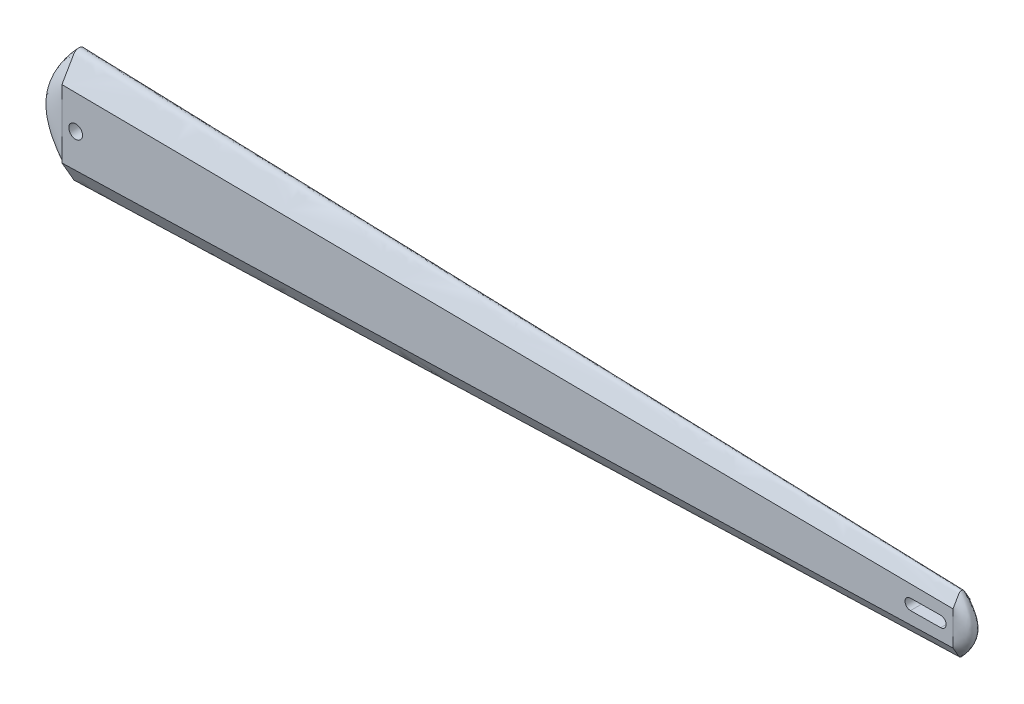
ISO-10303-21;
HEADER;
FILE_DESCRIPTION(('STEP AP214'),'2;1');
FILE_NAME('part.step','',(''),(''),'','','');
FILE_SCHEMA(('AUTOMOTIVE_DESIGN { 1 0 10303 214 1 1 1 1 }'));
ENDSEC;
DATA;
#1=APPLICATION_CONTEXT('core data for automotive mechanical design processes');
#2=APPLICATION_PROTOCOL_DEFINITION('international standard','automotive_design',2000,#1);
#3=PRODUCT_CONTEXT('',#1,'mechanical');
#4=PRODUCT('Part','Part','',(#3));
#5=PRODUCT_RELATED_PRODUCT_CATEGORY('part','',(#4));
#6=PRODUCT_DEFINITION_FORMATION('','',#4);
#7=PRODUCT_DEFINITION_CONTEXT('part definition',#1,'design');
#8=PRODUCT_DEFINITION('design','',#6,#7);
#9=PRODUCT_DEFINITION_SHAPE('','',#8);
#10=(LENGTH_UNIT() NAMED_UNIT(*) SI_UNIT(.MILLI.,.METRE.));
#11=(NAMED_UNIT(*) PLANE_ANGLE_UNIT() SI_UNIT($,.RADIAN.));
#12=(NAMED_UNIT(*) SI_UNIT($,.STERADIAN.) SOLID_ANGLE_UNIT());
#13=UNCERTAINTY_MEASURE_WITH_UNIT(LENGTH_MEASURE(1.E-05),#10,'distance_accuracy_value','');
#14=(GEOMETRIC_REPRESENTATION_CONTEXT(3) GLOBAL_UNCERTAINTY_ASSIGNED_CONTEXT((#13)) GLOBAL_UNIT_ASSIGNED_CONTEXT((#10,
#11,#12)) REPRESENTATION_CONTEXT('',''));
#15=CARTESIAN_POINT('',(0.,0.,0.));
#16=DIRECTION('',(0.,0.,1.));
#17=DIRECTION('',(1.,0.,0.));
#18=AXIS2_PLACEMENT_3D('',#15,#16,#17);
#19=CARTESIAN_POINT('',(650.,-12.75,6.25));
#20=CARTESIAN_POINT('',(649.749692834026,-14.79,5.09529946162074));
#21=CARTESIAN_POINT('',(649.664734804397,-16.9575,3.86843013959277));
#22=CARTESIAN_POINT('',(649.617653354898,-19.2525,2.5693920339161));
#23=CARTESIAN_POINT('',(649.612790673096,-19.635,2.35288568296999));
#24=CARTESIAN_POINT('',(649.608677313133,-20.0175,2.13637933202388));
#25=CARTESIAN_POINT('',(649.606342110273,-20.2725,1.99204176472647));
#26=CARTESIAN_POINT('',(649.604947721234,-20.4458365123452,1.89392936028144));
#27=CARTESIAN_POINT('',(649.60451837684,-20.5025001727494,1.85921765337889));
#28=CARTESIAN_POINT('',(649.603865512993,-20.592098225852,1.7986975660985));
#29=CARTESIAN_POINT('',(649.60340214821,-20.6592244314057,1.74972277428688));
#30=CARTESIAN_POINT('',(649.602886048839,-20.7360013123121,1.68804775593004));
#31=CARTESIAN_POINT('',(649.602403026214,-20.8120907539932,1.6220235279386));
#32=CARTESIAN_POINT('',(649.602010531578,-20.8754122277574,1.56146555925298));
#33=CARTESIAN_POINT('',(649.601832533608,-20.9582815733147,1.47567876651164));
#34=CARTESIAN_POINT('',(649.59951891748,-21.7190426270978,0.604404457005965));
#35=CARTESIAN_POINT('',(649.59966930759,-21.7190426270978,-0.604404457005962));
#36=CARTESIAN_POINT('',(649.601536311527,-20.9582815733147,-1.47567876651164));
#37=CARTESIAN_POINT('',(649.602010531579,-20.8754122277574,-1.56146555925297));
#38=CARTESIAN_POINT('',(649.602403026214,-20.8120907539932,-1.6220235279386));
#39=CARTESIAN_POINT('',(649.60288604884,-20.7360013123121,-1.68804775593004));
#40=CARTESIAN_POINT('',(649.60340214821,-20.6592244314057,-1.74972277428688));
#41=CARTESIAN_POINT('',(649.603865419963,-20.5920982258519,-1.7986975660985));
#42=CARTESIAN_POINT('',(649.604518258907,-20.5025001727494,-1.85921765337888));
#43=CARTESIAN_POINT('',(649.604948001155,-20.4459419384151,-1.89386727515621));
#44=CARTESIAN_POINT('',(649.606342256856,-20.2725,-1.99204176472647));
#45=CARTESIAN_POINT('',(649.608677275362,-20.0175,-2.13637933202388));
#46=CARTESIAN_POINT('',(649.612790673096,-19.635,-2.35288568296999));
#47=CARTESIAN_POINT('',(649.617653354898,-19.2525,-2.56939203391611));
#48=CARTESIAN_POINT('',(649.664734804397,-16.9575,-3.86843013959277));
#49=CARTESIAN_POINT('',(649.749692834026,-14.79,-5.09529946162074));
#50=CARTESIAN_POINT('',(650.,-12.75,-6.25));
#51=CARTESIAN_POINT('',(650.,-12.6666666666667,6.25));
#52=CARTESIAN_POINT('',(649.833128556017,-14.6933333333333,5.09529946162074));
#53=CARTESIAN_POINT('',(649.776489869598,-16.8466666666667,3.86843013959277));
#54=CARTESIAN_POINT('',(649.745102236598,-19.1266666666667,2.5693920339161));
#55=CARTESIAN_POINT('',(649.741860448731,-19.5066666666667,2.35288568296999));
#56=CARTESIAN_POINT('',(649.739118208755,-19.8866666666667,2.13637933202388));
#57=CARTESIAN_POINT('',(649.737561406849,-20.14,1.99204176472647));
#58=CARTESIAN_POINT('',(649.736631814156,-20.3122032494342,1.89392915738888));
#59=CARTESIAN_POINT('',(649.73634558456,-20.3684969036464,1.85921765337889));
#60=CARTESIAN_POINT('',(649.735910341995,-20.4575093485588,1.7986975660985));
#61=CARTESIAN_POINT('',(649.73560143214,-20.5241968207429,1.74972277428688));
#62=CARTESIAN_POINT('',(649.735257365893,-20.6004718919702,1.68804775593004));
#63=CARTESIAN_POINT('',(649.734935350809,-20.676064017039,1.6220235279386));
#64=CARTESIAN_POINT('',(649.734673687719,-20.7389716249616,1.56146555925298));
#65=CARTESIAN_POINT('',(649.734555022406,-20.8212993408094,1.47567876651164));
#66=CARTESIAN_POINT('',(649.733012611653,-21.5770881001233,0.604404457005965));
#67=CARTESIAN_POINT('',(649.733112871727,-21.5770881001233,-0.604404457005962));
#68=CARTESIAN_POINT('',(649.734357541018,-20.8212993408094,-1.47567876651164));
#69=CARTESIAN_POINT('',(649.734673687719,-20.7389716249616,-1.56146555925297));
#70=CARTESIAN_POINT('',(649.734935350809,-20.676064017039,-1.6220235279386));
#71=CARTESIAN_POINT('',(649.735257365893,-20.6004718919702,-1.68804775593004));
#72=CARTESIAN_POINT('',(649.73560143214,-20.5241968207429,-1.74972277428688));
#73=CARTESIAN_POINT('',(649.735910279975,-20.4575093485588,-1.7986975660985));
#74=CARTESIAN_POINT('',(649.736345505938,-20.3684969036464,-1.85921765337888));
#75=CARTESIAN_POINT('',(649.73663200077,-20.3123086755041,-1.89386747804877));
#76=CARTESIAN_POINT('',(649.737561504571,-20.14,-1.99204176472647));
#77=CARTESIAN_POINT('',(649.739118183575,-19.8866666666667,-2.13637933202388));
#78=CARTESIAN_POINT('',(649.741860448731,-19.5066666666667,-2.35288568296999));
#79=CARTESIAN_POINT('',(649.745102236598,-19.1266666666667,-2.56939203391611));
#80=CARTESIAN_POINT('',(649.776489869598,-16.8466666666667,-3.86843013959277));
#81=CARTESIAN_POINT('',(649.833128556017,-14.6933333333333,-5.09529946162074));
#82=CARTESIAN_POINT('',(650.,-12.6666666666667,-6.25));
#83=CARTESIAN_POINT('',(650.,-12.5833333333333,6.25));
#84=CARTESIAN_POINT('',(649.916564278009,-14.5966666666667,5.09529946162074));
#85=CARTESIAN_POINT('',(649.888244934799,-16.7358333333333,3.86843013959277));
#86=CARTESIAN_POINT('',(649.872551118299,-19.0008333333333,2.5693920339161));
#87=CARTESIAN_POINT('',(649.870930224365,-19.3783333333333,2.35288568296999));
#88=CARTESIAN_POINT('',(649.869559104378,-19.7558333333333,2.13637933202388));
#89=CARTESIAN_POINT('',(649.868780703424,-20.0075,1.99204176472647));
#90=CARTESIAN_POINT('',(649.868315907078,-20.1785699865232,1.89392895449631));
#91=CARTESIAN_POINT('',(649.86817279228,-20.2344936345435,1.85921765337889));
#92=CARTESIAN_POINT('',(649.867955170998,-20.3229204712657,1.7986975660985));
#93=CARTESIAN_POINT('',(649.86780071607,-20.3891692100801,1.74972277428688));
#94=CARTESIAN_POINT('',(649.867628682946,-20.4649424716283,1.68804775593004));
#95=CARTESIAN_POINT('',(649.867467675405,-20.5400372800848,1.6220235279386));
#96=CARTESIAN_POINT('',(649.867336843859,-20.6025310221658,1.56146555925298));
#97=CARTESIAN_POINT('',(649.867277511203,-20.6843171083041,1.47567876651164));
#98=CARTESIAN_POINT('',(649.866506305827,-21.4351335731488,0.604404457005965));
#99=CARTESIAN_POINT('',(649.866556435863,-21.4351335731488,-0.604404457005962));
#100=CARTESIAN_POINT('',(649.867178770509,-20.684317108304,-1.47567876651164));
#101=CARTESIAN_POINT('',(649.86733684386,-20.6025310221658,-1.56146555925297));
#102=CARTESIAN_POINT('',(649.867467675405,-20.5400372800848,-1.6220235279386));
#103=CARTESIAN_POINT('',(649.867628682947,-20.4649424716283,-1.68804775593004));
#104=CARTESIAN_POINT('',(649.86780071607,-20.3891692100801,-1.74972277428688));
#105=CARTESIAN_POINT('',(649.867955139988,-20.3229204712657,-1.7986975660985));
#106=CARTESIAN_POINT('',(649.868172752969,-20.2344936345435,-1.85921765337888));
#107=CARTESIAN_POINT('',(649.868316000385,-20.1786754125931,-1.89386768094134));
#108=CARTESIAN_POINT('',(649.868780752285,-20.0075,-1.99204176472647));
#109=CARTESIAN_POINT('',(649.869559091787,-19.7558333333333,-2.13637933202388));
#110=CARTESIAN_POINT('',(649.870930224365,-19.3783333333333,-2.35288568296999));
#111=CARTESIAN_POINT('',(649.872551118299,-19.0008333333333,-2.56939203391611));
#112=CARTESIAN_POINT('',(649.888244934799,-16.7358333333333,-3.86843013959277));
#113=CARTESIAN_POINT('',(649.916564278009,-14.5966666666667,-5.09529946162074));
#114=CARTESIAN_POINT('',(650.,-12.5833333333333,-6.25));
#115=CARTESIAN_POINT('',(650.,-12.5,6.25));
#116=CARTESIAN_POINT('',(650.,-14.5,5.09529946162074));
#117=CARTESIAN_POINT('',(650.,-16.625,3.86843013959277));
#118=CARTESIAN_POINT('',(650.,-18.875,2.5693920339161));
#119=CARTESIAN_POINT('',(650.,-19.25,2.35288568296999));
#120=CARTESIAN_POINT('',(650.,-19.625,2.13637933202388));
#121=CARTESIAN_POINT('',(650.,-19.875,1.99204176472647));
#122=CARTESIAN_POINT('',(650.,-20.0449367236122,1.89392875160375));
#123=CARTESIAN_POINT('',(650.,-20.1004903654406,1.85921765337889));
#124=CARTESIAN_POINT('',(650.,-20.1883315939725,1.7986975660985));
#125=CARTESIAN_POINT('',(650.,-20.2541415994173,1.74972277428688));
#126=CARTESIAN_POINT('',(650.,-20.3294130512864,1.68804775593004));
#127=CARTESIAN_POINT('',(650.,-20.4040105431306,1.6220235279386));
#128=CARTESIAN_POINT('',(650.,-20.46609041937,1.56146555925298));
#129=CARTESIAN_POINT('',(650.,-20.5473348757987,1.47567876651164));
#130=CARTESIAN_POINT('',(650.,-21.2931790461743,0.604404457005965));
#131=CARTESIAN_POINT('',(650.,-21.2931790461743,-0.604404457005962));
#132=CARTESIAN_POINT('',(650.,-20.5473348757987,-1.47567876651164));
#133=CARTESIAN_POINT('',(650.,-20.46609041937,-1.56146555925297));
#134=CARTESIAN_POINT('',(650.,-20.4040105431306,-1.6220235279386));
#135=CARTESIAN_POINT('',(650.,-20.3294130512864,-1.68804775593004));
#136=CARTESIAN_POINT('',(650.,-20.2541415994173,-1.74972277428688));
#137=CARTESIAN_POINT('',(650.,-20.1883315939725,-1.7986975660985));
#138=CARTESIAN_POINT('',(650.,-20.1004903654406,-1.85921765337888));
#139=CARTESIAN_POINT('',(650.,-20.0450421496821,-1.89386788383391));
#140=CARTESIAN_POINT('',(650.,-19.875,-1.99204176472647));
#141=CARTESIAN_POINT('',(650.,-19.625,-2.13637933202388));
#142=CARTESIAN_POINT('',(650.,-19.25,-2.35288568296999));
#143=CARTESIAN_POINT('',(650.,-18.875,-2.56939203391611));
#144=CARTESIAN_POINT('',(650.,-16.625,-3.86843013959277));
#145=CARTESIAN_POINT('',(650.,-14.5,-5.09529946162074));
#146=CARTESIAN_POINT('',(650.,-12.5,-6.25));
#147=CARTESIAN_POINT('',(650.,-4.16666666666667,6.25));
#148=CARTESIAN_POINT('',(658.343572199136,-4.83333333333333,5.09529946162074));
#149=CARTESIAN_POINT('',(661.175506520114,-5.54166666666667,3.86843013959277));
#150=CARTESIAN_POINT('',(662.744888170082,-6.29166666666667,2.5693920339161));
#151=CARTESIAN_POINT('',(662.906977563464,-6.41666666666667,2.35288568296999));
#152=CARTESIAN_POINT('',(663.04408956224,-6.54166666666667,2.13637933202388));
#153=CARTESIAN_POINT('',(663.121929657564,-6.62500000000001,1.99204176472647));
#154=CARTESIAN_POINT('',(663.168409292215,-6.68161043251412,1.89390846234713));
#155=CARTESIAN_POINT('',(663.182720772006,-6.70016345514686,1.85921765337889));
#156=CARTESIAN_POINT('',(663.204482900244,-6.72944386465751,1.7986975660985));
#157=CARTESIAN_POINT('',(663.21992839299,-6.75138053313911,1.74972277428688));
#158=CARTESIAN_POINT('',(663.237131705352,-6.77647101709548,1.68804775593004));
#159=CARTESIAN_POINT('',(663.253232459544,-6.8013368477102,1.6220235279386));
#160=CARTESIAN_POINT('',(663.266315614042,-6.82203013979,1.56146555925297));
#161=CARTESIAN_POINT('',(663.272248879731,-6.84911162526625,1.47567876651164));
#162=CARTESIAN_POINT('',(663.349369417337,-7.09772634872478,0.604404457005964));
#163=CARTESIAN_POINT('',(663.344356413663,-7.09772634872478,-0.604404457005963));
#164=CARTESIAN_POINT('',(663.282122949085,-6.84911162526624,-1.47567876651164));
#165=CARTESIAN_POINT('',(663.266315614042,-6.82203013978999,-1.56146555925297));
#166=CARTESIAN_POINT('',(663.253232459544,-6.80133684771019,-1.6220235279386));
#167=CARTESIAN_POINT('',(663.237131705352,-6.77647101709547,-1.68804775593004));
#168=CARTESIAN_POINT('',(663.21992839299,-6.75138053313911,-1.74972277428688));
#169=CARTESIAN_POINT('',(663.204486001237,-6.72944386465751,-1.7986975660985));
#170=CARTESIAN_POINT('',(663.182724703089,-6.70016345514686,-1.85921765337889));
#171=CARTESIAN_POINT('',(663.168399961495,-6.68171585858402,-1.89388817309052));
#172=CARTESIAN_POINT('',(663.121924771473,-6.62500000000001,-1.99204176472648));
#173=CARTESIAN_POINT('',(663.044090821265,-6.54166666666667,-2.13637933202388));
#174=CARTESIAN_POINT('',(662.906977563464,-6.41666666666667,-2.35288568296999));
#175=CARTESIAN_POINT('',(662.744888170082,-6.29166666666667,-2.56939203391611));
#176=CARTESIAN_POINT('',(661.175506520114,-5.54166666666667,-3.86843013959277));
#177=CARTESIAN_POINT('',(658.343572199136,-4.83333333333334,-5.09529946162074));
#178=CARTESIAN_POINT('',(650.,-4.16666666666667,-6.25));
#179=CARTESIAN_POINT('',(650.,4.16666666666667,6.25));
#180=CARTESIAN_POINT('',(658.343572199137,4.83333333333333,5.09529946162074));
#181=CARTESIAN_POINT('',(661.175506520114,5.54166666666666,3.86843013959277));
#182=CARTESIAN_POINT('',(662.744888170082,6.29166666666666,2.56939203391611));
#183=CARTESIAN_POINT('',(662.906977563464,6.41666666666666,2.35288568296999));
#184=CARTESIAN_POINT('',(663.044092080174,6.54166666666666,2.13637933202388));
#185=CARTESIAN_POINT('',(663.12197661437,6.62499999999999,1.99204176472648));
#186=CARTESIAN_POINT('',(663.168399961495,6.68171585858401,1.89388817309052));
#187=CARTESIAN_POINT('',(663.182623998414,6.70016345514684,1.85921765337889));
#188=CARTESIAN_POINT('',(663.204526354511,6.72944386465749,1.7986975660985));
#189=CARTESIAN_POINT('',(663.219965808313,6.7513805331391,1.74972277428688));
#190=CARTESIAN_POINT('',(663.237171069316,6.77647101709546,1.68804775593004));
#191=CARTESIAN_POINT('',(663.253267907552,6.80133684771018,1.6220235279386));
#192=CARTESIAN_POINT('',(663.266356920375,6.82203013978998,1.56146555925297));
#193=CARTESIAN_POINT('',(663.282122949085,6.84911162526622,1.47567876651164));
#194=CARTESIAN_POINT('',(663.344356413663,7.09772634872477,0.604404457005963));
#195=CARTESIAN_POINT('',(663.355866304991,7.09772634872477,-0.604404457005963));
#196=CARTESIAN_POINT('',(663.277276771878,6.84911162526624,-1.47567876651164));
#197=CARTESIAN_POINT('',(663.266401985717,6.82203013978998,-1.56146555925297));
#198=CARTESIAN_POINT('',(663.253341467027,6.80133684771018,-1.6220235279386));
#199=CARTESIAN_POINT('',(663.237224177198,6.77647101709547,-1.68804775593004));
#200=CARTESIAN_POINT('',(663.220061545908,6.7513805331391,-1.74972277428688));
#201=CARTESIAN_POINT('',(663.204598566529,6.72944386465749,-1.7986975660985));
#202=CARTESIAN_POINT('',(663.182832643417,6.70016345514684,-1.85921765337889));
#203=CARTESIAN_POINT('',(663.16856460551,6.68161043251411,-1.89390846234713));
#204=CARTESIAN_POINT('',(663.121954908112,6.62499999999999,-1.99204176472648));
#205=CARTESIAN_POINT('',(663.044080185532,6.54166666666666,-2.13637933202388));
#206=CARTESIAN_POINT('',(662.906977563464,6.41666666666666,-2.35288568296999));
#207=CARTESIAN_POINT('',(662.744888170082,6.29166666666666,-2.56939203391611));
#208=CARTESIAN_POINT('',(661.175506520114,5.54166666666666,-3.86843013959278));
#209=CARTESIAN_POINT('',(658.343572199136,4.83333333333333,-5.09529946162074));
#210=CARTESIAN_POINT('',(650.,4.16666666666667,-6.25));
#211=CARTESIAN_POINT('',(650.,12.5,6.25));
#212=CARTESIAN_POINT('',(650.,14.5,5.09529946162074));
#213=CARTESIAN_POINT('',(650.,16.625,3.86843013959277));
#214=CARTESIAN_POINT('',(650.,18.875,2.56939203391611));
#215=CARTESIAN_POINT('',(650.,19.25,2.35288568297));
#216=CARTESIAN_POINT('',(650.,19.625,2.13637933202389));
#217=CARTESIAN_POINT('',(650.,19.875,1.99204176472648));
#218=CARTESIAN_POINT('',(650.,20.0450421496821,1.89386788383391));
#219=CARTESIAN_POINT('',(650.,20.1004903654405,1.85921765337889));
#220=CARTESIAN_POINT('',(650.,20.1883315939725,1.7986975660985));
#221=CARTESIAN_POINT('',(650.,20.2541415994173,1.74972277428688));
#222=CARTESIAN_POINT('',(650.,20.3294130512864,1.68804775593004));
#223=CARTESIAN_POINT('',(650.,20.4040105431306,1.6220235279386));
#224=CARTESIAN_POINT('',(650.,20.46609041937,1.56146555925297));
#225=CARTESIAN_POINT('',(650.,20.5473348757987,1.47567876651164));
#226=CARTESIAN_POINT('',(650.,21.2931790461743,0.604404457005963));
#227=CARTESIAN_POINT('',(650.,21.2931790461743,-0.604404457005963));
#228=CARTESIAN_POINT('',(650.,20.5473348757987,-1.47567876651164));
#229=CARTESIAN_POINT('',(650.,20.46609041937,-1.56146555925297));
#230=CARTESIAN_POINT('',(650.,20.4040105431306,-1.6220235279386));
#231=CARTESIAN_POINT('',(650.,20.3294130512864,-1.68804775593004));
#232=CARTESIAN_POINT('',(650.,20.2541415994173,-1.74972277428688));
#233=CARTESIAN_POINT('',(650.,20.1883315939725,-1.7986975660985));
#234=CARTESIAN_POINT('',(650.,20.1004903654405,-1.85921765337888));
#235=CARTESIAN_POINT('',(650.,20.0449367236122,-1.89392875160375));
#236=CARTESIAN_POINT('',(650.,19.875,-1.99204176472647));
#237=CARTESIAN_POINT('',(650.,19.625,-2.13637933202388));
#238=CARTESIAN_POINT('',(650.,19.25,-2.35288568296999));
#239=CARTESIAN_POINT('',(650.,18.875,-2.56939203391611));
#240=CARTESIAN_POINT('',(650.,16.625,-3.86843013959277));
#241=CARTESIAN_POINT('',(650.,14.5,-5.09529946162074));
#242=CARTESIAN_POINT('',(650.,12.5,-6.25));
#243=CARTESIAN_POINT('',(650.,12.5833333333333,6.25));
#244=CARTESIAN_POINT('',(649.916564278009,14.5966666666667,5.09529946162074));
#245=CARTESIAN_POINT('',(649.888244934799,16.7358333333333,3.86843013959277));
#246=CARTESIAN_POINT('',(649.872551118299,19.0008333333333,2.56939203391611));
#247=CARTESIAN_POINT('',(649.870930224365,19.3783333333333,2.35288568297));
#248=CARTESIAN_POINT('',(649.869559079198,19.7558333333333,2.13637933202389));
#249=CARTESIAN_POINT('',(649.868780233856,20.0075,1.99204176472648));
#250=CARTESIAN_POINT('',(649.868316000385,20.1786754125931,1.89386768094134));
#251=CARTESIAN_POINT('',(649.868173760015,20.2344936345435,1.85921765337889));
#252=CARTESIAN_POINT('',(649.867954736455,20.3229204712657,1.7986975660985));
#253=CARTESIAN_POINT('',(649.867800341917,20.3891692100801,1.74972277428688));
#254=CARTESIAN_POINT('',(649.867628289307,20.4649424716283,1.68804775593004));
#255=CARTESIAN_POINT('',(649.867467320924,20.5400372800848,1.6220235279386));
#256=CARTESIAN_POINT('',(649.867336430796,20.6025310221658,1.56146555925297));
#257=CARTESIAN_POINT('',(649.867178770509,20.684317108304,1.47567876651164));
#258=CARTESIAN_POINT('',(649.866556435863,21.4351335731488,0.604404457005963));
#259=CARTESIAN_POINT('',(649.86644133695,21.4351335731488,-0.604404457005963));
#260=CARTESIAN_POINT('',(649.867227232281,20.684317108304,-1.47567876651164));
#261=CARTESIAN_POINT('',(649.867335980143,20.6025310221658,-1.56146555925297));
#262=CARTESIAN_POINT('',(649.86746658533,20.5400372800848,-1.6220235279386));
#263=CARTESIAN_POINT('',(649.867627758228,20.4649424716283,-1.68804775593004));
#264=CARTESIAN_POINT('',(649.867799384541,20.3891692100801,-1.74972277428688));
#265=CARTESIAN_POINT('',(649.867954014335,20.3229204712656,-1.7986975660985));
#266=CARTESIAN_POINT('',(649.868171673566,20.2344936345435,-1.85921765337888));
#267=CARTESIAN_POINT('',(649.868314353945,20.1785699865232,-1.89392895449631));
#268=CARTESIAN_POINT('',(649.868780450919,20.0075,-1.99204176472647));
#269=CARTESIAN_POINT('',(649.869559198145,19.7558333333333,-2.13637933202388));
#270=CARTESIAN_POINT('',(649.870930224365,19.3783333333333,-2.35288568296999));
#271=CARTESIAN_POINT('',(649.872551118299,19.0008333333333,-2.56939203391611));
#272=CARTESIAN_POINT('',(649.888244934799,16.7358333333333,-3.86843013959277));
#273=CARTESIAN_POINT('',(649.916564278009,14.5966666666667,-5.09529946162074));
#274=CARTESIAN_POINT('',(650.,12.5833333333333,-6.25));
#275=CARTESIAN_POINT('',(650.,12.6666666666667,6.25));
#276=CARTESIAN_POINT('',(649.833128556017,14.6933333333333,5.09529946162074));
#277=CARTESIAN_POINT('',(649.776489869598,16.8466666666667,3.86843013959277));
#278=CARTESIAN_POINT('',(649.745102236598,19.1266666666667,2.56939203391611));
#279=CARTESIAN_POINT('',(649.741860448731,19.5066666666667,2.35288568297));
#280=CARTESIAN_POINT('',(649.739118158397,19.8866666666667,2.13637933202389));
#281=CARTESIAN_POINT('',(649.737560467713,20.14,1.99204176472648));
#282=CARTESIAN_POINT('',(649.73663200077,20.3123086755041,1.89386747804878));
#283=CARTESIAN_POINT('',(649.736347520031,20.3684969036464,1.85921765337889));
#284=CARTESIAN_POINT('',(649.735909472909,20.4575093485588,1.7986975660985));
#285=CARTESIAN_POINT('',(649.735600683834,20.5241968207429,1.74972277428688));
#286=CARTESIAN_POINT('',(649.735256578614,20.6004718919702,1.68804775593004));
#287=CARTESIAN_POINT('',(649.734934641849,20.676064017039,1.6220235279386));
#288=CARTESIAN_POINT('',(649.734672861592,20.7389716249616,1.56146555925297));
#289=CARTESIAN_POINT('',(649.734357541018,20.8212993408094,1.47567876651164));
#290=CARTESIAN_POINT('',(649.733112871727,21.5770881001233,0.604404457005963));
#291=CARTESIAN_POINT('',(649.7328826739,21.5770881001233,-0.604404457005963));
#292=CARTESIAN_POINT('',(649.734454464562,20.8212993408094,-1.47567876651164));
#293=CARTESIAN_POINT('',(649.734671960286,20.7389716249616,-1.56146555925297));
#294=CARTESIAN_POINT('',(649.734933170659,20.676064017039,-1.6220235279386));
#295=CARTESIAN_POINT('',(649.735255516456,20.6004718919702,-1.68804775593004));
#296=CARTESIAN_POINT('',(649.735598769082,20.5241968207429,-1.74972277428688));
#297=CARTESIAN_POINT('',(649.735908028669,20.4575093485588,-1.7986975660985));
#298=CARTESIAN_POINT('',(649.736343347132,20.3684969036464,-1.85921765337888));
#299=CARTESIAN_POINT('',(649.73662870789,20.3122032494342,-1.89392915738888));
#300=CARTESIAN_POINT('',(649.737560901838,20.14,-1.99204176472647));
#301=CARTESIAN_POINT('',(649.739118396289,19.8866666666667,-2.13637933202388));
#302=CARTESIAN_POINT('',(649.741860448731,19.5066666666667,-2.35288568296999));
#303=CARTESIAN_POINT('',(649.745102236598,19.1266666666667,-2.56939203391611));
#304=CARTESIAN_POINT('',(649.776489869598,16.8466666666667,-3.86843013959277));
#305=CARTESIAN_POINT('',(649.833128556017,14.6933333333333,-5.09529946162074));
#306=CARTESIAN_POINT('',(650.,12.6666666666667,-6.25));
#307=CARTESIAN_POINT('',(650.,12.75,6.25));
#308=CARTESIAN_POINT('',(649.749692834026,14.79,5.09529946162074));
#309=CARTESIAN_POINT('',(649.664734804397,16.9575,3.86843013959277));
#310=CARTESIAN_POINT('',(649.617653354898,19.2525,2.56939203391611));
#311=CARTESIAN_POINT('',(649.612790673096,19.635,2.35288568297));
#312=CARTESIAN_POINT('',(649.608677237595,20.0175,2.13637933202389));
#313=CARTESIAN_POINT('',(649.606340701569,20.2725,1.99204176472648));
#314=CARTESIAN_POINT('',(649.604948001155,20.4459419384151,1.89386727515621));
#315=CARTESIAN_POINT('',(649.604521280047,20.5025001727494,1.85921765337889));
#316=CARTESIAN_POINT('',(649.603864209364,20.5920982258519,1.7986975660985));
#317=CARTESIAN_POINT('',(649.603401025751,20.6592244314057,1.74972277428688));
#318=CARTESIAN_POINT('',(649.602884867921,20.7360013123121,1.68804775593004));
#319=CARTESIAN_POINT('',(649.602401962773,20.8120907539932,1.6220235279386));
#320=CARTESIAN_POINT('',(649.602009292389,20.8754122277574,1.56146555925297));
#321=CARTESIAN_POINT('',(649.601536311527,20.9582815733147,1.47567876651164));
#322=CARTESIAN_POINT('',(649.59966930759,21.7190426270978,0.604404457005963));
#323=CARTESIAN_POINT('',(649.59932401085,21.7190426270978,-0.604404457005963));
#324=CARTESIAN_POINT('',(649.601681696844,20.9582815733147,-1.47567876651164));
#325=CARTESIAN_POINT('',(649.602007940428,20.8754122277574,-1.56146555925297));
#326=CARTESIAN_POINT('',(649.602399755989,20.8120907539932,-1.6220235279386));
#327=CARTESIAN_POINT('',(649.602883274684,20.7360013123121,-1.68804775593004));
#328=CARTESIAN_POINT('',(649.603398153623,20.6592244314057,-1.74972277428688));
#329=CARTESIAN_POINT('',(649.603862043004,20.5920982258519,-1.7986975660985));
#330=CARTESIAN_POINT('',(649.604515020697,20.5025001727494,-1.85921765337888));
#331=CARTESIAN_POINT('',(649.604943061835,20.4458365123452,-1.89392936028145));
#332=CARTESIAN_POINT('',(649.606341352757,20.2725,-1.99204176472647));
#333=CARTESIAN_POINT('',(649.608677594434,20.0175,-2.13637933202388));
#334=CARTESIAN_POINT('',(649.612790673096,19.635,-2.35288568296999));
#335=CARTESIAN_POINT('',(649.617653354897,19.2525,-2.56939203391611));
#336=CARTESIAN_POINT('',(649.664734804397,16.9575,-3.86843013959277));
#337=CARTESIAN_POINT('',(649.749692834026,14.79,-5.09529946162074));
#338=CARTESIAN_POINT('',(650.,12.75,-6.25));
#339=B_SPLINE_SURFACE_WITH_KNOTS('',3,3,((#19,#20,#21,#22,#23,#24,#25,#26,#27,#28,#29,#30,#31,
#32,#33,#34,#35,#36,#37,#38,#39,#40,#41,#42,#43,#44,#45,#46,#47,#48,#49,#50),(#51,#52,#53,#54,
#55,#56,#57,#58,#59,#60,#61,#62,#63,#64,#65,#66,#67,#68,#69,#70,#71,#72,#73,#74,#75,#76,#77,#78,
#79,#80,#81,#82),(#83,#84,#85,#86,#87,#88,#89,#90,#91,#92,#93,#94,#95,#96,#97,#98,#99,#100,#101,
#102,#103,#104,#105,#106,#107,#108,#109,#110,#111,#112,#113,#114),(#115,#116,#117,#118,#119,
#120,#121,#122,#123,#124,#125,#126,#127,#128,#129,#130,#131,#132,#133,#134,#135,#136,#137,#138,
#139,#140,#141,#142,#143,#144,#145,#146),(#147,#148,#149,#150,#151,#152,#153,#154,#155,#156,
#157,#158,#159,#160,#161,#162,#163,#164,#165,#166,#167,#168,#169,#170,#171,#172,#173,#174,#175,
#176,#177,#178),(#179,#180,#181,#182,#183,#184,#185,#186,#187,#188,#189,#190,#191,#192,#193,
#194,#195,#196,#197,#198,#199,#200,#201,#202,#203,#204,#205,#206,#207,#208,#209,#210),(#211,
#212,#213,#214,#215,#216,#217,#218,#219,#220,#221,#222,#223,#224,#225,#226,#227,#228,#229,#230,
#231,#232,#233,#234,#235,#236,#237,#238,#239,#240,#241,#242),(#243,#244,#245,#246,#247,#248,
#249,#250,#251,#252,#253,#254,#255,#256,#257,#258,#259,#260,#261,#262,#263,#264,#265,#266,#267,
#268,#269,#270,#271,#272,#273,#274),(#275,#276,#277,#278,#279,#280,#281,#282,#283,#284,#285,
#286,#287,#288,#289,#290,#291,#292,#293,#294,#295,#296,#297,#298,#299,#300,#301,#302,#303,#304,
#305,#306),(#307,#308,#309,#310,#311,#312,#313,#314,#315,#316,#317,#318,#319,#320,#321,#322,
#323,#324,#325,#326,#327,#328,#329,#330,#331,#332,#333,#334,#335,#336,#337,#338)),.UNSPECIFIED.,
.F.,.F.,.F.,(4,3,3,4),(4,1,1,1,1,2,1,1,1,1,1,1,1,1,1,1,1,1,1,1,1,1,2,1,1,1,1,4),(-0.01,0.,1.,
1.01),(0.,0.327415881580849,0.347879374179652,0.368342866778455,0.388806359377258,
0.409269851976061,0.416528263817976,0.418342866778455,0.423786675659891,0.427415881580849,
0.431045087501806,0.436488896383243,0.438303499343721,0.445561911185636,0.554438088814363,
0.561696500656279,0.563511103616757,0.568954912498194,0.572584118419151,0.576213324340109,
0.581657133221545,0.583471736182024,0.590730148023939,0.611193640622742,0.631657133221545,
0.652120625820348,0.672584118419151,1.),.UNSPECIFIED.);
#340=CARTESIAN_POINT('',(650.,12.5,6.25));
#341=CARTESIAN_POINT('',(650.,12.2939857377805,6.25));
#342=CARTESIAN_POINT('',(650.,12.0879714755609,6.25));
#343=CARTESIAN_POINT('',(650.,11.0579001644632,6.25));
#344=CARTESIAN_POINT('',(650.,10.2338431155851,6.25));
#345=CARTESIAN_POINT('',(650.,6.11355787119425,6.25));
#346=CARTESIAN_POINT('',(650.,2.8173296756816,6.25));
#347=CARTESIAN_POINT('',(650.,-4.48593234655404,6.25));
#348=CARTESIAN_POINT('',(650.,-8.49296617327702,6.25));
#349=CARTESIAN_POINT('',(650.,-12.5,6.25));
#350=B_SPLINE_CURVE_WITH_KNOTS('',3,(#340,#341,#342,#343,#344,#345,#346,#347,#348,#349),
.UNSPECIFIED.,.F.,.F.,(4,2,2,2,4),(0.,0.618042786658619,3.09021393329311,12.9788985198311,25.),.UNSPECIFIED.);
#351=CARTESIAN_POINT('',(650.,12.5,6.25));
#352=VERTEX_POINT('',#351);
#353=CARTESIAN_POINT('',(650.,-12.5,6.25));
#354=VERTEX_POINT('',#353);
#355=EDGE_CURVE('E355',#352,#354,#350,.T.);
#356=CARTESIAN_POINT('',(650.,-12.5,6.25));
#357=CARTESIAN_POINT('',(650.,-12.5892060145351,6.19849688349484));
#358=CARTESIAN_POINT('',(650.,-12.6784120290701,6.14699376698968));
#359=CARTESIAN_POINT('',(650.,-12.8568256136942,6.04398663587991));
#360=CARTESIAN_POINT('',(650.,-12.9460331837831,5.9924826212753));
#361=CARTESIAN_POINT('',(650.,-13.3920762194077,5.73495955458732));
#362=CARTESIAN_POINT('',(650.,-13.7489116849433,5.52894050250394));
#363=CARTESIAN_POINT('',(650.,-14.4625660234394,5.11691197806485));
#364=CARTESIAN_POINT('',(650.,-14.8193848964,4.91090250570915));
#365=CARTESIAN_POINT('',(650.,-15.3546020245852,4.60189475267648));
#366=CARTESIAN_POINT('',(650.,-15.5330002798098,4.49889647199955));
#367=CARTESIAN_POINT('',(650.,-15.8897942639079,4.29290136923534));
#368=CARTESIAN_POINT('',(650.,-16.0681899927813,4.18990454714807));
#369=CARTESIAN_POINT('',(650.,-16.4250111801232,3.98389373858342));
#370=CARTESIAN_POINT('',(650.,-16.6034366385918,3.88087975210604));
#371=CARTESIAN_POINT('',(650.,-16.9602969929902,3.67484633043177));
#372=CARTESIAN_POINT('',(650.,-17.1387318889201,3.57182689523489));
#373=CARTESIAN_POINT('',(650.,-17.4117713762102,3.41418747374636));
#374=CARTESIAN_POINT('',(650.,-17.5063759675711,3.35956748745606));
#375=CARTESIAN_POINT('',(650.,-17.6955798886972,3.25033055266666));
#376=CARTESIAN_POINT('',(650.000000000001,-17.7901792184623,3.19571360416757));
#377=CARTESIAN_POINT('',(649.999999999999,-17.9793601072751,3.08648996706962));
#378=CARTESIAN_POINT('',(649.999999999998,-18.0739416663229,3.03188327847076));
#379=CARTESIAN_POINT('',(650.000000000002,-18.2630236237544,2.92271675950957));
#380=CARTESIAN_POINT('',(650.000000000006,-18.3575240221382,2.86815692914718));
#381=CARTESIAN_POINT('',(649.999999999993,-18.5465425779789,2.75902701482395));
#382=CARTESIAN_POINT('',(649.999999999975,-18.6410607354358,2.70445693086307));
#383=CARTESIAN_POINT('',(650.000000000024,-18.830162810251,2.59527879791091));
#384=CARTESIAN_POINT('',(650.00000000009,-18.9247467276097,2.54067074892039));
#385=CARTESIAN_POINT('',(649.999999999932,-19.0907349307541,2.44483741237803));
#386=CARTESIAN_POINT('',(649.999999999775,-19.162139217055,2.40361212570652));
#387=CARTESIAN_POINT('',(650.000000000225,-19.3049360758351,2.32116832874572));
#388=CARTESIAN_POINT('',(650.000000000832,-19.3763286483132,2.27994981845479));
#389=CARTESIAN_POINT('',(649.999999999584,-19.4833742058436,2.21814701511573));
#390=CARTESIAN_POINT('',(649.99999999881,-19.5190271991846,2.19756273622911));
#391=CARTESIAN_POINT('',(650.00000000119,-19.5903316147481,2.15639515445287));
#392=CARTESIAN_POINT('',(650.000000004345,-19.6259830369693,2.13581185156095));
#393=CARTESIAN_POINT('',(649.999999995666,-19.6972012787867,2.0946938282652));
#394=CARTESIAN_POINT('',(649.999999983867,-19.7327680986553,2.07415910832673));
#395=CARTESIAN_POINT('',(650.000000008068,-19.7861217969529,2.0433557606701));
#396=CARTESIAN_POINT('',(650.00000002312,-19.803908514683,2.03308685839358));
#397=CARTESIAN_POINT('',(649.99999997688,-19.8394810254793,2.01254824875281));
#398=CARTESIAN_POINT('',(649.999999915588,-19.8572668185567,2.00227854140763));
#399=CARTESIAN_POINT('',(650.000000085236,-19.8930106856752,1.98164478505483));
#400=CARTESIAN_POINT('',(650.000000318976,-19.9109687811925,1.9712807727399));
#401=CARTESIAN_POINT('',(649.999999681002,-19.9468777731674,1.950537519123));
#402=CARTESIAN_POINT('',(649.99999880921,-19.9648286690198,1.94015827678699));
#403=CARTESIAN_POINT('',(650.000000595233,-19.9917763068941,1.92463137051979));
#404=CARTESIAN_POINT('',(650.000001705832,-20.0007611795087,1.91946342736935));
#405=CARTESIAN_POINT('',(650.000008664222,-20.0186581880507,1.9090035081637));
#406=CARTESIAN_POINT('',(650.000014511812,-20.0275703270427,1.90371153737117));
#407=CARTESIAN_POINT('',(650.000033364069,-20.054189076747,1.88764621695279));
#408=CARTESIAN_POINT('',(650.000047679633,-20.0717808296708,1.87668187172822));
#409=CARTESIAN_POINT('',(650.000097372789,-20.1065543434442,1.85431903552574));
#410=CARTESIAN_POINT('',(650.000132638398,-20.1237377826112,1.84292315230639));
#411=CARTESIAN_POINT('',(650.000205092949,-20.1577804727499,1.81965254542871));
#412=CARTESIAN_POINT('',(650.000242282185,-20.1746396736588,1.80777774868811));
#413=CARTESIAN_POINT('',(650.000342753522,-20.2247214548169,1.77144687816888));
#414=CARTESIAN_POINT('',(650.000394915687,-20.2574397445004,1.74628977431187));
#415=CARTESIAN_POINT('',(650.000476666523,-20.3215852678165,1.69407866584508));
#416=CARTESIAN_POINT('',(650.000506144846,-20.3530054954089,1.66701607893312));
#417=CARTESIAN_POINT('',(650.000511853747,-20.4142957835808,1.61119455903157));
#418=CARTESIAN_POINT('',(650.000488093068,-20.4441660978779,1.58243590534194));
#419=CARTESIAN_POINT('',(650.000439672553,-20.4880117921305,1.53781759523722));
#420=CARTESIAN_POINT('',(650.000421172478,-20.502595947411,1.52255138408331));
#421=CARTESIAN_POINT('',(650.000320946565,-20.5313287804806,1.49161382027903));
#422=CARTESIAN_POINT('',(650.000239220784,-20.545477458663,1.47594246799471));
#423=CARTESIAN_POINT('',(650.000186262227,-20.5733258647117,1.44420121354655));
#424=CARTESIAN_POINT('',(650.000215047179,-20.5870255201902,1.42813124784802));
#425=CARTESIAN_POINT('',(650.000391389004,-20.613962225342,1.39560527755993));
#426=CARTESIAN_POINT('',(650.000538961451,-20.6271992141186,1.3791492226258));
#427=CARTESIAN_POINT('',(650.000750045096,-20.6401974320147,1.36250727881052));
#428=B_SPLINE_CURVE_WITH_KNOTS('',3,(#356,#357,#358,#359,#360,#361,#362,#363,#364,#365,#366,
#367,#368,#369,#370,#371,#372,#373,#374,#375,#376,#377,#378,#379,#380,#381,#382,#383,#384,#385,
#386,#387,#388,#389,#390,#391,#392,#393,#394,#395,#396,#397,#398,#399,#400,#401,#402,#403,#404,
#405,#406,#407,#408,#409,#410,#411,#412,#413,#414,#415,#416,#417,#418,#419,#420,#421,#422,#423,
#424,#425,#426,#427),.UNSPECIFIED.,.F.,.F.,(4,2,2,2,2,2,2,2,2,2,2,2,2,2,2,2,2,2,2,2,2,2,2,2,2,2,
2,2,2,2,2,2,2,2,2,4),(0.,0.309018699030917,0.618042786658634,1.85415709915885,3.09021393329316,
3.70820361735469,4.32618454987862,4.94426846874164,5.5623850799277,5.8901049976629,
6.21780668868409,6.54544682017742,6.87280580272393,7.20022630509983,7.52787460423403,
7.77522631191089,8.02253742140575,8.14604303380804,8.26954309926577,8.39275049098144,
8.45436508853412,8.51597851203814,8.57818096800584,8.64038786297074,8.67148286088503,
8.70257654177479,8.76475422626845,8.82660250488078,8.88846025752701,9.01220593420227,
9.13654983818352,9.26087332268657,9.32420516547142,9.38753695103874,9.45087889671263,
9.51422914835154),.UNSPECIFIED.);
#429=CARTESIAN_POINT('',(650.,-20.,1.91987298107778));
#430=VERTEX_POINT('',#429);
#431=EDGE_CURVE('E379',#354,#430,#428,.T.);
#432=CARTESIAN_POINT('',(650.,-19.126380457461,2.42425745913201));
#433=CARTESIAN_POINT('',(650.000000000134,-19.178816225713,2.39398364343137));
#434=CARTESIAN_POINT('',(650.000000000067,-19.2312520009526,2.36370983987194));
#435=CARTESIAN_POINT('',(649.999999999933,-19.3361671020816,2.30313708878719));
#436=CARTESIAN_POINT('',(649.999999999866,-19.3886464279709,2.27283814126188));
#437=CARTESIAN_POINT('',(650.000000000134,-19.4936270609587,2.21222752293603));
#438=CARTESIAN_POINT('',(650.000000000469,-19.5461283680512,2.1819158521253));
#439=CARTESIAN_POINT('',(649.999999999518,-19.6525007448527,2.12050180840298));
#440=CARTESIAN_POINT('',(649.99999999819,-19.7063718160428,2.08939943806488));
#441=CARTESIAN_POINT('',(650.000000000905,-19.7871671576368,2.04275200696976));
#442=CARTESIAN_POINT('',(650.000000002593,-19.8140915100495,2.02720708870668));
#443=CARTESIAN_POINT('',(649.999999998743,-19.8544799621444,2.00388911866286));
#444=CARTESIAN_POINT('',(649.999999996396,-19.8679439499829,1.99611587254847));
#445=CARTESIAN_POINT('',(650.000000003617,-19.8948714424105,1.9805686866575));
#446=CARTESIAN_POINT('',(650.000000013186,-19.9083349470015,1.97279474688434));
#447=CARTESIAN_POINT('',(649.999999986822,-19.935256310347,1.95725384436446));
#448=CARTESIAN_POINT('',(649.999999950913,-19.9487141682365,1.94948688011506));
#449=CARTESIAN_POINT('',(650.000000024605,-19.9688965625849,1.93782855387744));
#450=CARTESIAN_POINT('',(650.000000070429,-19.9756233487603,1.93394110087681));
#451=CARTESIAN_POINT('',(649.999999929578,-19.9890851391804,1.92618042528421));
#452=CARTESIAN_POINT('',(649.999999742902,-19.9958201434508,1.92230720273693));
#453=CARTESIAN_POINT('',(650.000004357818,-20.0159719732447,1.91060266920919));
#454=CARTESIAN_POINT('',(650.000014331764,-20.0293388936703,1.90268466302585));
#455=CARTESIAN_POINT('',(650.000035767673,-20.0558905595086,1.88655014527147));
#456=CARTESIAN_POINT('',(650.000047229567,-20.0690753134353,1.87833364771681));
#457=CARTESIAN_POINT('',(650.000079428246,-20.0953396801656,1.8615815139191));
#458=CARTESIAN_POINT('',(650.000100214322,-20.1084183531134,1.85304440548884));
#459=CARTESIAN_POINT('',(650.000153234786,-20.1343908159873,1.83569220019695));
#460=CARTESIAN_POINT('',(650.000185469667,-20.1472845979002,1.82687709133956));
#461=CARTESIAN_POINT('',(650.000270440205,-20.185687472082,1.80002131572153));
#462=CARTESIAN_POINT('',(650.000311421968,-20.2109121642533,1.78157398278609));
#463=CARTESIAN_POINT('',(650.000429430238,-20.2853617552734,1.72468091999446));
#464=CARTESIAN_POINT('',(650.000501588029,-20.3334015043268,1.68465900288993));
#465=CARTESIAN_POINT('',(650.00051105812,-20.4026051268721,1.62193405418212));
#466=CARTESIAN_POINT('',(650.000498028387,-20.4251028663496,1.60067781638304));
#467=CARTESIAN_POINT('',(650.000472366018,-20.4691996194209,1.5572538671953));
#468=CARTESIAN_POINT('',(650.000459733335,-20.4907987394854,1.53508626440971));
#469=CARTESIAN_POINT('',(650.00031805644,-20.5330755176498,1.48986496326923));
#470=CARTESIAN_POINT('',(650.000188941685,-20.5537526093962,1.46681073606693));
#471=CARTESIAN_POINT('',(650.000220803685,-20.5941255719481,1.41985910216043));
#472=CARTESIAN_POINT('',(650.000381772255,-20.6138214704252,1.39596171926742));
#473=CARTESIAN_POINT('',(650.000907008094,-20.6522457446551,1.3472976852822));
#474=CARTESIAN_POINT('',(650.00127183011,-20.6709713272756,1.32252883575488));
#475=CARTESIAN_POINT('',(650.002116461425,-20.7073592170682,1.27222338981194));
#476=CARTESIAN_POINT('',(650.002596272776,-20.7250215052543,1.24668677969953));
#477=CARTESIAN_POINT('',(650.003657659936,-20.759238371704,1.19489352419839));
#478=CARTESIAN_POINT('',(650.004239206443,-20.7757932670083,1.16863708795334));
#479=CARTESIAN_POINT('',(650.00548560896,-20.8077562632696,1.11543997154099));
#480=CARTESIAN_POINT('',(650.006150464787,-20.823164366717,1.08849929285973));
#481=CARTESIAN_POINT('',(650.008224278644,-20.8677752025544,1.00646291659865));
#482=CARTESIAN_POINT('',(650.009707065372,-20.8952073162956,0.950390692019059));
#483=CARTESIAN_POINT('',(650.012583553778,-20.9452426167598,0.836148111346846));
#484=CARTESIAN_POINT('',(650.01397724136,-20.9678450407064,0.777977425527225));
#485=CARTESIAN_POINT('',(650.017701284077,-21.027415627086,0.603395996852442));
#486=CARTESIAN_POINT('',(650.019651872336,-21.0574355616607,0.484517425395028));
#487=CARTESIAN_POINT('',(650.022087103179,-21.0976798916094,0.243755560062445));
#488=CARTESIAN_POINT('',(650.022575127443,-21.1079499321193,0.121879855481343));
#489=CARTESIAN_POINT('',(650.022574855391,-21.1079495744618,-0.1244421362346));
#490=CARTESIAN_POINT('',(650.02206581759,-21.0972428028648,-0.248888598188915));
#491=CARTESIAN_POINT('',(650.019520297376,-21.0553015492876,-0.494599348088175));
#492=CARTESIAN_POINT('',(650.017480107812,-21.0240172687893,-0.615855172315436));
#493=CARTESIAN_POINT('',(650.01363823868,-20.9622981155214,-0.792726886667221));
#494=CARTESIAN_POINT('',(650.01222244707,-20.9391767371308,-0.850999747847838));
#495=CARTESIAN_POINT('',(650.009319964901,-20.888068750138,-0.965388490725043));
#496=CARTESIAN_POINT('',(650.007833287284,-20.860083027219,-1.02150476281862));
#497=CARTESIAN_POINT('',(650.005780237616,-20.8146206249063,-1.10355252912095));
#498=CARTESIAN_POINT('',(650.005126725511,-20.7989272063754,-1.13048590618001));
#499=CARTESIAN_POINT('',(650.003905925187,-20.7663916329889,-1.18365465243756));
#500=CARTESIAN_POINT('',(650.003338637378,-20.7495494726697,-1.2098900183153));
#501=CARTESIAN_POINT('',(650.002313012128,-20.7147553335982,-1.26162768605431));
#502=CARTESIAN_POINT('',(650.001854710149,-20.6968029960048,-1.287129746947));
#503=CARTESIAN_POINT('',(650.001053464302,-20.6598336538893,-1.33735145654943));
#504=CARTESIAN_POINT('',(650.000710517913,-20.6408166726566,-1.36207112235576));
#505=CARTESIAN_POINT('',(650.000280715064,-20.6020375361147,-1.41033613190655));
#506=CARTESIAN_POINT('',(650.000190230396,-20.5822901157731,-1.43389328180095));
#507=CARTESIAN_POINT('',(650.000227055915,-20.5418376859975,-1.48017048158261));
#508=CARTESIAN_POINT('',(650.000354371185,-20.5211326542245,-1.50289051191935));
#509=CARTESIAN_POINT('',(650.000485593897,-20.4788227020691,-1.54744787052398));
#510=CARTESIAN_POINT('',(650.000489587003,-20.4572184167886,-1.56928580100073));
#511=CARTESIAN_POINT('',(650.000501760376,-20.4131313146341,-1.61205736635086));
#512=CARTESIAN_POINT('',(650.000509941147,-20.3906483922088,-1.6329908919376));
#513=CARTESIAN_POINT('',(650.000490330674,-20.3215211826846,-1.69475085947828));
#514=CARTESIAN_POINT('',(650.000417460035,-20.2735728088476,-1.73414216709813));
#515=CARTESIAN_POINT('',(650.000288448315,-20.1993121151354,-1.79012115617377));
#516=CARTESIAN_POINT('',(650.000242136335,-20.1741577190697,-1.80826984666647));
#517=CARTESIAN_POINT('',(650.000160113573,-20.1358717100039,-1.83468487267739));
#518=CARTESIAN_POINT('',(650.000130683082,-20.1230183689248,-1.84335454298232));
#519=CARTESIAN_POINT('',(650.000084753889,-20.0971322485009,-1.8604198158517));
#520=CARTESIAN_POINT('',(650.000068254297,-20.0840994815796,-1.86881543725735));
#521=CARTESIAN_POINT('',(650.000041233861,-20.0579541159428,-1.88526520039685));
#522=CARTESIAN_POINT('',(650.000030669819,-20.0448428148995,-1.8933214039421));
#523=CARTESIAN_POINT('',(650.000015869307,-20.0250528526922,-1.90520148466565));
#524=CARTESIAN_POINT('',(650.000011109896,-20.0184354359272,-1.90912762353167));
#525=CARTESIAN_POINT('',(650.000003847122,-20.0051536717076,-1.91689988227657));
#526=CARTESIAN_POINT('',(650.000001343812,-19.9984893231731,-1.92074600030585));
#527=CARTESIAN_POINT('',(649.999997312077,-19.9784950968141,-1.93228718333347));
#528=CARTESIAN_POINT('',(649.99999926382,-19.9651662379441,-1.93998380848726));
#529=CARTESIAN_POINT('',(650.000000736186,-19.9385082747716,-1.95537569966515));
#530=CARTESIAN_POINT('',(650.000000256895,-19.9251791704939,-1.96307096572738));
#531=CARTESIAN_POINT('',(649.999999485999,-19.8851810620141,-1.98616340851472));
#532=CARTESIAN_POINT('',(649.999999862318,-19.8585122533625,-2.00156088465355));
#533=CARTESIAN_POINT('',(650.000000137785,-19.8051771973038,-2.03235406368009));
#534=CARTESIAN_POINT('',(650.000000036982,-19.7785109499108,-2.04774976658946));
#535=CARTESIAN_POINT('',(649.999999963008,-19.7251706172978,-2.07854577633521));
#536=CARTESIAN_POINT('',(649.999999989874,-19.6984965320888,-2.09394608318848));
#537=CARTESIAN_POINT('',(650.00000001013,-19.6451476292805,-2.12474709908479));
#538=CARTESIAN_POINT('',(650.000000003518,-19.6184728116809,-2.14014780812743));
#539=CARTESIAN_POINT('',(649.999999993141,-19.5397935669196,-2.18557328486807));
#540=CARTESIAN_POINT('',(649.999999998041,-19.4877891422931,-2.21559805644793));
#541=CARTESIAN_POINT('',(650.000000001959,-19.3837962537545,-2.27563838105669));
#542=CARTESIAN_POINT('',(650.000000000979,-19.3318077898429,-2.3056539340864));
#543=CARTESIAN_POINT('',(649.999999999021,-19.2278624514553,-2.36566680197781));
#544=CARTESIAN_POINT('',(649.999999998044,-19.1759055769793,-2.39566411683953));
#545=CARTESIAN_POINT('',(650.,-19.1239487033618,-2.42566143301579));
#546=B_SPLINE_CURVE_WITH_KNOTS('',3,(#432,#433,#434,#435,#436,#437,#438,#439,#440,#441,#442,
#443,#444,#445,#446,#447,#448,#449,#450,#451,#452,#453,#454,#455,#456,#457,#458,#459,#460,#461,
#462,#463,#464,#465,#466,#467,#468,#469,#470,#471,#472,#473,#474,#475,#476,#477,#478,#479,#480,
#481,#482,#483,#484,#485,#486,#487,#488,#489,#490,#491,#492,#493,#494,#495,#496,#497,#498,#499,
#500,#501,#502,#503,#504,#505,#506,#507,#508,#509,#510,#511,#512,#513,#514,#515,#516,#517,#518,
#519,#520,#521,#522,#523,#524,#525,#526,#527,#528,#529,#530,#531,#532,#533,#534,#535,#536,#537,
#538,#539,#540,#541,#542,#543,#544,#545),.UNSPECIFIED.,.F.,.F.,(4,2,2,2,2,2,2,2,2,2,2,2,2,2,2,2,
2,2,2,2,2,2,2,2,2,2,2,2,2,2,2,2,2,2,2,2,2,2,2,2,2,2,2,2,2,2,2,2,2,2,2,2,2,2,2,2,4),(0.,
0.181642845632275,0.363436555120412,0.545306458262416,0.731921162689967,0.825190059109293,
0.871830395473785,0.918470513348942,0.965085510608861,0.988393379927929,1.01170132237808,
1.05830594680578,1.10490838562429,1.15176014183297,1.19861392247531,1.292342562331,
1.47966024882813,1.5724941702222,1.6653170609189,1.75819620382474,1.85107272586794,
1.94420323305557,2.03733540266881,2.13044079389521,2.22354598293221,2.41060884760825,
2.59770123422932,2.96381404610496,3.32907969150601,3.70202453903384,4.07587526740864,
4.26382146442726,4.45173347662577,4.54524653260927,4.63876003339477,4.73230392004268,
4.8258457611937,4.91803618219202,5.01022875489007,5.10235728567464,5.19449691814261,
5.38040309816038,5.47343497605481,5.51994337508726,5.56644856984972,5.6126107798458,
5.6356936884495,5.65877712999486,5.70495163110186,5.75112451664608,5.843508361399,
5.93588284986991,6.02828461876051,6.12068889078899,6.30083750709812,6.48093082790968,
6.66091471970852),.UNSPECIFIED.);
#547=CARTESIAN_POINT('',(650.,-20.,-1.91987298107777));
#548=VERTEX_POINT('',#547);
#549=EDGE_CURVE('E375',#430,#548,#546,.T.);
#550=CARTESIAN_POINT('',(650.,-12.5,-6.25));
#551=CARTESIAN_POINT('',(650.,-12.5892060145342,-6.19849688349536));
#552=CARTESIAN_POINT('',(650.,-12.6784120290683,-6.14699376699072));
#553=CARTESIAN_POINT('',(650.,-12.8568256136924,-6.04398663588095));
#554=CARTESIAN_POINT('',(650.,-12.9460331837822,-5.99248262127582));
#555=CARTESIAN_POINT('',(650.,-13.3920762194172,-5.73495955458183));
#556=CARTESIAN_POINT('',(650.,-13.7489116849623,-5.52894050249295));
#557=CARTESIAN_POINT('',(650.,-14.4625660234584,-5.11691197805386));
#558=CARTESIAN_POINT('',(650.,-14.8193848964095,-4.91090250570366));
#559=CARTESIAN_POINT('',(650.,-15.3546020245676,-4.60189475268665));
#560=CARTESIAN_POINT('',(650.,-15.5330002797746,-4.49889647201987));
#561=CARTESIAN_POINT('',(650.,-15.8897942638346,-4.29290136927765));
#562=CARTESIAN_POINT('',(650.,-16.0681899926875,-4.18990454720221));
#563=CARTESIAN_POINT('',(650.,-16.4250111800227,-3.9838937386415));
#564=CARTESIAN_POINT('',(650.,-16.6034366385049,-3.88087975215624));
#565=CARTESIAN_POINT('',(650.,-16.9602969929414,-3.67484633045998));
#566=CARTESIAN_POINT('',(650.,-17.1387318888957,-3.57182689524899));
#567=CARTESIAN_POINT('',(650.,-17.4117713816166,-3.41418747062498));
#568=CARTESIAN_POINT('',(649.999999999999,-17.506375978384,-3.3595674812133));
#569=CARTESIAN_POINT('',(650.,-17.6955799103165,-3.25033054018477));
#570=CARTESIAN_POINT('',(650.000000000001,-17.7901792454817,-3.19571358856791));
#571=CARTESIAN_POINT('',(650.,-17.979360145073,-3.086489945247));
#572=CARTESIAN_POINT('',(649.999999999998,-18.0739417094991,-3.03188325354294));
#573=CARTESIAN_POINT('',(650.000000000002,-18.2630236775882,-2.92271672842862));
#574=CARTESIAN_POINT('',(650.000000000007,-18.3575240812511,-2.86815689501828));
#575=CARTESIAN_POINT('',(649.999999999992,-18.5465426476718,-2.75902697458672));
#576=CARTESIAN_POINT('',(649.999999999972,-18.6410608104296,-2.70445688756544));
#577=CARTESIAN_POINT('',(650.000000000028,-18.8301628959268,-2.59527874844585));
#578=CARTESIAN_POINT('',(650.000000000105,-18.9247468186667,-2.5406706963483));
#579=CARTESIAN_POINT('',(649.999999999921,-19.090735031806,-2.44483735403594));
#580=CARTESIAN_POINT('',(649.999999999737,-19.1621393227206,-2.4036120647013));
#581=CARTESIAN_POINT('',(650.000000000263,-19.3049361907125,-2.32116826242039));
#582=CARTESIAN_POINT('',(650.000000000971,-19.3763287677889,-2.27994974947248));
#583=CARTESIAN_POINT('',(649.999999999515,-19.4833743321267,-2.21814694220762));
#584=CARTESIAN_POINT('',(649.999999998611,-19.5190273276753,-2.19756266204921));
#585=CARTESIAN_POINT('',(650.000000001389,-19.5903317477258,-2.15639507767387));
#586=CARTESIAN_POINT('',(650.000000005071,-19.6259831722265,-2.13581177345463));
#587=CARTESIAN_POINT('',(649.999999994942,-19.6972014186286,-2.09469374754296));
#588=CARTESIAN_POINT('',(649.999999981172,-19.7327682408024,-2.0741590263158));
#589=CARTESIAN_POINT('',(650.000000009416,-19.7861219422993,-2.04335567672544));
#590=CARTESIAN_POINT('',(650.000000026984,-19.8039086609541,-2.0330867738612));
#591=CARTESIAN_POINT('',(649.999999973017,-19.8394811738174,-2.01254816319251));
#592=CARTESIAN_POINT('',(649.999999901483,-19.8572669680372,-2.00227845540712));
#593=CARTESIAN_POINT('',(650.000000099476,-19.8930108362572,-1.98164469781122));
#594=CARTESIAN_POINT('',(650.000000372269,-19.9109689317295,-1.97128068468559));
#595=CARTESIAN_POINT('',(649.999999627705,-19.9468779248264,-1.9505374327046));
#596=CARTESIAN_POINT('',(649.999998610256,-19.9648288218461,-1.94015819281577));
#597=CARTESIAN_POINT('',(650.000000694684,-19.9917764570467,-1.9246312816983));
#598=CARTESIAN_POINT('',(650.000001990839,-20.0007613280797,-1.91946333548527));
#599=CARTESIAN_POINT('',(650.00001026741,-20.0186583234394,-1.90900339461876));
#600=CARTESIAN_POINT('',(650.000017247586,-20.0275704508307,-1.90371140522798));
#601=CARTESIAN_POINT('',(650.000038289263,-20.0541891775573,-1.88764604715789));
#602=CARTESIAN_POINT('',(650.000052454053,-20.0717809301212,-1.87668170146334));
#603=CARTESIAN_POINT('',(650.000100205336,-20.1065544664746,-1.85431888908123));
#604=CARTESIAN_POINT('',(650.000133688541,-20.1237379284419,-1.84292302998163));
#605=CARTESIAN_POINT('',(650.000204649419,-20.157780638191,-1.8196524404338));
#606=CARTESIAN_POINT('',(650.000242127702,-20.1746398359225,-1.80777763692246));
#607=CARTESIAN_POINT('',(650.00034306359,-20.2247216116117,-1.77144675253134));
#608=CARTESIAN_POINT('',(650.000394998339,-20.2574399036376,-1.7462896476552));
#609=CARTESIAN_POINT('',(650.000476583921,-20.3215854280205,-1.69407853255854));
#610=CARTESIAN_POINT('',(650.000506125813,-20.353005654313,-1.66701594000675));
#611=CARTESIAN_POINT('',(650.000511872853,-20.4142959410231,-1.61119440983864));
#612=CARTESIAN_POINT('',(650.000488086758,-20.4441662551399,-1.58243575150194));
#613=CARTESIAN_POINT('',(650.000439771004,-20.4880119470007,-1.5378174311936));
#614=CARTESIAN_POINT('',(650.000421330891,-20.5025961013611,-1.52255121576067));
#615=CARTESIAN_POINT('',(650.000321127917,-20.5313289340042,-1.49161364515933));
#616=CARTESIAN_POINT('',(650.000239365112,-20.5454776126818,-1.4759422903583));
#617=CARTESIAN_POINT('',(650.000186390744,-20.5733260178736,-1.4442010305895));
#618=CARTESIAN_POINT('',(650.00021519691,-20.5870256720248,-1.42813106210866));
#619=CARTESIAN_POINT('',(650.000391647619,-20.6139623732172,-1.39560508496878));
#620=CARTESIAN_POINT('',(650.000539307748,-20.6271993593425,-1.37914902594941));
#621=CARTESIAN_POINT('',(650.000750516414,-20.6401975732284,-1.36250707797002));
#622=B_SPLINE_CURVE_WITH_KNOTS('',3,(#550,#551,#552,#553,#554,#555,#556,#557,#558,#559,#560,
#561,#562,#563,#564,#565,#566,#567,#568,#569,#570,#571,#572,#573,#574,#575,#576,#577,#578,#579,
#580,#581,#582,#583,#584,#585,#586,#587,#588,#589,#590,#591,#592,#593,#594,#595,#596,#597,#598,
#599,#600,#601,#602,#603,#604,#605,#606,#607,#608,#609,#610,#611,#612,#613,#614,#615,#616,#617,
#618,#619,#620,#621),.UNSPECIFIED.,.F.,.F.,(4,2,2,2,2,2,2,2,2,2,2,2,2,2,2,2,2,2,2,2,2,2,2,2,2,2,
2,2,2,2,2,2,2,2,2,4),(0.,0.309018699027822,0.618042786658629,1.85415709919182,3.09021393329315,
3.70820361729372,4.3261845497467,4.94426846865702,5.56238507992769,5.89010501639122,
6.21780672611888,6.54544687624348,6.87280587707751,7.20022639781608,7.52787471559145,
7.77522643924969,8.02253756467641,8.14604318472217,8.26954325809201,8.39275065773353,
8.45436525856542,8.51597868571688,8.57818114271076,8.64038803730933,8.6714830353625,
8.70257671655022,8.76475440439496,8.82660269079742,8.88846044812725,9.01220613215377,
9.13655004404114,9.26087353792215,9.32420538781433,9.38753718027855,9.45087912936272,
9.51422938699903),.UNSPECIFIED.);
#623=CARTESIAN_POINT('',(650.,-12.5,-6.25));
#624=VERTEX_POINT('',#623);
#625=EDGE_CURVE('E370',#548,#624,#622,.F.);
#626=CARTESIAN_POINT('',(650.,-12.5,-6.25));
#627=CARTESIAN_POINT('',(650.,-12.2939857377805,-6.25));
#628=CARTESIAN_POINT('',(650.,-12.0879714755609,-6.25));
#629=CARTESIAN_POINT('',(650.,-11.0579001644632,-6.25));
#630=CARTESIAN_POINT('',(650.,-10.233843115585,-6.25));
#631=CARTESIAN_POINT('',(650.,-6.11355787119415,-6.25));
#632=CARTESIAN_POINT('',(650.,-2.81732967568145,-6.25));
#633=CARTESIAN_POINT('',(650.,4.48593234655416,-6.25));
#634=CARTESIAN_POINT('',(650.,8.49296617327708,-6.24999999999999));
#635=CARTESIAN_POINT('',(650.,12.5,-6.25));
#636=B_SPLINE_CURVE_WITH_KNOTS('',3,(#626,#627,#628,#629,#630,#631,#632,#633,#634,#635),
.UNSPECIFIED.,.F.,.F.,(4,2,2,2,4),(0.,0.618042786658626,3.09021393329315,12.9788985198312,25.),.UNSPECIFIED.);
#637=CARTESIAN_POINT('',(650.,12.5,-6.25));
#638=VERTEX_POINT('',#637);
#639=EDGE_CURVE('E365',#624,#638,#636,.T.);
#640=CARTESIAN_POINT('',(650.,12.5,-6.25));
#641=CARTESIAN_POINT('',(650.,12.5892060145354,-6.19849688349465));
#642=CARTESIAN_POINT('',(650.,12.6784120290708,-6.1469937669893));
#643=CARTESIAN_POINT('',(650.,12.8568256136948,-6.04398663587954));
#644=CARTESIAN_POINT('',(650.,12.9460331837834,-5.99248262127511));
#645=CARTESIAN_POINT('',(649.999999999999,13.3920762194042,-5.73495955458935));
#646=CARTESIAN_POINT('',(650.,13.7489116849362,-5.52894050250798));
#647=CARTESIAN_POINT('',(650.,14.4625660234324,-5.11691197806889));
#648=CARTESIAN_POINT('',(650.,14.8193848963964,-4.91090250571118));
#649=CARTESIAN_POINT('',(650.,15.3546020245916,-4.60189475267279));
#650=CARTESIAN_POINT('',(650.,15.5330002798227,-4.49889647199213));
#651=CARTESIAN_POINT('',(650.,15.8897942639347,-4.29290136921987));
#652=CARTESIAN_POINT('',(650.,16.0681899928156,-4.18990454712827));
#653=CARTESIAN_POINT('',(650.,16.4250111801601,-3.98389373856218));
#654=CARTESIAN_POINT('',(650.,16.6034366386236,-3.8808797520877));
#655=CARTESIAN_POINT('',(650.,16.9602969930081,-3.67484633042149));
#656=CARTESIAN_POINT('',(650.,17.138731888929,-3.57182689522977));
#657=CARTESIAN_POINT('',(650.,17.4117713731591,-3.41418747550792));
#658=CARTESIAN_POINT('',(650.,17.506375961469,-3.35956749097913));
#659=CARTESIAN_POINT('',(650.,17.6955798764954,-3.25033055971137));
#660=CARTESIAN_POINT('',(650.000000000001,17.7901792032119,-3.19571361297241));
#661=CARTESIAN_POINT('',(649.999999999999,17.9793600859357,-3.08648997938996));
#662=CARTESIAN_POINT('',(649.999999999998,18.0739416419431,-3.03188329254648));
#663=CARTESIAN_POINT('',(650.000000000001,18.2630235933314,-2.92271677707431));
#664=CARTESIAN_POINT('',(650.000000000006,18.3575239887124,-2.86815694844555));
#665=CARTESIAN_POINT('',(649.999999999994,18.5465425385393,-2.75902703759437));
#666=CARTESIAN_POINT('',(649.999999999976,18.6410606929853,-2.70445695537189));
#667=CARTESIAN_POINT('',(650.000000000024,18.8301627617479,-2.5952788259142));
#668=CARTESIAN_POINT('',(650.00000000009,18.924746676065,-2.54067077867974));
#669=CARTESIAN_POINT('',(649.999999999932,19.0907348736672,-2.44483744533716));
#670=CARTESIAN_POINT('',(649.999999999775,19.1621391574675,-2.40361216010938));
#671=CARTESIAN_POINT('',(650.000000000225,19.3049360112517,-2.32116836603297));
#672=CARTESIAN_POINT('',(650.000000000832,19.3763285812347,-2.2799498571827));
#673=CARTESIAN_POINT('',(649.999999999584,19.4833741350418,-2.21814705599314));
#674=CARTESIAN_POINT('',(649.99999999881,19.5190271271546,-2.19756277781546));
#675=CARTESIAN_POINT('',(650.00000000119,19.5903315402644,-2.1563951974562));
#676=CARTESIAN_POINT('',(650.000000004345,19.6259829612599,-2.13581189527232));
#677=CARTESIAN_POINT('',(649.999999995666,19.6972012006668,-2.09469387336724));
#678=CARTESIAN_POINT('',(649.999999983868,19.7327680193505,-2.07415915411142));
#679=CARTESIAN_POINT('',(650.000000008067,19.7861217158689,-2.04335580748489));
#680=CARTESIAN_POINT('',(650.00000002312,19.8039084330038,-2.03308690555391));
#681=CARTESIAN_POINT('',(649.99999997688,19.8394809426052,-2.0125482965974));
#682=CARTESIAN_POINT('',(649.999999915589,19.857266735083,-2.00227858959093));
#683=CARTESIAN_POINT('',(650.000000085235,19.8930106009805,-1.98164483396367));
#684=CARTESIAN_POINT('',(650.000000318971,19.9109686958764,-1.97128082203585));
#685=CARTESIAN_POINT('',(649.999999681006,19.9468776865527,-1.95053756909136));
#686=CARTESIAN_POINT('',(649.999998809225,19.9648285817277,-1.94015832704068));
#687=CARTESIAN_POINT('',(650.000000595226,19.9917762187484,-1.92463142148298));
#688=CARTESIAN_POINT('',(650.00000170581,20.0007610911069,-1.91946347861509));
#689=CARTESIAN_POINT('',(650.000008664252,20.0186580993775,-1.90900356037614));
#690=CARTESIAN_POINT('',(650.00001451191,20.0275702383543,-1.90371159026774));
#691=CARTESIAN_POINT('',(650.000033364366,20.0541889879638,-1.88764627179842));
#692=CARTESIAN_POINT('',(650.000047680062,20.0717807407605,-1.87668192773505));
#693=CARTESIAN_POINT('',(650.00009737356,20.1065542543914,-1.85431909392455));
#694=CARTESIAN_POINT('',(650.000132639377,20.1237376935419,-1.84292321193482));
#695=CARTESIAN_POINT('',(650.00020509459,20.1577803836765,-1.81965260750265));
#696=CARTESIAN_POINT('',(650.000242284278,20.1746395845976,-1.80777781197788));
#697=CARTESIAN_POINT('',(650.000342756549,20.2247213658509,-1.77144694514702));
#698=CARTESIAN_POINT('',(650.000394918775,20.2574396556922,-1.74628984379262));
#699=CARTESIAN_POINT('',(650.000476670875,20.3215851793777,-1.69407874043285));
#700=CARTESIAN_POINT('',(650.000506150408,20.3530054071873,-1.66701615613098));
#701=CARTESIAN_POINT('',(650.000511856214,20.4142956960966,-1.61119464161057));
#702=CARTESIAN_POINT('',(650.000488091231,20.4441660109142,-1.5824359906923));
#703=CARTESIAN_POINT('',(650.000439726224,20.4880117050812,-1.53781768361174));
#704=CARTESIAN_POINT('',(650.000421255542,20.5025958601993,-1.52255147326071));
#705=CARTESIAN_POINT('',(650.000321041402,20.5313286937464,-1.49161391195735));
#706=CARTESIAN_POINT('',(650.000239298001,20.5454773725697,-1.4759425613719));
#707=CARTESIAN_POINT('',(650.000186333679,20.5733257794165,-1.44420130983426));
#708=CARTESIAN_POINT('',(650.000215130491,20.5870254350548,-1.42813134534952));
#709=CARTESIAN_POINT('',(650.000391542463,20.6139621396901,-1.39560537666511));
#710=CARTESIAN_POINT('',(650.000539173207,20.6271991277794,-1.37914932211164));
#711=CARTESIAN_POINT('',(650.000750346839,20.6401973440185,-1.36250737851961));
#712=B_SPLINE_CURVE_WITH_KNOTS('',3,(#640,#641,#642,#643,#644,#645,#646,#647,#648,#649,#650,
#651,#652,#653,#654,#655,#656,#657,#658,#659,#660,#661,#662,#663,#664,#665,#666,#667,#668,#669,
#670,#671,#672,#673,#674,#675,#676,#677,#678,#679,#680,#681,#682,#683,#684,#685,#686,#687,#688,
#689,#690,#691,#692,#693,#694,#695,#696,#697,#698,#699,#700,#701,#702,#703,#704,#705,#706,#707,
#708,#709,#710,#711),.UNSPECIFIED.,.F.,.F.,(4,2,2,2,2,2,2,2,2,2,2,2,2,2,2,2,2,2,2,2,2,2,2,2,2,2,
2,2,2,2,2,2,2,2,2,4),(0.,0.309018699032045,0.618042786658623,1.85415709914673,3.0902139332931,
3.70820361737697,4.3261845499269,4.94426846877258,5.56238507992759,5.89010498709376,
6.21780666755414,6.54544678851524,6.87280576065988,7.20022625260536,7.52787454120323,
7.77522624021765,8.02253734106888,8.14604294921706,8.26954301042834,8.39275039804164,
8.45436499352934,8.51597841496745,8.57818086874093,8.6403877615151,8.67148275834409,
8.70257643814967,8.76475412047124,8.82660239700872,8.88846014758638,9.01220582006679,
9.13654971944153,9.26087319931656,9.32420503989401,9.38753682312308,9.45087876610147,
9.51422901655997),.UNSPECIFIED.);
#713=CARTESIAN_POINT('',(650.,20.0000000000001,-1.91987298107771));
#714=VERTEX_POINT('',#713);
#715=EDGE_CURVE('E323',#638,#714,#712,.T.);
#716=CARTESIAN_POINT('',(650.,19.1263972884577,-2.42424774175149));
#717=CARTESIAN_POINT('',(650.00000000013,19.1788330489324,-2.39397393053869));
#718=CARTESIAN_POINT('',(650.000000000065,19.2312688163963,-2.3637001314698));
#719=CARTESIAN_POINT('',(649.999999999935,19.3361839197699,-2.30312737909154));
#720=CARTESIAN_POINT('',(649.999999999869,19.3886632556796,-2.27282842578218));
#721=CARTESIAN_POINT('',(650.000000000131,19.4936439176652,-2.21221779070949));
#722=CARTESIAN_POINT('',(650.000000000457,19.5461452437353,-2.18190610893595));
#723=CARTESIAN_POINT('',(649.999999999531,19.6525176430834,-2.12049205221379));
#724=CARTESIAN_POINT('',(649.999999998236,19.7063887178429,-2.08938967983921));
#725=CARTESIAN_POINT('',(650.000000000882,19.7871840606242,-2.04274224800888));
#726=CARTESIAN_POINT('',(650.000000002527,19.8141084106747,-2.02719733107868));
#727=CARTESIAN_POINT('',(649.999999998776,19.8544968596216,-2.00387936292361));
#728=CARTESIAN_POINT('',(649.999999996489,19.867960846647,-1.99610611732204));
#729=CARTESIAN_POINT('',(650.000000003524,19.894888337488,-1.98055893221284));
#730=CARTESIAN_POINT('',(650.000000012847,19.9083518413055,-1.9727849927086));
#731=CARTESIAN_POINT('',(649.99999998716,19.935273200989,-1.95724409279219));
#732=CARTESIAN_POINT('',(649.999999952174,19.9487310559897,-1.94947713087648));
#733=CARTESIAN_POINT('',(650.000000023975,19.9689134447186,-1.93781880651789));
#734=CARTESIAN_POINT('',(650.000000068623,19.9756402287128,-1.93393135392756));
#735=CARTESIAN_POINT('',(649.999999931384,19.989102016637,-1.9261706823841));
#736=CARTESIAN_POINT('',(649.999999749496,19.9958370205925,-1.92229746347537));
#737=CARTESIAN_POINT('',(650.000004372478,20.0159887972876,-1.91059285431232));
#738=CARTESIAN_POINT('',(650.000014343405,20.0293556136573,-1.90267468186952));
#739=CARTESIAN_POINT('',(650.000035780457,20.0559071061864,-1.88653989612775));
#740=CARTESIAN_POINT('',(650.000047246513,20.0690917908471,-1.87832329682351));
#741=CARTESIAN_POINT('',(650.000079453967,20.095355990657,-1.86157095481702));
#742=CARTESIAN_POINT('',(650.000100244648,20.1084345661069,-1.85303374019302));
#743=CARTESIAN_POINT('',(650.000153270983,20.1344068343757,-1.83568133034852));
#744=CARTESIAN_POINT('',(650.000185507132,20.1473005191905,-1.82686612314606));
#745=CARTESIAN_POINT('',(650.000270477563,20.1857031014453,-1.80001005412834));
#746=CARTESIAN_POINT('',(650.000311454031,20.2109275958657,-1.78156252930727));
#747=CARTESIAN_POINT('',(650.000429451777,20.28537659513,-1.72466890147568));
#748=CARTESIAN_POINT('',(650.00050160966,20.3334159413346,-1.68464662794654));
#749=CARTESIAN_POINT('',(650.000511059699,20.4026189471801,-1.6219211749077));
#750=CARTESIAN_POINT('',(650.000498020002,20.4251164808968,-1.60066477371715));
#751=CARTESIAN_POINT('',(650.000472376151,20.4692128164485,-1.55724050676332));
#752=CARTESIAN_POINT('',(650.000459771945,20.4908117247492,-1.53507274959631));
#753=CARTESIAN_POINT('',(650.000318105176,20.5330880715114,-1.48985115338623));
#754=CARTESIAN_POINT('',(650.000188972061,20.5537649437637,-1.46679678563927));
#755=CARTESIAN_POINT('',(650.000220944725,20.5941374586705,-1.41984487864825));
#756=CARTESIAN_POINT('',(650.000382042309,20.6138331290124,-1.39594736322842));
#757=CARTESIAN_POINT('',(650.000907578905,20.6522569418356,-1.34728307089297));
#758=CARTESIAN_POINT('',(650.00127257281,20.6709822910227,-1.32251409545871));
#759=CARTESIAN_POINT('',(650.002117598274,20.7073697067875,-1.27220840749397));
#760=CARTESIAN_POINT('',(650.002597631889,20.7250317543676,-1.24667168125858));
#761=CARTESIAN_POINT('',(650.003659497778,20.759248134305,-1.1948782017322));
#762=CARTESIAN_POINT('',(650.004241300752,20.7758027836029,-1.1686216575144));
#763=CARTESIAN_POINT('',(650.005488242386,20.8077652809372,-1.11542433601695));
#764=CARTESIAN_POINT('',(650.006153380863,20.8231731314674,-1.08848356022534));
#765=CARTESIAN_POINT('',(650.008228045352,20.8677832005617,-1.00644692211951));
#766=CARTESIAN_POINT('',(650.009711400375,20.8952148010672,-0.950374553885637));
#767=CARTESIAN_POINT('',(650.012588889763,20.9452490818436,-0.83613173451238));
#768=CARTESIAN_POINT('',(650.013983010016,20.9678509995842,-0.777960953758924));
#769=CARTESIAN_POINT('',(650.017707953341,21.0274192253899,-0.603381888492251));
#770=CARTESIAN_POINT('',(650.019658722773,21.0574377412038,-0.484505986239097));
#771=CARTESIAN_POINT('',(650.02209362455,21.0976801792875,-0.243749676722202));
#772=CARTESIAN_POINT('',(650.022581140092,21.1079497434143,-0.121876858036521));
#773=CARTESIAN_POINT('',(650.022579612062,21.107949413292,0.124442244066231));
#774=CARTESIAN_POINT('',(650.022069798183,21.0972426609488,0.248888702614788));
#775=CARTESIAN_POINT('',(650.019522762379,21.0553014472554,0.494599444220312));
#776=CARTESIAN_POINT('',(650.01748183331,21.0240171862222,0.615855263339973));
#777=CARTESIAN_POINT('',(650.013639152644,20.9622980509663,0.792726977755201));
#778=CARTESIAN_POINT('',(650.012223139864,20.9391766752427,0.850999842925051));
#779=CARTESIAN_POINT('',(650.009320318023,20.8880686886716,0.965388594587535));
#780=CARTESIAN_POINT('',(650.007833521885,20.8600829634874,1.02150487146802));
#781=CARTESIAN_POINT('',(650.005780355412,20.8146205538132,1.10355264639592));
#782=CARTESIAN_POINT('',(650.005126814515,20.7989271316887,1.13048602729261));
#783=CARTESIAN_POINT('',(650.003905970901,20.7663915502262,1.18365478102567));
#784=CARTESIAN_POINT('',(650.003338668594,20.7495493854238,1.20989015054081));
#785=CARTESIAN_POINT('',(650.002313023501,20.7147552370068,1.26162782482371));
#786=CARTESIAN_POINT('',(650.001854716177,20.696802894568,1.28712988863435));
#787=CARTESIAN_POINT('',(650.001053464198,20.6598335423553,1.33735160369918));
#788=CARTESIAN_POINT('',(650.000710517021,20.6408165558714,1.36207127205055));
#789=CARTESIAN_POINT('',(650.000280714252,20.6020374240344,1.41033626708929));
#790=CARTESIAN_POINT('',(650.000190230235,20.5822900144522,1.43389340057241));
#791=CARTESIAN_POINT('',(650.000227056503,20.5418376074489,1.48017056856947));
#792=CARTESIAN_POINT('',(650.000354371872,20.5211325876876,1.50289058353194));
#793=CARTESIAN_POINT('',(650.000485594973,20.4788226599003,1.54744791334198));
#794=CARTESIAN_POINT('',(650.000489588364,20.4572183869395,1.56928583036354));
#795=CARTESIAN_POINT('',(650.000501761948,20.4131313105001,1.61205736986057));
#796=CARTESIAN_POINT('',(650.000509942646,20.3906484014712,1.63299088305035));
#797=CARTESIAN_POINT('',(650.000490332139,20.3215212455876,1.69475080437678));
#798=CARTESIAN_POINT('',(650.000417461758,20.2735729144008,1.73414208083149));
#799=CARTESIAN_POINT('',(650.000288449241,20.199312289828,1.7901210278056));
#800=CARTESIAN_POINT('',(650.000242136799,20.1741579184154,1.8082697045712));
#801=CARTESIAN_POINT('',(650.000160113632,20.1358719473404,1.8346847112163));
#802=CARTESIAN_POINT('',(650.000130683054,20.1230186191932,1.84335437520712));
#803=CARTESIAN_POINT('',(650.000084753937,20.0971325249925,1.8604196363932));
#804=CARTESIAN_POINT('',(650.000068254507,20.0840997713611,1.86881525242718));
#805=CARTESIAN_POINT('',(650.000041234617,20.0579550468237,1.88526461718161));
#806=CARTESIAN_POINT('',(650.00003067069,20.0448443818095,1.89332044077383));
#807=CARTESIAN_POINT('',(650.000015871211,20.0250553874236,1.90519997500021));
#808=CARTESIAN_POINT('',(650.000011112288,20.0184382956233,1.90912593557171));
#809=CARTESIAN_POINT('',(650.000003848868,20.005157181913,1.91689783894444));
#810=CARTESIAN_POINT('',(650.000001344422,19.9984931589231,1.92074377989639));
#811=CARTESIAN_POINT('',(649.999997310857,19.9784999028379,1.93228442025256));
#812=CARTESIAN_POINT('',(649.999999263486,19.9651716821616,1.93998066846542));
#813=CARTESIAN_POINT('',(650.00000073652,19.9385149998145,1.95537181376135));
#814=CARTESIAN_POINT('',(650.000000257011,19.9251865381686,1.96306671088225));
#815=CARTESIAN_POINT('',(649.999999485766,19.8851903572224,1.98615804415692));
#816=CARTESIAN_POINT('',(649.999999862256,19.8585228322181,2.00155477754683));
#817=CARTESIAN_POINT('',(650.000000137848,19.8051903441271,2.03234647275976));
#818=CARTESIAN_POINT('',(650.000000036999,19.7785253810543,2.04774143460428));
#819=CARTESIAN_POINT('',(649.999999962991,19.7251876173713,2.07853596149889));
#820=CARTESIAN_POINT('',(649.99999998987,19.6985148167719,2.09393552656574));
#821=CARTESIAN_POINT('',(650.000000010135,19.6451684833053,2.12473505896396));
#822=CARTESIAN_POINT('',(650.00000000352,19.6184949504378,2.14013502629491));
#823=CARTESIAN_POINT('',(649.999999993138,19.5398194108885,2.18555836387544));
#824=CARTESIAN_POINT('',(649.99999999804,19.4878174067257,2.21558173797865));
#825=CARTESIAN_POINT('',(650.00000000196,19.3838293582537,2.27561926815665));
#826=CARTESIAN_POINT('',(650.00000000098,19.331843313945,2.30563342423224));
#827=CARTESIAN_POINT('',(649.999999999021,19.2279028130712,2.36564349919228));
#828=CARTESIAN_POINT('',(649.999999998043,19.175948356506,2.39563941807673));
#829=CARTESIAN_POINT('',(650.,19.1239939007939,2.42563533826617));
#830=B_SPLINE_CURVE_WITH_KNOTS('',3,(#716,#717,#718,#719,#720,#721,#722,#723,#724,#725,#726,
#727,#728,#729,#730,#731,#732,#733,#734,#735,#736,#737,#738,#739,#740,#741,#742,#743,#744,#745,
#746,#747,#748,#749,#750,#751,#752,#753,#754,#755,#756,#757,#758,#759,#760,#761,#762,#763,#764,
#765,#766,#767,#768,#769,#770,#771,#772,#773,#774,#775,#776,#777,#778,#779,#780,#781,#782,#783,
#784,#785,#786,#787,#788,#789,#790,#791,#792,#793,#794,#795,#796,#797,#798,#799,#800,#801,#802,
#803,#804,#805,#806,#807,#808,#809,#810,#811,#812,#813,#814,#815,#816,#817,#818,#819,#820,#821,
#822,#823,#824,#825,#826,#827,#828,#829),.UNSPECIFIED.,.F.,.F.,(4,2,2,2,2,2,2,2,2,2,2,2,2,2,2,2,
2,2,2,2,2,2,2,2,2,2,2,2,2,2,2,2,2,2,2,2,2,2,2,2,2,2,2,2,2,2,2,2,2,2,2,2,2,2,2,2,4),(0.,
0.181642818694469,0.363436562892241,0.545306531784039,0.731921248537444,0.82519013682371,
0.871830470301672,0.918470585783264,0.965085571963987,0.988393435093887,1.0117013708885,
1.0583059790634,1.10490840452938,1.15176008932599,1.19861379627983,1.29234229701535,
1.47965974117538,1.57249355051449,1.66531632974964,1.75819534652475,1.85107174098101,
1.94420213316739,2.03733418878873,2.13043947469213,2.22354455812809,2.41060717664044,
2.59769930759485,2.9638034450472,3.32906045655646,3.70200529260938,4.07585603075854,
4.26380225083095,4.4517142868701,4.54522735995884,4.63874087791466,4.73228478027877,
4.82582663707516,4.91801699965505,5.01020951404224,5.10233799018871,5.19447756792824,
5.38038359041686,5.4734153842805,5.5199237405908,5.56642889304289,5.61258888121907,
5.63567067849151,5.65875300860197,5.70492528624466,5.75109594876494,5.84347534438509,
5.93584538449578,6.02824270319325,6.12064252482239,6.30078275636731,6.48086769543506,
6.66084321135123),.UNSPECIFIED.);
#831=CARTESIAN_POINT('',(650.,20.0000000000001,1.91987298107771));
#832=VERTEX_POINT('',#831);
#833=EDGE_CURVE('E338',#714,#832,#830,.T.);
#834=CARTESIAN_POINT('',(650.,12.5,6.25));
#835=CARTESIAN_POINT('',(650.,12.5892060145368,6.19849688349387));
#836=CARTESIAN_POINT('',(650.,12.6784120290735,6.14699376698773));
#837=CARTESIAN_POINT('',(650.,12.8568256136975,6.04398663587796));
#838=CARTESIAN_POINT('',(650.,12.9460331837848,5.99248262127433));
#839=CARTESIAN_POINT('',(650.,13.3920762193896,5.73495955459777));
#840=CARTESIAN_POINT('',(650.,13.7489116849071,5.52894050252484));
#841=CARTESIAN_POINT('',(650.,14.4625660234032,5.11691197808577));
#842=CARTESIAN_POINT('',(650.,14.8193848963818,4.91090250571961));
#843=CARTESIAN_POINT('',(650.,15.3546020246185,4.60189475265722));
#844=CARTESIAN_POINT('',(650.,15.5330002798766,4.49889647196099));
#845=CARTESIAN_POINT('',(650.,15.889794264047,4.29290136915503));
#846=CARTESIAN_POINT('',(650.,16.0681899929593,4.1899045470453));
#847=CARTESIAN_POINT('',(650.,16.4250111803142,3.98389373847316));
#848=CARTESIAN_POINT('',(650.,16.6034366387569,3.88087975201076));
#849=CARTESIAN_POINT('',(650.,16.9602969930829,3.67484633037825));
#850=CARTESIAN_POINT('',(650.,17.1387318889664,3.57182689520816));
#851=CARTESIAN_POINT('',(650.,17.411771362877,3.41418748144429));
#852=CARTESIAN_POINT('',(650.,17.5063759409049,3.35956750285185));
#853=CARTESIAN_POINT('',(650.,17.6955798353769,3.25033058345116));
#854=CARTESIAN_POINT('',(650.000000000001,17.7901791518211,3.1957136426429));
#855=CARTESIAN_POINT('',(649.999999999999,17.9793600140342,3.08649002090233));
#856=CARTESIAN_POINT('',(649.999999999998,18.0739415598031,3.03188333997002));
#857=CARTESIAN_POINT('',(650.000000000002,18.263023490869,2.92271683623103));
#858=CARTESIAN_POINT('',(650.000000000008,18.3575238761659,2.86815701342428));
#859=CARTESIAN_POINT('',(649.999999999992,18.5465424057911,2.75902711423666));
#860=CARTESIAN_POINT('',(649.999999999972,18.6410605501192,2.70445703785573));
#861=CARTESIAN_POINT('',(650.000000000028,18.8301625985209,2.59527892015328));
#862=CARTESIAN_POINT('',(650.000000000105,18.9247465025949,2.54067087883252));
#863=CARTESIAN_POINT('',(649.999999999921,19.0907346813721,2.44483755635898));
#864=CARTESIAN_POINT('',(649.999999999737,19.1621389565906,2.40361227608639));
#865=CARTESIAN_POINT('',(650.000000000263,19.3049357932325,2.32116849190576));
#866=CARTESIAN_POINT('',(650.000000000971,19.376328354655,2.27994998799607));
#867=CARTESIAN_POINT('',(649.999999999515,19.4833738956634,2.21814719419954));
#868=CARTESIAN_POINT('',(649.999999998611,19.5190268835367,2.19756291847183));
#869=CARTESIAN_POINT('',(650.000000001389,19.5903312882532,2.15639534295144));
#870=CARTESIAN_POINT('',(650.00000000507,19.6259827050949,2.13581204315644));
#871=CARTESIAN_POINT('',(649.999999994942,19.6972009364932,2.09469402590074));
#872=CARTESIAN_POINT('',(649.999999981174,19.732767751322,2.07415930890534));
#873=CARTESIAN_POINT('',(650.000000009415,19.7861214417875,2.04335596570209));
#874=CARTESIAN_POINT('',(650.00000002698,19.8039081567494,2.0330870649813));
#875=CARTESIAN_POINT('',(649.999999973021,19.8394806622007,2.01254845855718));
#876=CARTESIAN_POINT('',(649.999999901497,19.8572664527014,2.00227875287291));
#877=CARTESIAN_POINT('',(650.000000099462,19.8930103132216,1.98164499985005));
#878=CARTESIAN_POINT('',(650.000000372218,19.910968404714,1.97128098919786));
#879=CARTESIAN_POINT('',(649.999999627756,19.9468773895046,1.95053774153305));
#880=CARTESIAN_POINT('',(649.999998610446,19.9648282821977,1.9401585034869));
#881=CARTESIAN_POINT('',(650.000000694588,19.9917759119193,1.92463159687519));
#882=CARTESIAN_POINT('',(650.000001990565,20.0007607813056,1.91946365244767));
#883=CARTESIAN_POINT('',(650.000010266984,20.0186577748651,1.90900371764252));
#884=CARTESIAN_POINT('',(650.000017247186,20.0275699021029,1.90371173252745));
#885=CARTESIAN_POINT('',(650.000038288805,20.0541886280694,1.88764638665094));
#886=CARTESIAN_POINT('',(650.000052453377,20.0717803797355,1.87668204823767));
#887=CARTESIAN_POINT('',(650.000100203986,20.1065539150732,1.85431925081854));
#888=CARTESIAN_POINT('',(650.000133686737,20.1237373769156,1.84292339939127));
#889=CARTESIAN_POINT('',(650.000204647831,20.1577800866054,1.81965282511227));
#890=CARTESIAN_POINT('',(650.000242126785,20.1746392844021,1.80777802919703));
#891=CARTESIAN_POINT('',(650.000343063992,20.2247210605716,1.77144716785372));
#892=CARTESIAN_POINT('',(650.000394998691,20.2574393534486,1.74629007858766));
#893=CARTESIAN_POINT('',(650.000476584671,20.3215848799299,1.69407899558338));
#894=CARTESIAN_POINT('',(650.000506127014,20.3530051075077,1.66701641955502));
#895=CARTESIAN_POINT('',(650.00051187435,20.4142953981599,1.61119492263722));
#896=CARTESIAN_POINT('',(650.0004880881,20.4441657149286,1.58243628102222));
#897=CARTESIAN_POINT('',(650.000439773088,20.4880114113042,1.5378179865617));
#898=CARTESIAN_POINT('',(650.000421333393,20.5025955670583,1.52255178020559));
#899=CARTESIAN_POINT('',(650.000321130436,20.5313284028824,1.49161422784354));
#900=CARTESIAN_POINT('',(650.000239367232,20.5454770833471,1.47594288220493));
#901=CARTESIAN_POINT('',(650.000186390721,20.5733254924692,1.44420164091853));
#902=CARTESIAN_POINT('',(650.000215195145,20.5870251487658,1.42813168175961));
#903=CARTESIAN_POINT('',(650.0003916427,20.613961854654,1.39560572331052));
#904=CARTESIAN_POINT('',(650.000539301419,20.62719884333,1.37914967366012));
#905=CARTESIAN_POINT('',(650.000750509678,20.6401970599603,1.36250773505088));
#906=B_SPLINE_CURVE_WITH_KNOTS('',3,(#834,#835,#836,#837,#838,#839,#840,#841,#842,#843,#844,
#845,#846,#847,#848,#849,#850,#851,#852,#853,#854,#855,#856,#857,#858,#859,#860,#861,#862,#863,
#864,#865,#866,#867,#868,#869,#870,#871,#872,#873,#874,#875,#876,#877,#878,#879,#880,#881,#882,
#883,#884,#885,#886,#887,#888,#889,#890,#891,#892,#893,#894,#895,#896,#897,#898,#899,#900,#901,
#902,#903,#904,#905),.UNSPECIFIED.,.F.,.F.,(4,2,2,2,2,2,2,2,2,2,2,2,2,2,2,2,2,2,2,2,2,2,2,2,2,2,
2,2,2,2,2,2,2,2,2,4),(0.,0.309018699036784,0.618042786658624,1.85415709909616,3.09021393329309,
3.7082036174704,4.3261845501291,4.94426846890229,5.56238507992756,5.89010495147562,
6.21780659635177,6.54544668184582,6.87280561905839,7.20022607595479,7.52787432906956,
7.775225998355,8.02253706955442,8.14604266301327,8.26954270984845,8.39275008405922,
8.45436467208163,8.51597808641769,8.57818052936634,8.64038740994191,8.6714824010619,
8.7025760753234,8.76475374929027,8.82660202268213,8.88845976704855,9.01220542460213,
9.13654930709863,9.26087277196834,9.32420460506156,9.38753638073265,9.45087831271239,
9.51422855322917),.UNSPECIFIED.);
#907=EDGE_CURVE('E332',#832,#352,#906,.F.);
#908=ORIENTED_EDGE('',*,*,#355,.T.);
#909=ORIENTED_EDGE('',*,*,#431,.T.);
#910=ORIENTED_EDGE('',*,*,#549,.T.);
#911=ORIENTED_EDGE('',*,*,#625,.T.);
#912=ORIENTED_EDGE('',*,*,#639,.T.);
#913=ORIENTED_EDGE('',*,*,#715,.T.);
#914=ORIENTED_EDGE('',*,*,#833,.T.);
#915=ORIENTED_EDGE('',*,*,#907,.T.);
#916=EDGE_LOOP('',(#908,#909,#910,#911,#912,#913,#914,#915));
#917=FACE_BOUND('',#916,.T.);
#918=ADVANCED_FACE('F157',(#917),#339,.F.);
#919=CARTESIAN_POINT('',(0.,-25.5,-12.5));
#920=CARTESIAN_POINT('',(0.500651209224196,-29.58,-10.1905989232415));
#921=CARTESIAN_POINT('',(0.67057978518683,-33.915,-7.73686027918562));
#922=CARTESIAN_POINT('',(0.764749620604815,-38.505,-5.13878406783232));
#923=CARTESIAN_POINT('',(0.77447570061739,-39.27,-4.7057713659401));
#924=CARTESIAN_POINT('',(0.782703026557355,-40.035,-4.27275866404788));
#925=CARTESIAN_POINT('',(0.787373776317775,-40.545,-3.98408352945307));
#926=CARTESIAN_POINT('',(0.790162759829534,-40.8916730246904,-3.78785872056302));
#927=CARTESIAN_POINT('',(0.791021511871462,-41.0050003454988,-3.71843530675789));
#928=CARTESIAN_POINT('',(0.792327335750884,-41.1841964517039,-3.59739513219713));
#929=CARTESIAN_POINT('',(0.793254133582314,-41.3184488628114,-3.49944554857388));
#930=CARTESIAN_POINT('',(0.794286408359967,-41.4720026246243,-3.3760955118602));
#931=CARTESIAN_POINT('',(0.795252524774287,-41.6241815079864,-3.24404705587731));
#932=CARTESIAN_POINT('',(0.796037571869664,-41.7508244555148,-3.12293111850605));
#933=CARTESIAN_POINT('',(0.796393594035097,-41.9165631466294,-2.95135753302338));
#934=CARTESIAN_POINT('',(0.800720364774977,-43.4380852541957,-1.20880891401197));
#935=CARTESIAN_POINT('',(0.800720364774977,-43.4380852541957,1.20880891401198));
#936=CARTESIAN_POINT('',(0.796986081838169,-41.9165631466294,2.95135753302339));
#937=CARTESIAN_POINT('',(0.796037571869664,-41.7508244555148,3.12293111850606));
#938=CARTESIAN_POINT('',(0.795252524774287,-41.6241815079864,3.24404705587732));
#939=CARTESIAN_POINT('',(0.794286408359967,-41.4720026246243,3.37609551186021));
#940=CARTESIAN_POINT('',(0.793254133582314,-41.3184488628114,3.49944554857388));
#941=CARTESIAN_POINT('',(0.792327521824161,-41.1841964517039,3.59739513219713));
#942=CARTESIAN_POINT('',(0.79102174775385,-41.0050003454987,3.7184353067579));
#943=CARTESIAN_POINT('',(0.790162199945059,-40.8918838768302,3.78773455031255));
#944=CARTESIAN_POINT('',(0.787373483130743,-40.545,3.98408352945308));
#945=CARTESIAN_POINT('',(0.782703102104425,-40.035,4.27275866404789));
#946=CARTESIAN_POINT('',(0.774475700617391,-39.27,4.70577136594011));
#947=CARTESIAN_POINT('',(0.764749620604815,-38.505,5.13878406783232));
#948=CARTESIAN_POINT('',(0.67057978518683,-33.915,7.73686027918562));
#949=CARTESIAN_POINT('',(0.500651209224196,-29.58,10.1905989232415));
#950=CARTESIAN_POINT('',(0.,-25.5,12.5));
#951=CARTESIAN_POINT('',(0.,-25.3333333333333,-12.5));
#952=CARTESIAN_POINT('',(0.333767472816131,-29.3866666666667,-10.1905989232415));
#953=CARTESIAN_POINT('',(0.447053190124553,-33.6933333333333,-7.73686027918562));
#954=CARTESIAN_POINT('',(0.50983308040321,-38.2533333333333,-5.13878406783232));
#955=CARTESIAN_POINT('',(0.516317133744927,-39.0133333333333,-4.7057713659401));
#956=CARTESIAN_POINT('',(0.521802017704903,-39.7733333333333,-4.27275866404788));
#957=CARTESIAN_POINT('',(0.524915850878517,-40.28,-3.98408352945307));
#958=CARTESIAN_POINT('',(0.526775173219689,-40.6244064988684,-3.78785831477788));
#959=CARTESIAN_POINT('',(0.527347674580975,-40.7369938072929,-3.71843530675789));
#960=CARTESIAN_POINT('',(0.528218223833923,-40.9150186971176,-3.59739513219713));
#961=CARTESIAN_POINT('',(0.528836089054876,-41.0483936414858,-3.49944554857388));
#962=CARTESIAN_POINT('',(0.529524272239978,-41.2009437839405,-3.3760955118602));
#963=CARTESIAN_POINT('',(0.530168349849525,-41.352128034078,-3.24404705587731));
#964=CARTESIAN_POINT('',(0.530691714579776,-41.4779432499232,-3.12293111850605));
#965=CARTESIAN_POINT('',(0.530929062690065,-41.6425986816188,-2.95135753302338));
#966=CARTESIAN_POINT('',(0.533813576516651,-43.1541762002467,-1.20880891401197));
#967=CARTESIAN_POINT('',(0.533813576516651,-43.1541762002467,1.20880891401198));
#968=CARTESIAN_POINT('',(0.531324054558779,-41.6425986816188,2.95135753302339));
#969=CARTESIAN_POINT('',(0.530691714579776,-41.4779432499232,3.12293111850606));
#970=CARTESIAN_POINT('',(0.530168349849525,-41.352128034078,3.24404705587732));
#971=CARTESIAN_POINT('',(0.529524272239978,-41.2009437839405,3.37609551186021));
#972=CARTESIAN_POINT('',(0.528836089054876,-41.0483936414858,3.49944554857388));
#973=CARTESIAN_POINT('',(0.528218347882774,-40.9150186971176,3.59739513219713));
#974=CARTESIAN_POINT('',(0.5273478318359,-40.7369938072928,3.7184353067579));
#975=CARTESIAN_POINT('',(0.526774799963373,-40.6246173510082,3.78773495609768));
#976=CARTESIAN_POINT('',(0.524915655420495,-40.28,3.98408352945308));
#977=CARTESIAN_POINT('',(0.521802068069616,-39.7733333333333,4.27275866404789));
#978=CARTESIAN_POINT('',(0.516317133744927,-39.0133333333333,4.70577136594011));
#979=CARTESIAN_POINT('',(0.50983308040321,-38.2533333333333,5.13878406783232));
#980=CARTESIAN_POINT('',(0.447053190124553,-33.6933333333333,7.73686027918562));
#981=CARTESIAN_POINT('',(0.333767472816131,-29.3866666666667,10.1905989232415));
#982=CARTESIAN_POINT('',(0.,-25.3333333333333,12.5));
#983=CARTESIAN_POINT('',(0.,-25.1666666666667,-12.5));
#984=CARTESIAN_POINT('',(0.166883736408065,-29.1933333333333,-10.1905989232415));
#985=CARTESIAN_POINT('',(0.223526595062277,-33.4716666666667,-7.73686027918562));
#986=CARTESIAN_POINT('',(0.254916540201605,-38.0016666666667,-5.13878406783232));
#987=CARTESIAN_POINT('',(0.258158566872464,-38.7566666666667,-4.7057713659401));
#988=CARTESIAN_POINT('',(0.260901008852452,-39.5116666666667,-4.27275866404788));
#989=CARTESIAN_POINT('',(0.262457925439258,-40.015,-3.98408352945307));
#990=CARTESIAN_POINT('',(0.263387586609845,-40.3571399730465,-3.78785790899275));
#991=CARTESIAN_POINT('',(0.263673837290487,-40.468987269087,-3.71843530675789));
#992=CARTESIAN_POINT('',(0.264109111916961,-40.6458409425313,-3.59739513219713));
#993=CARTESIAN_POINT('',(0.264418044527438,-40.7783384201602,-3.49944554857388));
#994=CARTESIAN_POINT('',(0.264762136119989,-40.9298849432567,-3.3760955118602));
#995=CARTESIAN_POINT('',(0.265084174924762,-41.0800745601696,-3.24404705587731));
#996=CARTESIAN_POINT('',(0.265345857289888,-41.2050620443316,-3.12293111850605));
#997=CARTESIAN_POINT('',(0.265464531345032,-41.3686342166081,-2.95135753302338));
#998=CARTESIAN_POINT('',(0.266906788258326,-42.8702671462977,-1.20880891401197));
#999=CARTESIAN_POINT('',(0.266906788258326,-42.8702671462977,1.20880891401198));
#1000=CARTESIAN_POINT('',(0.26566202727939,-41.3686342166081,2.95135753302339));
#1001=CARTESIAN_POINT('',(0.265345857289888,-41.2050620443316,3.12293111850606));
#1002=CARTESIAN_POINT('',(0.265084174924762,-41.0800745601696,3.24404705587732));
#1003=CARTESIAN_POINT('',(0.264762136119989,-40.9298849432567,3.37609551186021));
#1004=CARTESIAN_POINT('',(0.264418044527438,-40.7783384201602,3.49944554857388));
#1005=CARTESIAN_POINT('',(0.264109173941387,-40.6458409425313,3.59739513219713));
#1006=CARTESIAN_POINT('',(0.26367391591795,-40.468987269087,3.7184353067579));
#1007=CARTESIAN_POINT('',(0.263387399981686,-40.3573508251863,3.78773536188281));
#1008=CARTESIAN_POINT('',(0.262457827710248,-40.015,3.98408352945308));
#1009=CARTESIAN_POINT('',(0.260901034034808,-39.5116666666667,4.27275866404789));
#1010=CARTESIAN_POINT('',(0.258158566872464,-38.7566666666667,4.70577136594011));
#1011=CARTESIAN_POINT('',(0.254916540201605,-38.0016666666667,5.13878406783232));
#1012=CARTESIAN_POINT('',(0.223526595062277,-33.4716666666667,7.73686027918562));
#1013=CARTESIAN_POINT('',(0.166883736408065,-29.1933333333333,10.1905989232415));
#1014=CARTESIAN_POINT('',(0.,-25.1666666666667,12.5));
#1015=CARTESIAN_POINT('',(0.,-25.,-12.5));
#1016=CARTESIAN_POINT('',(0.,-29.,-10.1905989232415));
#1017=CARTESIAN_POINT('',(0.,-33.25,-7.73686027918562));
#1018=CARTESIAN_POINT('',(0.,-37.75,-5.13878406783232));
#1019=CARTESIAN_POINT('',(0.,-38.5,-4.7057713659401));
#1020=CARTESIAN_POINT('',(0.,-39.25,-4.27275866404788));
#1021=CARTESIAN_POINT('',(0.,-39.75,-3.98408352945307));
#1022=CARTESIAN_POINT('',(0.,-40.0898734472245,-3.78785750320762));
#1023=CARTESIAN_POINT('',(0.,-40.2009807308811,-3.71843530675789));
#1024=CARTESIAN_POINT('',(0.,-40.376663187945,-3.59739513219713));
#1025=CARTESIAN_POINT('',(0.,-40.5082831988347,-3.49944554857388));
#1026=CARTESIAN_POINT('',(0.,-40.6588261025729,-3.3760955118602));
#1027=CARTESIAN_POINT('',(0.,-40.8080210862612,-3.24404705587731));
#1028=CARTESIAN_POINT('',(0.,-40.93218083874,-3.12293111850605));
#1029=CARTESIAN_POINT('',(0.,-41.0946697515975,-2.95135753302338));
#1030=CARTESIAN_POINT('',(0.,-42.5863580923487,-1.20880891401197));
#1031=CARTESIAN_POINT('',(0.,-42.5863580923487,1.20880891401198));
#1032=CARTESIAN_POINT('',(0.,-41.0946697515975,2.95135753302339));
#1033=CARTESIAN_POINT('',(0.,-40.93218083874,3.12293111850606));
#1034=CARTESIAN_POINT('',(0.,-40.8080210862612,3.24404705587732));
#1035=CARTESIAN_POINT('',(0.,-40.6588261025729,3.37609551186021));
#1036=CARTESIAN_POINT('',(0.,-40.5082831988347,3.49944554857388));
#1037=CARTESIAN_POINT('',(0.,-40.376663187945,3.59739513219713));
#1038=CARTESIAN_POINT('',(0.,-40.2009807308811,3.7184353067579));
#1039=CARTESIAN_POINT('',(0.,-40.0900842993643,3.78773576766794));
#1040=CARTESIAN_POINT('',(0.,-39.75,3.98408352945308));
#1041=CARTESIAN_POINT('',(0.,-39.25,4.27275866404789));
#1042=CARTESIAN_POINT('',(0.,-38.5,4.70577136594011));
#1043=CARTESIAN_POINT('',(0.,-37.75,5.13878406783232));
#1044=CARTESIAN_POINT('',(0.,-33.25,7.73686027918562));
#1045=CARTESIAN_POINT('',(0.,-29.,10.1905989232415));
#1046=CARTESIAN_POINT('',(0.,-25.,12.5));
#1047=CARTESIAN_POINT('',(0.,-8.33333333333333,-12.5));
#1048=CARTESIAN_POINT('',(-16.6883736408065,-9.66666666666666,-10.1905989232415));
#1049=CARTESIAN_POINT('',(-22.3526595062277,-11.0833333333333,-7.73686027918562));
#1050=CARTESIAN_POINT('',(-25.4916540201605,-12.5833333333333,-5.13878406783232));
#1051=CARTESIAN_POINT('',(-25.8158566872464,-12.8333333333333,-4.7057713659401));
#1052=CARTESIAN_POINT('',(-26.0901008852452,-13.0833333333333,-4.27275866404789));
#1053=CARTESIAN_POINT('',(-26.2457925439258,-13.25,-3.98408352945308));
#1054=CARTESIAN_POINT('',(-26.3387586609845,-13.3632208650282,-3.78781692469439));
#1055=CARTESIAN_POINT('',(-26.3673837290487,-13.4003269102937,-3.7184353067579));
#1056=CARTESIAN_POINT('',(-26.4109111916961,-13.458887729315,-3.59739513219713));
#1057=CARTESIAN_POINT('',(-26.4418044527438,-13.5027610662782,-3.49944554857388));
#1058=CARTESIAN_POINT('',(-26.4762136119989,-13.552942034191,-3.37609551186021));
#1059=CARTESIAN_POINT('',(-26.5084174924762,-13.6026736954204,-3.24404705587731));
#1060=CARTESIAN_POINT('',(-26.5345857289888,-13.64406027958,-3.12293111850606));
#1061=CARTESIAN_POINT('',(-26.5464531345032,-13.6982232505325,-2.95135753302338));
#1062=CARTESIAN_POINT('',(-26.6906788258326,-14.1954526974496,-1.20880891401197));
#1063=CARTESIAN_POINT('',(-26.6906788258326,-14.1954526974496,1.20880891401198));
#1064=CARTESIAN_POINT('',(-26.566202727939,-13.6982232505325,2.95135753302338));
#1065=CARTESIAN_POINT('',(-26.5345857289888,-13.64406027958,3.12293111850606));
#1066=CARTESIAN_POINT('',(-26.5084174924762,-13.6026736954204,3.24404705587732));
#1067=CARTESIAN_POINT('',(-26.4762136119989,-13.552942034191,3.37609551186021));
#1068=CARTESIAN_POINT('',(-26.4418044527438,-13.5027610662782,3.49944554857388));
#1069=CARTESIAN_POINT('',(-26.4109173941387,-13.458887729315,3.59739513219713));
#1070=CARTESIAN_POINT('',(-26.367391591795,-13.4003269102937,3.7184353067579));
#1071=CARTESIAN_POINT('',(-26.3387399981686,-13.363431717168,3.78777634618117));
#1072=CARTESIAN_POINT('',(-26.2457827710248,-13.25,3.98408352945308));
#1073=CARTESIAN_POINT('',(-26.0901034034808,-13.0833333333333,4.27275866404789));
#1074=CARTESIAN_POINT('',(-25.8158566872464,-12.8333333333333,4.7057713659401));
#1075=CARTESIAN_POINT('',(-25.4916540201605,-12.5833333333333,5.13878406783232));
#1076=CARTESIAN_POINT('',(-22.3526595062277,-11.0833333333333,7.73686027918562));
#1077=CARTESIAN_POINT('',(-16.6883736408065,-9.66666666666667,10.1905989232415));
#1078=CARTESIAN_POINT('',(0.,-8.33333333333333,12.5));
#1079=CARTESIAN_POINT('',(0.,8.33333333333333,-12.5));
#1080=CARTESIAN_POINT('',(-16.6883736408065,9.66666666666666,-10.1905989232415));
#1081=CARTESIAN_POINT('',(-22.3526595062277,11.0833333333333,-7.73686027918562));
#1082=CARTESIAN_POINT('',(-25.4916540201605,12.5833333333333,-5.13878406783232));
#1083=CARTESIAN_POINT('',(-25.8158566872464,12.8333333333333,-4.7057713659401));
#1084=CARTESIAN_POINT('',(-26.0901059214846,13.0833333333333,-4.27275866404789));
#1085=CARTESIAN_POINT('',(-26.2458864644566,13.25,-3.98408352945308));
#1086=CARTESIAN_POINT('',(-26.3387399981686,13.363431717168,-3.78777634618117));
#1087=CARTESIAN_POINT('',(-26.3671901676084,13.4003269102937,-3.7184353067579));
#1088=CARTESIAN_POINT('',(-26.4109981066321,13.458887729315,-3.59739513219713));
#1089=CARTESIAN_POINT('',(-26.4418792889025,13.5027610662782,-3.49944554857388));
#1090=CARTESIAN_POINT('',(-26.4762923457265,13.5529420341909,-3.37609551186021));
#1091=CARTESIAN_POINT('',(-26.508488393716,13.6026736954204,-3.24404705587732));
#1092=CARTESIAN_POINT('',(-26.5346683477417,13.64406027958,-3.12293111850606));
#1093=CARTESIAN_POINT('',(-26.566202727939,13.6982232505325,-2.95135753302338));
#1094=CARTESIAN_POINT('',(-26.6906788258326,14.1954526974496,-1.20880891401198));
#1095=CARTESIAN_POINT('',(-26.7137003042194,14.1954526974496,1.20880891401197));
#1096=CARTESIAN_POINT('',(-26.5565096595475,13.6982232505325,2.95135753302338));
#1097=CARTESIAN_POINT('',(-26.5347584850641,13.64406027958,3.12293111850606));
#1098=CARTESIAN_POINT('',(-26.5086355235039,13.6026736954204,3.24404705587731));
#1099=CARTESIAN_POINT('',(-26.4763985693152,13.5529420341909,3.3760955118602));
#1100=CARTESIAN_POINT('',(-26.4420707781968,13.5027610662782,3.49944554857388));
#1101=CARTESIAN_POINT('',(-26.4111425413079,13.458887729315,3.59739513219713));
#1102=CARTESIAN_POINT('',(-26.3676074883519,13.4003269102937,3.7184353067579));
#1103=CARTESIAN_POINT('',(-26.3390693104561,13.3632208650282,3.78781692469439));
#1104=CARTESIAN_POINT('',(-26.2458430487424,13.25,3.98408352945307));
#1105=CARTESIAN_POINT('',(-26.0900821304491,13.0833333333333,4.27275866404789));
#1106=CARTESIAN_POINT('',(-25.8158566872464,12.8333333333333,4.7057713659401));
#1107=CARTESIAN_POINT('',(-25.4916540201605,12.5833333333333,5.13878406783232));
#1108=CARTESIAN_POINT('',(-22.3526595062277,11.0833333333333,7.73686027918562));
#1109=CARTESIAN_POINT('',(-16.6883736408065,9.66666666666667,10.1905989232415));
#1110=CARTESIAN_POINT('',(0.,8.33333333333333,12.5));
#1111=CARTESIAN_POINT('',(0.,25.,-12.5));
#1112=CARTESIAN_POINT('',(0.,29.,-10.1905989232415));
#1113=CARTESIAN_POINT('',(0.,33.25,-7.73686027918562));
#1114=CARTESIAN_POINT('',(0.,37.75,-5.13878406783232));
#1115=CARTESIAN_POINT('',(0.,38.5,-4.7057713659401));
#1116=CARTESIAN_POINT('',(0.,39.25,-4.27275866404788));
#1117=CARTESIAN_POINT('',(0.,39.75,-3.98408352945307));
#1118=CARTESIAN_POINT('',(0.,40.0900842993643,-3.78773576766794));
#1119=CARTESIAN_POINT('',(0.,40.2009807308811,-3.71843530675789));
#1120=CARTESIAN_POINT('',(0.,40.376663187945,-3.59739513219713));
#1121=CARTESIAN_POINT('',(0.,40.5082831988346,-3.49944554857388));
#1122=CARTESIAN_POINT('',(0.,40.6588261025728,-3.37609551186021));
#1123=CARTESIAN_POINT('',(0.,40.8080210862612,-3.24404705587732));
#1124=CARTESIAN_POINT('',(0.,40.93218083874,-3.12293111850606));
#1125=CARTESIAN_POINT('',(0.,41.0946697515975,-2.95135753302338));
#1126=CARTESIAN_POINT('',(0.,42.5863580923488,-1.20880891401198));
#1127=CARTESIAN_POINT('',(0.,42.5863580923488,1.20880891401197));
#1128=CARTESIAN_POINT('',(0.,41.0946697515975,2.95135753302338));
#1129=CARTESIAN_POINT('',(0.,40.93218083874,3.12293111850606));
#1130=CARTESIAN_POINT('',(0.,40.8080210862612,3.24404705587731));
#1131=CARTESIAN_POINT('',(0.,40.6588261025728,3.3760955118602));
#1132=CARTESIAN_POINT('',(0.,40.5082831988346,3.49944554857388));
#1133=CARTESIAN_POINT('',(0.,40.376663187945,3.59739513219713));
#1134=CARTESIAN_POINT('',(0.,40.2009807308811,3.7184353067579));
#1135=CARTESIAN_POINT('',(0.,40.0898734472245,3.78785750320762));
#1136=CARTESIAN_POINT('',(0.,39.75,3.98408352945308));
#1137=CARTESIAN_POINT('',(0.,39.25,4.27275866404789));
#1138=CARTESIAN_POINT('',(0.,38.5,4.7057713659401));
#1139=CARTESIAN_POINT('',(0.,37.75,5.13878406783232));
#1140=CARTESIAN_POINT('',(0.,33.25,7.73686027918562));
#1141=CARTESIAN_POINT('',(0.,29.,10.1905989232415));
#1142=CARTESIAN_POINT('',(0.,25.,12.5));
#1143=CARTESIAN_POINT('',(0.,25.1666666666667,-12.5));
#1144=CARTESIAN_POINT('',(0.166883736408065,29.1933333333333,-10.1905989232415));
#1145=CARTESIAN_POINT('',(0.223526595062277,33.4716666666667,-7.73686027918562));
#1146=CARTESIAN_POINT('',(0.254916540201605,38.0016666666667,-5.13878406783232));
#1147=CARTESIAN_POINT('',(0.258158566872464,38.7566666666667,-4.7057713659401));
#1148=CARTESIAN_POINT('',(0.260901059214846,39.5116666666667,-4.27275866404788));
#1149=CARTESIAN_POINT('',(0.262458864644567,40.015,-3.98408352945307));
#1150=CARTESIAN_POINT('',(0.263387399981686,40.3573508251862,-3.78773536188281));
#1151=CARTESIAN_POINT('',(0.263671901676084,40.468987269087,-3.71843530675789));
#1152=CARTESIAN_POINT('',(0.264109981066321,40.6458409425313,-3.59739513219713));
#1153=CARTESIAN_POINT('',(0.264418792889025,40.7783384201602,-3.49944554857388));
#1154=CARTESIAN_POINT('',(0.264762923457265,40.9298849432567,-3.37609551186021));
#1155=CARTESIAN_POINT('',(0.26508488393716,41.0800745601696,-3.24404705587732));
#1156=CARTESIAN_POINT('',(0.265346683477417,41.2050620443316,-3.12293111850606));
#1157=CARTESIAN_POINT('',(0.26566202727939,41.3686342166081,-2.95135753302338));
#1158=CARTESIAN_POINT('',(0.266906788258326,42.8702671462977,-1.20880891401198));
#1159=CARTESIAN_POINT('',(0.267137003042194,42.8702671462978,1.20880891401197));
#1160=CARTESIAN_POINT('',(0.265565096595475,41.3686342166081,2.95135753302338));
#1161=CARTESIAN_POINT('',(0.265347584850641,41.2050620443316,3.12293111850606));
#1162=CARTESIAN_POINT('',(0.265086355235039,41.0800745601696,3.24404705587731));
#1163=CARTESIAN_POINT('',(0.264763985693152,40.9298849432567,3.3760955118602));
#1164=CARTESIAN_POINT('',(0.264420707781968,40.7783384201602,3.49944554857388));
#1165=CARTESIAN_POINT('',(0.264111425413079,40.6458409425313,3.59739513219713));
#1166=CARTESIAN_POINT('',(0.263676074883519,40.468987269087,3.7184353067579));
#1167=CARTESIAN_POINT('',(0.263390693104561,40.3571399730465,3.78785790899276));
#1168=CARTESIAN_POINT('',(0.262458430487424,40.015,3.98408352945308));
#1169=CARTESIAN_POINT('',(0.260900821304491,39.5116666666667,4.27275866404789));
#1170=CARTESIAN_POINT('',(0.258158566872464,38.7566666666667,4.7057713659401));
#1171=CARTESIAN_POINT('',(0.254916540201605,38.0016666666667,5.13878406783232));
#1172=CARTESIAN_POINT('',(0.223526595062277,33.4716666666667,7.73686027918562));
#1173=CARTESIAN_POINT('',(0.166883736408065,29.1933333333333,10.1905989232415));
#1174=CARTESIAN_POINT('',(0.,25.1666666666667,12.5));
#1175=CARTESIAN_POINT('',(0.,25.3333333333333,-12.5));
#1176=CARTESIAN_POINT('',(0.333767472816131,29.3866666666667,-10.1905989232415));
#1177=CARTESIAN_POINT('',(0.447053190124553,33.6933333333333,-7.73686027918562));
#1178=CARTESIAN_POINT('',(0.50983308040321,38.2533333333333,-5.13878406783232));
#1179=CARTESIAN_POINT('',(0.516317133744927,39.0133333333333,-4.7057713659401));
#1180=CARTESIAN_POINT('',(0.521802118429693,39.7733333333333,-4.27275866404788));
#1181=CARTESIAN_POINT('',(0.524917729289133,40.28,-3.98408352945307));
#1182=CARTESIAN_POINT('',(0.526774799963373,40.6246173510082,-3.78773495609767));
#1183=CARTESIAN_POINT('',(0.527343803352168,40.7369938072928,-3.71843530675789));
#1184=CARTESIAN_POINT('',(0.528219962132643,40.9150186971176,-3.59739513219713));
#1185=CARTESIAN_POINT('',(0.52883758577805,41.0483936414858,-3.49944554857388));
#1186=CARTESIAN_POINT('',(0.529525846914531,41.2009437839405,-3.37609551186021));
#1187=CARTESIAN_POINT('',(0.53016976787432,41.352128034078,-3.24404705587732));
#1188=CARTESIAN_POINT('',(0.530693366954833,41.4779432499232,-3.12293111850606));
#1189=CARTESIAN_POINT('',(0.531324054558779,41.6425986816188,-2.95135753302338));
#1190=CARTESIAN_POINT('',(0.533813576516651,43.1541762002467,-1.20880891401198));
#1191=CARTESIAN_POINT('',(0.534274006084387,43.1541762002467,1.20880891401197));
#1192=CARTESIAN_POINT('',(0.531130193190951,41.6425986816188,2.95135753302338));
#1193=CARTESIAN_POINT('',(0.530695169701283,41.4779432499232,3.12293111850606));
#1194=CARTESIAN_POINT('',(0.530172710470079,41.352128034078,3.24404705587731));
#1195=CARTESIAN_POINT('',(0.529527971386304,41.2009437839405,3.3760955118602));
#1196=CARTESIAN_POINT('',(0.528841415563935,41.0483936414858,3.49944554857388));
#1197=CARTESIAN_POINT('',(0.528222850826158,40.9150186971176,3.59739513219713));
#1198=CARTESIAN_POINT('',(0.527352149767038,40.7369938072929,3.7184353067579));
#1199=CARTESIAN_POINT('',(0.526781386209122,40.6244064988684,3.78785831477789));
#1200=CARTESIAN_POINT('',(0.524916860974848,40.28,3.98408352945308));
#1201=CARTESIAN_POINT('',(0.521801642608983,39.7733333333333,4.27275866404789));
#1202=CARTESIAN_POINT('',(0.516317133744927,39.0133333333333,4.7057713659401));
#1203=CARTESIAN_POINT('',(0.50983308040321,38.2533333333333,5.13878406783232));
#1204=CARTESIAN_POINT('',(0.447053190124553,33.6933333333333,7.73686027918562));
#1205=CARTESIAN_POINT('',(0.333767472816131,29.3866666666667,10.1905989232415));
#1206=CARTESIAN_POINT('',(0.,25.3333333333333,12.5));
#1207=CARTESIAN_POINT('',(0.,25.5,-12.5));
#1208=CARTESIAN_POINT('',(0.500651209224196,29.58,-10.1905989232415));
#1209=CARTESIAN_POINT('',(0.67057978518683,33.915,-7.73686027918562));
#1210=CARTESIAN_POINT('',(0.764749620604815,38.505,-5.13878406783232));
#1211=CARTESIAN_POINT('',(0.774475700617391,39.27,-4.7057713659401));
#1212=CARTESIAN_POINT('',(0.782703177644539,40.035,-4.27275866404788));
#1213=CARTESIAN_POINT('',(0.7873765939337,40.545,-3.98408352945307));
#1214=CARTESIAN_POINT('',(0.790162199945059,40.8918838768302,-3.78773455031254));
#1215=CARTESIAN_POINT('',(0.791015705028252,41.0050003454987,-3.71843530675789));
#1216=CARTESIAN_POINT('',(0.792329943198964,41.1841964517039,-3.59739513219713));
#1217=CARTESIAN_POINT('',(0.793256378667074,41.3184488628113,-3.49944554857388));
#1218=CARTESIAN_POINT('',(0.794288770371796,41.4720026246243,-3.37609551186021));
#1219=CARTESIAN_POINT('',(0.795254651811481,41.6241815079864,-3.24404705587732));
#1220=CARTESIAN_POINT('',(0.79604005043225,41.7508244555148,-3.12293111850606));
#1221=CARTESIAN_POINT('',(0.796986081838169,41.9165631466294,-2.95135753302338));
#1222=CARTESIAN_POINT('',(0.800720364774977,43.4380852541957,-1.20880891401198));
#1223=CARTESIAN_POINT('',(0.801411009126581,43.4380852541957,1.20880891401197));
#1224=CARTESIAN_POINT('',(0.796695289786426,41.9165631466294,2.95135753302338));
#1225=CARTESIAN_POINT('',(0.796042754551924,41.7508244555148,3.12293111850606));
#1226=CARTESIAN_POINT('',(0.795259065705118,41.6241815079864,3.24404705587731));
#1227=CARTESIAN_POINT('',(0.794291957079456,41.4720026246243,3.3760955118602));
#1228=CARTESIAN_POINT('',(0.793262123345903,41.3184488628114,3.49944554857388));
#1229=CARTESIAN_POINT('',(0.792334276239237,41.1841964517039,3.59739513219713));
#1230=CARTESIAN_POINT('',(0.791028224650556,41.0050003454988,3.7184353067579));
#1231=CARTESIAN_POINT('',(0.790172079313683,40.8916730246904,3.78785872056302));
#1232=CARTESIAN_POINT('',(0.787375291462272,40.545,3.98408352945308));
#1233=CARTESIAN_POINT('',(0.782702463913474,40.035,4.27275866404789));
#1234=CARTESIAN_POINT('',(0.774475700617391,39.27,4.7057713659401));
#1235=CARTESIAN_POINT('',(0.764749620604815,38.505,5.13878406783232));
#1236=CARTESIAN_POINT('',(0.67057978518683,33.915,7.73686027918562));
#1237=CARTESIAN_POINT('',(0.500651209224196,29.58,10.1905989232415));
#1238=CARTESIAN_POINT('',(0.,25.5,12.5));
#1239=B_SPLINE_SURFACE_WITH_KNOTS('',3,3,((#919,#920,#921,#922,#923,#924,#925,#926,#927,#928,
#929,#930,#931,#932,#933,#934,#935,#936,#937,#938,#939,#940,#941,#942,#943,#944,#945,#946,#947,
#948,#949,#950),(#951,#952,#953,#954,#955,#956,#957,#958,#959,#960,#961,#962,#963,#964,#965,
#966,#967,#968,#969,#970,#971,#972,#973,#974,#975,#976,#977,#978,#979,#980,#981,#982),(#983,
#984,#985,#986,#987,#988,#989,#990,#991,#992,#993,#994,#995,#996,#997,#998,#999,#1000,#1001,
#1002,#1003,#1004,#1005,#1006,#1007,#1008,#1009,#1010,#1011,#1012,#1013,#1014),(#1015,#1016,
#1017,#1018,#1019,#1020,#1021,#1022,#1023,#1024,#1025,#1026,#1027,#1028,#1029,#1030,#1031,#1032,
#1033,#1034,#1035,#1036,#1037,#1038,#1039,#1040,#1041,#1042,#1043,#1044,#1045,#1046),(#1047,
#1048,#1049,#1050,#1051,#1052,#1053,#1054,#1055,#1056,#1057,#1058,#1059,#1060,#1061,#1062,#1063,
#1064,#1065,#1066,#1067,#1068,#1069,#1070,#1071,#1072,#1073,#1074,#1075,#1076,#1077,#1078),
(#1079,#1080,#1081,#1082,#1083,#1084,#1085,#1086,#1087,#1088,#1089,#1090,#1091,#1092,#1093,
#1094,#1095,#1096,#1097,#1098,#1099,#1100,#1101,#1102,#1103,#1104,#1105,#1106,#1107,#1108,#1109,
#1110),(#1111,#1112,#1113,#1114,#1115,#1116,#1117,#1118,#1119,#1120,#1121,#1122,#1123,#1124,
#1125,#1126,#1127,#1128,#1129,#1130,#1131,#1132,#1133,#1134,#1135,#1136,#1137,#1138,#1139,#1140,
#1141,#1142),(#1143,#1144,#1145,#1146,#1147,#1148,#1149,#1150,#1151,#1152,#1153,#1154,#1155,
#1156,#1157,#1158,#1159,#1160,#1161,#1162,#1163,#1164,#1165,#1166,#1167,#1168,#1169,#1170,#1171,
#1172,#1173,#1174),(#1175,#1176,#1177,#1178,#1179,#1180,#1181,#1182,#1183,#1184,#1185,#1186,
#1187,#1188,#1189,#1190,#1191,#1192,#1193,#1194,#1195,#1196,#1197,#1198,#1199,#1200,#1201,#1202,
#1203,#1204,#1205,#1206),(#1207,#1208,#1209,#1210,#1211,#1212,#1213,#1214,#1215,#1216,#1217,
#1218,#1219,#1220,#1221,#1222,#1223,#1224,#1225,#1226,#1227,#1228,#1229,#1230,#1231,#1232,#1233,
#1234,#1235,#1236,#1237,#1238)),.UNSPECIFIED.,.F.,.F.,.F.,(4,3,3,4),(4,1,1,1,1,2,1,1,1,1,1,1,1,
1,1,1,1,1,1,1,1,1,2,1,1,1,1,4),(-0.01,0.,1.,1.01),(0.,0.327415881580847,0.34787937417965,
0.368342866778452,0.388806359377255,0.409269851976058,0.416528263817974,0.418342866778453,
0.423786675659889,0.427415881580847,0.431045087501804,0.436488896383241,0.43830349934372,
0.445561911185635,0.554438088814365,0.561696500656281,0.563511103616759,0.568954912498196,
0.572584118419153,0.576213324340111,0.581657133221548,0.583471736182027,0.590730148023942,
0.611193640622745,0.631657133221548,0.65212062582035,0.672584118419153,1.),.UNSPECIFIED.);
#1240=CARTESIAN_POINT('',(0.,25.,-12.5));
#1241=CARTESIAN_POINT('',(0.,25.1783988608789,-12.3970013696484));
#1242=CARTESIAN_POINT('',(0.,25.3567977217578,-12.2940027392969));
#1243=CARTESIAN_POINT('',(0.,25.7135986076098,-12.0880036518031));
#1244=CARTESIAN_POINT('',(0.,25.892000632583,-11.9850031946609));
#1245=CARTESIAN_POINT('',(0.,26.7840213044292,-11.4699948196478));
#1246=CARTESIAN_POINT('',(0.,27.4976399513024,-11.0579869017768));
#1247=CARTESIAN_POINT('',(0.,28.568050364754,-10.4399851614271));
#1248=CARTESIAN_POINT('',(0.,28.9248421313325,-10.2339913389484));
#1249=CARTESIAN_POINT('',(0.,29.6384270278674,-9.82200290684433));
#1250=CARTESIAN_POINT('',(0.,29.9952201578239,-9.61600829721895));
#1251=CARTESIAN_POINT('',(0.,30.5898598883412,-9.27269288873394));
#1252=CARTESIAN_POINT('',(0.,30.827706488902,-9.1353720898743));
#1253=CARTESIAN_POINT('',(0.,31.3033987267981,-8.86073104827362));
#1254=CARTESIAN_POINT('',(0.,31.5412443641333,-8.72341080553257));
#1255=CARTESIAN_POINT('',(0.,32.0169320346,-8.44877240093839));
#1256=CARTESIAN_POINT('',(0.,32.2547740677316,-8.31145423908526));
#1257=CARTESIAN_POINT('',(0.,32.7304989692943,-8.03679433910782));
#1258=CARTESIAN_POINT('',(0.,32.9683818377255,-7.89945260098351));
#1259=CARTESIAN_POINT('',(0.,33.4441511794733,-7.62476704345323));
#1260=CARTESIAN_POINT('',(0.,33.6820376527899,-7.48742322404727));
#1261=CARTESIAN_POINT('',(0.,34.1578240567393,-7.21272781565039));
#1262=CARTESIAN_POINT('',(0.,34.395723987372,-7.07537622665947));
#1263=CARTESIAN_POINT('',(0.,34.8230535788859,-6.82865737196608));
#1264=CARTESIAN_POINT('',(0.,35.012483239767,-6.71929010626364));
#1265=CARTESIAN_POINT('',(0.,35.3913318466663,-6.50056176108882));
#1266=CARTESIAN_POINT('',(0.,35.5807507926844,-6.39120068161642));
#1267=CARTESIAN_POINT('',(0.,35.9595524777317,-6.17249942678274));
#1268=CARTESIAN_POINT('',(2.38642882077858E-13,36.1489352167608,-6.06315925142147));
#1269=CARTESIAN_POINT('',(-2.44268973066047E-13,36.5275353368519,-5.84457437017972));
#1270=CARTESIAN_POINT('',(-9.09823180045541E-13,36.7167527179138,-5.73532966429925));
#1271=CARTESIAN_POINT('',(8.96299545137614E-13,37.0952236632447,-5.51681936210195));
#1272=CARTESIAN_POINT('',(3.36857642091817E-12,37.2844772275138,-5.40755376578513));
#1273=CARTESIAN_POINT('',(-3.37219762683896E-12,37.6631183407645,-5.1889452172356));
#1274=CARTESIAN_POINT('',(-1.25935225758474E-11,37.8525058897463,-5.07960226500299));
#1275=CARTESIAN_POINT('',(7.60646779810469E-12,38.1562832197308,-4.90421634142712));
#1276=CARTESIAN_POINT('',(2.31712994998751E-11,38.2706730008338,-4.83817337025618));
#1277=CARTESIAN_POINT('',(-2.31475995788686E-11,38.4994572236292,-4.70608473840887));
#1278=CARTESIAN_POINT('',(-8.50344854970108E-11,38.6138516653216,-4.64003907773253));
#1279=CARTESIAN_POINT('',(4.24689579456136E-11,38.78540565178,-4.54099233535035));
#1280=CARTESIAN_POINT('',(1.2163003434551E-10,38.8425651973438,-4.5079912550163));
#1281=CARTESIAN_POINT('',(-1.21650336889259E-10,38.9568845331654,-4.44198895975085));
#1282=CARTESIAN_POINT('',(-4.44093483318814E-10,39.0140443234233,-4.40898774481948));
#1283=CARTESIAN_POINT('',(4.43492470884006E-10,39.1282867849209,-4.34302981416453));
#1284=CARTESIAN_POINT('',(1.65145487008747E-09,39.1853694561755,-4.31007309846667));
#1285=CARTESIAN_POINT('',(-1.65144851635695E-09,39.2995339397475,-4.24416025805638));
#1286=CARTESIAN_POINT('',(-6.16222410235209E-09,39.356615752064,-4.21120413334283));
#1287=CARTESIAN_POINT('',(6.14941727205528E-09,39.4706606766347,-4.14536006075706));
#1288=CARTESIAN_POINT('',(2.29275495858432E-08,39.5276237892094,-4.11247211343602));
#1289=CARTESIAN_POINT('',(-2.29288874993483E-08,39.6415539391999,-4.04669527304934));
#1290=CARTESIAN_POINT('',(-8.55681272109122E-08,39.6985209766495,-4.01380638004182));
#1291=CARTESIAN_POINT('',(4.32124729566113E-08,39.7842690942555,-3.96429753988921));
#1292=CARTESIAN_POINT('',(1.24269598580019E-07,39.8130509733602,-3.94767896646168));
#1293=CARTESIAN_POINT('',(-1.24289373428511E-07,39.8706177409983,-3.91444691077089));
#1294=CARTESIAN_POINT('',(-4.53905988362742E-07,39.8994026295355,-3.89783342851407));
#1295=CARTESIAN_POINT('',(2.26933163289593E-07,39.9425701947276,-3.87289930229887));
#1296=CARTESIAN_POINT('',(6.49712693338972E-07,39.9569571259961,-3.86458597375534));
#1297=CARTESIAN_POINT('',(-6.4972920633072E-07,39.9857464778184,-3.84798604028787));
#1298=CARTESIAN_POINT('',(-2.37194471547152E-06,40.0001488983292,-3.83969943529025));
#1299=CARTESIAN_POINT('',(-1.45498586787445E-05,40.0288610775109,-3.82296917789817));
#1300=CARTESIAN_POINT('',(-2.5004859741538E-05,40.0431708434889,-3.81452553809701));
#1301=CARTESIAN_POINT('',(-4.48770929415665E-05,40.071691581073,-3.79747341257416));
#1302=CARTESIAN_POINT('',(-5.4294328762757E-05,40.0859025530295,-3.78886492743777));
#1303=CARTESIAN_POINT('',(-8.65839259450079E-05,40.128246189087,-3.76288413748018));
#1304=CARTESIAN_POINT('',(-0.000113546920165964,40.1562328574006,-3.74527300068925));
#1305=CARTESIAN_POINT('',(-0.000185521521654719,40.2118034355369,-3.70942140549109));
#1306=CARTESIAN_POINT('',(-0.000230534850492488,40.2393873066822,-3.69118088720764));
#1307=CARTESIAN_POINT('',(-0.000339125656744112,40.2941407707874,-3.65408251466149));
#1308=CARTESIAN_POINT('',(-0.000402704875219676,40.321310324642,-3.63522460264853));
#1309=CARTESIAN_POINT('',(-0.000506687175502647,40.3752181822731,-3.59690546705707));
#1310=CARTESIAN_POINT('',(-0.000547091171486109,40.4019565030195,-3.57744426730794));
#1311=CARTESIAN_POINT('',(-0.000671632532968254,40.4814917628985,-3.5181856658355));
#1312=CARTESIAN_POINT('',(-0.000759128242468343,40.5336304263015,-3.47749873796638));
#1313=CARTESIAN_POINT('',(-0.000885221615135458,40.6360474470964,-3.39385226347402));
#1314=CARTESIAN_POINT('',(-0.000923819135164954,40.6863257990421,-3.35089271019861));
#1315=CARTESIAN_POINT('',(-0.000960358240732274,40.7853496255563,-3.26241840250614));
#1316=CARTESIAN_POINT('',(-0.000957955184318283,40.8340786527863,-3.21688519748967));
#1317=CARTESIAN_POINT('',(-0.000899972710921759,40.9056101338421,-3.14699419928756));
#1318=CARTESIAN_POINT('',(-0.000871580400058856,40.9291943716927,-3.12343119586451));
#1319=CARTESIAN_POINT('',(-0.000822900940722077,40.9758318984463,-3.0757857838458));
#1320=CARTESIAN_POINT('',(-0.000802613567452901,40.9988852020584,-3.05170338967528));
#1321=CARTESIAN_POINT('',(-0.000667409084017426,41.0448427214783,-3.00260646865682));
#1322=CARTESIAN_POINT('',(-0.000550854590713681,41.0677373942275,-2.97758301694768));
#1323=CARTESIAN_POINT('',(-0.000396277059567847,41.1129539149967,-2.92702358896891));
#1324=CARTESIAN_POINT('',(-0.000358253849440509,41.1352757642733,-2.9014876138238));
#1325=CARTESIAN_POINT('',(-0.000433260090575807,41.1793361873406,-2.84991592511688));
#1326=CARTESIAN_POINT('',(-0.000546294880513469,41.201074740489,-2.82388019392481));
#1327=CARTESIAN_POINT('',(-0.000913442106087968,41.2439551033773,-2.77132203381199));
#1328=CARTESIAN_POINT('',(-0.00116755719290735,41.2650969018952,-2.7447995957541));
#1329=CARTESIAN_POINT('',(-0.00148721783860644,41.2859335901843,-2.71804037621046));
#1330=B_SPLINE_CURVE_WITH_KNOTS('',3,(#1240,#1241,#1242,#1243,#1244,#1245,#1246,#1247,#1248,
#1249,#1250,#1251,#1252,#1253,#1254,#1255,#1256,#1257,#1258,#1259,#1260,#1261,#1262,#1263,#1264,
#1265,#1266,#1267,#1268,#1269,#1270,#1271,#1272,#1273,#1274,#1275,#1276,#1277,#1278,#1279,#1280,
#1281,#1282,#1283,#1284,#1285,#1286,#1287,#1288,#1289,#1290,#1291,#1292,#1293,#1294,#1295,#1296,
#1297,#1298,#1299,#1300,#1301,#1302,#1303,#1304,#1305,#1306,#1307,#1308,#1309,#1310,#1311,#1312,
#1313,#1314,#1315,#1316,#1317,#1318,#1319,#1320,#1321,#1322,#1323,#1324,#1325,#1326,#1327,#1328,
#1329),.UNSPECIFIED.,.F.,.F.,(4,2,2,2,2,2,2,2,2,2,2,2,2,2,2,2,2,2,2,2,2,2,2,2,2,2,2,2,2,2,2,2,2,
2,2,2,2,2,2,2,2,2,2,2,4),(0.,0.617991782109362,1.23599452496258,3.70804203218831,
4.94400496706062,6.17997262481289,7.0038974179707,7.827818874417,8.65172784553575,
9.47577827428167,10.2998411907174,11.1239507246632,11.7801543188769,12.4363207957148,
13.0923618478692,13.7478300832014,14.4034236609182,15.0594813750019,15.455739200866,
15.8520131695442,16.0500196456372,16.2480269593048,16.4457671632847,16.6435042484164,
16.8408306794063,17.0381687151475,17.1378741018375,17.2375796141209,17.2874280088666,
17.3372762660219,17.3871205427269,17.4369646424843,17.5361554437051,17.6353557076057,
17.7345652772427,17.8337709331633,18.032104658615,18.2304389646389,18.4304412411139,
18.5304489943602,18.6304539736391,18.7321958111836,18.8339374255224,18.935682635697,
19.0374297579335),.UNSPECIFIED.);
#1331=CARTESIAN_POINT('',(0.,25.,-12.5));
#1332=VERTEX_POINT('',#1331);
#1333=CARTESIAN_POINT('',(0.,40.,-3.83974596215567));
#1334=VERTEX_POINT('',#1333);
#1335=EDGE_CURVE('E287',#1332,#1334,#1330,.T.);
#1336=CARTESIAN_POINT('',(0.,-25.,-12.5));
#1337=CARTESIAN_POINT('',(0.,-24.5880018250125,-12.5));
#1338=CARTESIAN_POINT('',(0.,-24.176003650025,-12.5));
#1339=CARTESIAN_POINT('',(0.,-22.1160127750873,-12.5));
#1340=CARTESIAN_POINT('',(0.,-20.4680200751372,-12.5));
#1341=CARTESIAN_POINT('',(0.,-12.2280565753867,-12.5));
#1342=CARTESIAN_POINT('',(0.,-5.6360857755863,-12.5));
#1343=CARTESIAN_POINT('',(0.,8.97059001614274,-12.5));
#1344=CARTESIAN_POINT('',(0.,16.9852950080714,-12.5));
#1345=CARTESIAN_POINT('',(0.,25.,-12.5));
#1346=B_SPLINE_CURVE_WITH_KNOTS('',3,(#1336,#1337,#1338,#1339,#1340,#1341,#1342,#1343,#1344,
#1345),.UNSPECIFIED.,.F.,.F.,(4,2,2,2,4),(0.,1.23599452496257,6.17997262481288,25.9558850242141,
50.),.UNSPECIFIED.);
#1347=CARTESIAN_POINT('',(0.,-25.,-12.5));
#1348=VERTEX_POINT('',#1347);
#1349=EDGE_CURVE('E164',#1348,#1332,#1346,.T.);
#1350=CARTESIAN_POINT('',(0.,-25.,-12.5));
#1351=CARTESIAN_POINT('',(0.,-25.1783988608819,-12.3970013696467));
#1352=CARTESIAN_POINT('',(0.,-25.3567977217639,-12.2940027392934));
#1353=CARTESIAN_POINT('',(0.,-25.7135986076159,-12.0880036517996));
#1354=CARTESIAN_POINT('',(0.,-25.892000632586,-11.9850031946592));
#1355=CARTESIAN_POINT('',(0.,-26.784021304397,-11.4699948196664));
#1356=CARTESIAN_POINT('',(0.,-27.4976399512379,-11.0579869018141));
#1357=CARTESIAN_POINT('',(0.,-28.5680503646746,-10.439985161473));
#1358=CARTESIAN_POINT('',(0.,-28.9248421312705,-10.2339913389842));
#1359=CARTESIAN_POINT('',(0.,-29.6384270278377,-9.82200290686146));
#1360=CARTESIAN_POINT('',(0.,-29.9952201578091,-9.61600829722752));
#1361=CARTESIAN_POINT('',(0.,-30.5898598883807,-9.27269288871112));
#1362=CARTESIAN_POINT('',(0.,-30.8277064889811,-9.13537208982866));
#1363=CARTESIAN_POINT('',(0.,-31.303398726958,-8.86073104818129));
#1364=CARTESIAN_POINT('',(0.,-31.5412443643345,-8.72341080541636));
#1365=CARTESIAN_POINT('',(0.,-32.0169320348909,-8.44877240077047));
#1366=CARTESIAN_POINT('',(0.,-32.2547740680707,-8.31145423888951));
#1367=CARTESIAN_POINT('',(0.,-32.7304989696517,-8.0367943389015));
#1368=CARTESIAN_POINT('',(0.,-32.9683818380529,-7.89945260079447));
#1369=CARTESIAN_POINT('',(0.,-33.444151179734,-7.6247670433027));
#1370=CARTESIAN_POINT('',(0.,-33.6820376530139,-7.48742322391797));
#1371=CARTESIAN_POINT('',(0.,-34.1578240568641,-7.21272781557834));
#1372=CARTESIAN_POINT('',(0.,-34.3957239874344,-7.07537622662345));
#1373=CARTESIAN_POINT('',(0.,-34.823053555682,-6.82865738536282));
#1374=CARTESIAN_POINT('',(0.,-35.0124831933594,-6.71929013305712));
#1375=CARTESIAN_POINT('',(0.,-35.3913317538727,-6.50056181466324));
#1376=CARTESIAN_POINT('',(0.,-35.5807506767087,-6.39120074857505));
#1377=CARTESIAN_POINT('',(0.,-35.9595523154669,-6.1724995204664));
#1378=CARTESIAN_POINT('',(2.15099316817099E-13,-36.148935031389,-6.06315935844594));
#1379=CARTESIAN_POINT('',(-1.94861445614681E-13,-36.5275351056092,-5.84457450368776));
#1380=CARTESIAN_POINT('',(-7.67373986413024E-13,-36.7167524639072,-5.73532981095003));
#1381=CARTESIAN_POINT('',(7.96558863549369E-13,-37.0952233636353,-5.51681953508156));
#1382=CARTESIAN_POINT('',(2.9335222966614E-12,-37.2844769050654,-5.40755395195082));
#1383=CARTESIAN_POINT('',(-2.94796252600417E-12,-37.6631179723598,-5.18894542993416));
#1384=CARTESIAN_POINT('',(-1.09736015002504E-11,-37.8525054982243,-5.07960249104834));
#1385=CARTESIAN_POINT('',(6.62803793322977E-12,-38.1562827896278,-4.90421658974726));
#1386=CARTESIAN_POINT('',(2.01872664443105E-11,-38.2706725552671,-4.83817362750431));
#1387=CARTESIAN_POINT('',(-2.01853315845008E-11,-38.4994567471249,-4.70608501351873));
#1388=CARTESIAN_POINT('',(-7.41199076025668E-11,-38.6138511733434,-4.64003936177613));
#1389=CARTESIAN_POINT('',(3.70390537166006E-11,-38.7854051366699,-4.54099263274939));
#1390=CARTESIAN_POINT('',(1.06047812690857E-10,-38.8425646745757,-4.50799155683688));
#1391=CARTESIAN_POINT('',(-1.06041053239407E-10,-38.9568839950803,-4.44198927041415));
#1392=CARTESIAN_POINT('',(-3.87140159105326E-10,-39.0140437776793,-4.40898805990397));
#1393=CARTESIAN_POINT('',(3.86617771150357E-10,-39.1282862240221,-4.34303013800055));
#1394=CARTESIAN_POINT('',(1.43967313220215E-09,-39.1853688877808,-4.31007342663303));
#1395=CARTESIAN_POINT('',(-1.43967600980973E-09,-39.2995333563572,-4.24416059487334));
#1396=CARTESIAN_POINT('',(-5.37200188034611E-09,-39.3566151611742,-4.21120447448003));
#1397=CARTESIAN_POINT('',(5.36086335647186E-09,-39.4706600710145,-4.14536041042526));
#1398=CARTESIAN_POINT('',(1.99874487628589E-08,-39.5276231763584,-4.11247246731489));
#1399=CARTESIAN_POINT('',(-1.99886314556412E-08,-39.6415533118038,-4.04669563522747));
#1400=CARTESIAN_POINT('',(-7.45953684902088E-08,-39.6985203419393,-4.01380674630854));
#1401=CARTESIAN_POINT('',(3.76684498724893E-08,-39.7842684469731,-3.96429791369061));
#1402=CARTESIAN_POINT('',(1.08329905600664E-07,-39.8130503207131,-3.94767934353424));
#1403=CARTESIAN_POINT('',(-1.08349470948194E-07,-39.8706170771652,-3.9144472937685));
#1404=CARTESIAN_POINT('',(-3.95690753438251E-07,-39.899401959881,-3.89783381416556));
#1405=CARTESIAN_POINT('',(1.97828045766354E-07,-39.9425695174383,-3.87289969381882));
#1406=CARTESIAN_POINT('',(5.66384234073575E-07,-39.9569564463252,-3.86458636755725));
#1407=CARTESIAN_POINT('',(-5.6640100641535E-07,-39.9857457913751,-3.84798643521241));
#1408=CARTESIAN_POINT('',(-2.06773728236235E-06,-40.0001482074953,-3.83969982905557));
#1409=CARTESIAN_POINT('',(-1.22915235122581E-05,-40.0288603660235,-3.82296954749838));
#1410=CARTESIAN_POINT('',(-2.10133968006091E-05,-40.0431701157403,-3.81452588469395));
#1411=CARTESIAN_POINT('',(-3.82956997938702E-05,-40.0716908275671,-3.79747372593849));
#1412=CARTESIAN_POINT('',(-4.68561300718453E-05,-40.0859017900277,-3.78886523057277));
#1413=CARTESIAN_POINT('',(-7.76950519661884E-05,-40.1282454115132,-3.76288442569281));
#1414=CARTESIAN_POINT('',(-0.000105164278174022,-40.1562320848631,-3.74527330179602));
#1415=CARTESIAN_POINT('',(-0.00018035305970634,-40.2118026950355,-3.70942177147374));
#1416=CARTESIAN_POINT('',(-0.000228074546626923,-40.2393865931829,-3.69118130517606));
#1417=CARTESIAN_POINT('',(-0.000339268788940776,-40.2941400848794,-3.65408298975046));
#1418=CARTESIAN_POINT('',(-0.000402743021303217,-40.321309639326,-3.63522508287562));
#1419=CARTESIAN_POINT('',(-0.000506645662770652,-40.3752174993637,-3.59690595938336));
#1420=CARTESIAN_POINT('',(-0.000547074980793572,-40.4019558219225,-3.57744476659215));
#1421=CARTESIAN_POINT('',(-0.000671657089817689,-40.4814910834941,-3.51818618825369));
#1422=CARTESIAN_POINT('',(-0.000759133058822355,-40.5336297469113,-3.47749927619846));
#1423=CARTESIAN_POINT('',(-0.00088521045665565,-40.6360467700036,-3.39385283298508));
#1424=CARTESIAN_POINT('',(-0.000923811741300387,-40.6863251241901,-3.35089329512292));
#1425=CARTESIAN_POINT('',(-0.00096035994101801,-40.7853489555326,-3.26241901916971));
#1426=CARTESIAN_POINT('',(-0.000957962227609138,-40.8340779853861,-3.21688583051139));
#1427=CARTESIAN_POINT('',(-0.000899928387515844,-40.9056094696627,-3.14699485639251));
#1428=CARTESIAN_POINT('',(-0.00087150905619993,-40.9291937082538,-3.12343186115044));
#1429=CARTESIAN_POINT('',(-0.000822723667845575,-40.9758312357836,-3.07578646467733));
#1430=CARTESIAN_POINT('',(-0.000802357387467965,-40.9988845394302,-3.05170407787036));
#1431=CARTESIAN_POINT('',(-0.00066709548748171,-41.0448420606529,-3.00260717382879));
#1432=CARTESIAN_POINT('',(-0.000550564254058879,-41.0677367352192,-2.97758373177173));
#1433=CARTESIAN_POINT('',(-0.000396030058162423,-41.1129532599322,-2.92702432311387));
#1434=CARTESIAN_POINT('',(-0.000358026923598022,-41.135275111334,-2.90148835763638));
#1435=CARTESIAN_POINT('',(-0.000432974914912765,-41.1793355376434,-2.84991668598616));
#1436=CARTESIAN_POINT('',(-0.000545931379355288,-41.2010740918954,-2.82388096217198));
#1437=CARTESIAN_POINT('',(-0.000912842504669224,-41.2439544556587,-2.77132281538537));
#1438=CARTESIAN_POINT('',(-0.00116679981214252,-41.265096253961,-2.7448003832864));
#1439=CARTESIAN_POINT('',(-0.00148627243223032,-41.2859329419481,-2.71804116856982));
#1440=B_SPLINE_CURVE_WITH_KNOTS('',3,(#1350,#1351,#1352,#1353,#1354,#1355,#1356,#1357,#1358,
#1359,#1360,#1361,#1362,#1363,#1364,#1365,#1366,#1367,#1368,#1369,#1370,#1371,#1372,#1373,#1374,
#1375,#1376,#1377,#1378,#1379,#1380,#1381,#1382,#1383,#1384,#1385,#1386,#1387,#1388,#1389,#1390,
#1391,#1392,#1393,#1394,#1395,#1396,#1397,#1398,#1399,#1400,#1401,#1402,#1403,#1404,#1405,#1406,
#1407,#1408,#1409,#1410,#1411,#1412,#1413,#1414,#1415,#1416,#1417,#1418,#1419,#1420,#1421,#1422,
#1423,#1424,#1425,#1426,#1427,#1428,#1429,#1430,#1431,#1432,#1433,#1434,#1435,#1436,#1437,#1438,
#1439),.UNSPECIFIED.,.F.,.F.,(4,2,2,2,2,2,2,2,2,2,2,2,2,2,2,2,2,2,2,2,2,2,2,2,2,2,2,2,2,2,2,2,2,
2,2,2,2,2,2,2,2,2,2,2,4),(0.,0.617991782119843,1.23599452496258,3.70804203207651,
4.94400496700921,6.17997262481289,7.00389741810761,7.82781887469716,8.65172784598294,
9.47577827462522,10.2998411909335,11.1239507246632,11.7801542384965,12.4363206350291,
13.0923616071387,13.7478297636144,14.4034232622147,15.0594808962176,15.4557386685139,
15.8520125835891,16.0500190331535,16.248026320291,16.4457664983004,16.6435035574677,
16.8408299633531,17.0381679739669,17.1378733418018,17.2375788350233,17.2874272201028,
17.3372754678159,17.3871197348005,17.4369638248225,17.5361546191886,17.6353548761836,
17.7345644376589,17.8337700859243,18.0321037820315,18.2304380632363,18.4304403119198,
18.5304480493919,18.6304530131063,18.7321948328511,18.833936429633,18.9356816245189,
19.0374287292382),.UNSPECIFIED.);
#1441=CARTESIAN_POINT('',(0.,-40.,-3.83974596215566));
#1442=VERTEX_POINT('',#1441);
#1443=EDGE_CURVE('E419',#1442,#1348,#1440,.F.);
#1444=CARTESIAN_POINT('',(0.,-38.1944898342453,4.88215774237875));
#1445=CARTESIAN_POINT('',(1.31615267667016E-10,-38.291393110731,4.82621061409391));
#1446=CARTESIAN_POINT('',(6.60047197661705E-11,-38.3882963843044,4.77026348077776));
#1447=CARTESIAN_POINT('',(-6.63786840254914E-11,-38.5826756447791,4.6580385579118));
#1448=CARTESIAN_POINT('',(-1.33156117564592E-10,-38.6801516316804,4.60176076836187));
#1449=CARTESIAN_POINT('',(1.33726422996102E-10,-38.8754827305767,4.48898631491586));
#1450=CARTESIAN_POINT('',(4.68944852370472E-10,-38.9733378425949,4.43248965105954));
#1451=CARTESIAN_POINT('',(-2.34902694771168E-10,-39.120213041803,4.34769119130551));
#1452=CARTESIAN_POINT('',(-6.71614099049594E-10,-39.1692331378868,4.31938941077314));
#1453=CARTESIAN_POINT('',(6.71667305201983E-10,-39.2672737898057,4.26278565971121));
#1454=CARTESIAN_POINT('',(2.45167942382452E-09,-39.3162943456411,4.23448368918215));
#1455=CARTESIAN_POINT('',(-2.51641948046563E-09,-39.415621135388,4.17713717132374));
#1456=CARTESIAN_POINT('',(-9.48944705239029E-09,-39.465927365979,4.14809261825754));
#1457=CARTESIAN_POINT('',(9.48915734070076E-09,-39.5665386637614,4.0900053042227));
#1458=CARTESIAN_POINT('',(3.54397097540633E-08,-39.616843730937,4.06096254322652));
#1459=CARTESIAN_POINT('',(-3.53939406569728E-08,-39.7173870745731,4.00291140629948));
#1460=CARTESIAN_POINT('',(-1.32019649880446E-07,-39.7676253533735,3.97390303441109));
#1461=CARTESIAN_POINT('',(6.60167394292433E-08,-39.8429904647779,3.93039770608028));
#1462=CARTESIAN_POINT('',(1.8920678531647E-07,-39.8681147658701,3.91589637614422));
#1463=CARTESIAN_POINT('',(-1.89229255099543E-07,-39.9183550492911,3.88687725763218));
#1464=CARTESIAN_POINT('',(-6.90877860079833E-07,-39.9434710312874,3.87235946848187));
#1465=CARTESIAN_POINT('',(3.44408131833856E-07,-39.9811339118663,3.85065002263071));
#1466=CARTESIAN_POINT('',(9.8517124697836E-07,-39.9936675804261,3.84343550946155));
#1467=CARTESIAN_POINT('',(-7.84991018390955E-06,-40.0186808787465,3.82891364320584));
#1468=CARTESIAN_POINT('',(-1.73255647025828E-05,-40.0311605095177,3.82160629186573));
#1469=CARTESIAN_POINT('',(-4.38703419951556E-05,-40.0684823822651,3.79949052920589));
#1470=CARTESIAN_POINT('',(-5.90590313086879E-05,-40.0932095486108,3.78448731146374));
#1471=CARTESIAN_POINT('',(-0.00010020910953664,-40.1423585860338,3.75400379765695));
#1472=CARTESIAN_POINT('',(-0.000126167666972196,-40.1667805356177,3.73852362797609));
#1473=CARTESIAN_POINT('',(-0.000191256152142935,-40.2153149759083,3.70708134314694));
#1474=CARTESIAN_POINT('',(-0.000230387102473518,-40.2394274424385,3.69111919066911));
#1475=CARTESIAN_POINT('',(-0.000325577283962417,-40.287300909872,3.65874675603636));
#1476=CARTESIAN_POINT('',(-0.000381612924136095,-40.3110623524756,3.64233712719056));
#1477=CARTESIAN_POINT('',(-0.000475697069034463,-40.3582579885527,3.60905623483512));
#1478=CARTESIAN_POINT('',(-0.000513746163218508,-40.3816921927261,3.59218498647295));
#1479=CARTESIAN_POINT('',(-0.000626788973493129,-40.4515051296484,3.54088193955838));
#1480=CARTESIAN_POINT('',(-0.000700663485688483,-40.4973851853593,3.5057669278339));
#1481=CARTESIAN_POINT('',(-0.000809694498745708,-40.5752221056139,3.44375920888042));
#1482=CARTESIAN_POINT('',(-0.000849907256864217,-40.6075137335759,3.41728485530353));
#1483=CARTESIAN_POINT('',(-0.000911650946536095,-40.6713381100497,3.36344650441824));
#1484=CARTESIAN_POINT('',(-0.000933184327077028,-40.7028709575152,3.33608262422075));
#1485=CARTESIAN_POINT('',(-0.000957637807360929,-40.7964052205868,3.25259372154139));
#1486=CARTESIAN_POINT('',(-0.00092022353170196,-40.8572429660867,3.19515063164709));
#1487=CARTESIAN_POINT('',(-0.000870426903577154,-40.9460250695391,3.10650194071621));
#1488=CARTESIAN_POINT('',(-0.000854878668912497,-40.9752145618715,3.07652957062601));
#1489=CARTESIAN_POINT('',(-0.000703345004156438,-41.0327421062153,3.01577722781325));
#1490=CARTESIAN_POINT('',(-0.000567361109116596,-41.0610801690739,2.98499726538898));
#1491=CARTESIAN_POINT('',(-0.000389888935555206,-41.1166554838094,2.92291261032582));
#1492=CARTESIAN_POINT('',(-0.000347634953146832,-41.1438998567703,2.89161428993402));
#1493=CARTESIAN_POINT('',(-0.00050709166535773,-41.1975109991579,2.82827507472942));
#1494=CARTESIAN_POINT('',(-0.000708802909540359,-41.2238777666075,2.79623417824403));
#1495=CARTESIAN_POINT('',(-0.00130402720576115,-41.275696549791,2.73144840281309));
#1496=CARTESIAN_POINT('',(-0.00169744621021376,-41.3011490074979,2.69870387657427));
#1497=CARTESIAN_POINT('',(-0.00259465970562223,-41.3511267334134,2.63251775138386));
#1498=CARTESIAN_POINT('',(-0.00309845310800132,-41.3756520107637,2.59907615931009));
#1499=CARTESIAN_POINT('',(-0.00475995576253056,-41.447794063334,2.49775694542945));
#1500=CARTESIAN_POINT('',(-0.00606799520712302,-41.4939923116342,2.42886582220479));
#1501=CARTESIAN_POINT('',(-0.00974004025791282,-41.604697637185,2.25313453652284));
#1502=CARTESIAN_POINT('',(-0.0123037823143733,-41.6666749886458,2.14469234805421));
#1503=CARTESIAN_POINT('',(-0.0176576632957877,-41.7811301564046,1.92289365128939));
#1504=CARTESIAN_POINT('',(-0.0204478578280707,-41.8336056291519,1.80953593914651));
#1505=CARTESIAN_POINT('',(-0.0257558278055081,-41.9289600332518,1.57852874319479));
#1506=CARTESIAN_POINT('',(-0.0282729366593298,-41.97181574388,1.46086965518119));
#1507=CARTESIAN_POINT('',(-0.0327640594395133,-42.0475338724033,1.22236164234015));
#1508=CARTESIAN_POINT('',(-0.03473799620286,-42.0803948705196,1.10151226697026));
#1509=CARTESIAN_POINT('',(-0.0385236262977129,-42.1446694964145,0.818850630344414));
#1510=CARTESIAN_POINT('',(-0.0400866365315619,-42.1723395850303,0.656169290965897));
#1511=CARTESIAN_POINT('',(-0.0420522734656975,-42.2093618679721,0.328978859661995));
#1512=CARTESIAN_POINT('',(-0.0424567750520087,-42.2187436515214,0.164473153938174));
#1513=CARTESIAN_POINT('',(-0.0424579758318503,-42.2187452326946,-0.123995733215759));
#1514=CARTESIAN_POINT('',(-0.042228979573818,-42.2134142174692,-0.247972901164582));
#1515=CARTESIAN_POINT('',(-0.0411552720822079,-42.1923238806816,-0.495030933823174));
#1516=CARTESIAN_POINT('',(-0.04031059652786,-42.1765651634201,-0.618111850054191));
#1517=CARTESIAN_POINT('',(-0.0379383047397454,-42.1347839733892,-0.862946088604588));
#1518=CARTESIAN_POINT('',(-0.036408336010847,-42.1087261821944,-0.984693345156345));
#1519=CARTESIAN_POINT('',(-0.0327110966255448,-42.0465953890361,-1.22553929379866));
#1520=CARTESIAN_POINT('',(-0.0305441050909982,-42.0105267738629,-1.34463912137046));
#1521=CARTESIAN_POINT('',(-0.0257359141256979,-41.928415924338,-1.57992886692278));
#1522=CARTESIAN_POINT('',(-0.0230926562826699,-41.8823302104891,-1.69610355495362));
#1523=CARTESIAN_POINT('',(-0.0176635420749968,-41.7805080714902,-1.92414164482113));
#1524=CARTESIAN_POINT('',(-0.014877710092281,-41.7247732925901,-2.03600577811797));
#1525=CARTESIAN_POINT('',(-0.0110207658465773,-41.6342798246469,-2.19959743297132));
#1526=CARTESIAN_POINT('',(-0.00979136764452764,-41.6030514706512,-2.25330102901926));
#1527=CARTESIAN_POINT('',(-0.00749317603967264,-41.5383214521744,-2.35932958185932));
#1528=CARTESIAN_POINT('',(-0.00642438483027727,-41.5048197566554,-2.41165451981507));
#1529=CARTESIAN_POINT('',(-0.00448456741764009,-41.4356205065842,-2.51486035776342));
#1530=CARTESIAN_POINT('',(-0.00361361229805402,-41.3999221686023,-2.56574073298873));
#1531=CARTESIAN_POINT('',(-0.00209519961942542,-41.3264202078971,-2.66595774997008));
#1532=CARTESIAN_POINT('',(-0.00144772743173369,-41.2886167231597,-2.71529449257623));
#1533=CARTESIAN_POINT('',(-0.000713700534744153,-41.2241263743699,-2.795923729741));
#1534=CARTESIAN_POINT('',(-0.000511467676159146,-41.1980077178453,-2.82767153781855));
#1535=CARTESIAN_POINT('',(-0.000347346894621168,-41.1449093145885,-2.89043785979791));
#1536=CARTESIAN_POINT('',(-0.000385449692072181,-41.1179296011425,-2.92145640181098));
#1537=CARTESIAN_POINT('',(-0.000559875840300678,-41.0631330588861,-2.98273492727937));
#1538=CARTESIAN_POINT('',(-0.000696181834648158,-41.0353163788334,-3.01299504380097));
#1539=CARTESIAN_POINT('',(-0.00084858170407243,-40.9788600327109,-3.07273683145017));
#1540=CARTESIAN_POINT('',(-0.000864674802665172,-40.9502203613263,-3.10221849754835));
#1541=CARTESIAN_POINT('',(-0.000916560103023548,-40.8631430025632,-3.1894265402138));
#1542=CARTESIAN_POINT('',(-0.000955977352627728,-40.8035050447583,-3.24596283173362));
#1543=CARTESIAN_POINT('',(-0.000933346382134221,-40.6806383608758,-3.35618629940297));
#1544=CARTESIAN_POINT('',(-0.000870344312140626,-40.6173812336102,-3.40984182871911));
#1545=CARTESIAN_POINT('',(-0.000732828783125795,-40.5203307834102,-3.48761754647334));
#1546=CARTESIAN_POINT('',(-0.000679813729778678,-40.4876163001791,-3.51309404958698));
#1547=CARTESIAN_POINT('',(-0.000578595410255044,-40.4214845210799,-3.56312486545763));
#1548=CARTESIAN_POINT('',(-0.000530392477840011,-40.3880671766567,-3.5876791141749));
#1549=CARTESIAN_POINT('',(-0.000401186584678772,-40.3205355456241,-3.6358530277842));
#1550=CARTESIAN_POINT('',(-0.000320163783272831,-40.2864208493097,-3.65947211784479));
#1551=CARTESIAN_POINT('',(-0.000187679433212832,-40.2175437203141,-3.7057349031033));
#1552=CARTESIAN_POINT('',(-0.000136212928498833,-40.1827813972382,-3.7283787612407));
#1553=CARTESIAN_POINT('',(-7.85166366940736E-05,-40.1276166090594,-3.76320544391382));
#1554=CARTESIAN_POINT('',(-6.23542361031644E-05,-40.1074251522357,-3.77572389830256));
#1555=CARTESIAN_POINT('',(-3.36151939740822E-05,-40.0668419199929,-3.80043288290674));
#1556=CARTESIAN_POINT('',(-2.10385642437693E-05,-40.0464501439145,-3.81262341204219));
#1557=CARTESIAN_POINT('',(-4.90143297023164E-06,-40.0054602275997,-3.83665888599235));
#1558=CARTESIAN_POINT('',(-1.34251005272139E-06,-39.984862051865,-3.84850376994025));
#1559=CARTESIAN_POINT('',(1.3424527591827E-06,-39.9436914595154,-3.87223780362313));
#1560=CARTESIAN_POINT('',(4.68446453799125E-07,-39.9231190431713,-3.88412695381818));
#1561=CARTESIAN_POINT('',(-9.37146409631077E-07,-39.8613835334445,-3.91978871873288));
#1562=CARTESIAN_POINT('',(-2.51175671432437E-07,-39.8202133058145,-3.94354920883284));
#1563=CARTESIAN_POINT('',(2.51094469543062E-07,-39.7378781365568,-3.99107874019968));
#1564=CARTESIAN_POINT('',(6.73978840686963E-08,-39.6967131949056,-4.01484778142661));
#1565=CARTESIAN_POINT('',(-6.74194455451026E-08,-39.6143687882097,-4.06239114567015));
#1566=CARTESIAN_POINT('',(-1.84658184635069E-08,-39.5731893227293,-4.08616546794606));
#1567=CARTESIAN_POINT('',(1.84633940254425E-08,-39.4908306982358,-4.13371474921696));
#1568=CARTESIAN_POINT('',(6.43890406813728E-09,-39.4496515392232,-4.15748970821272));
#1569=CARTESIAN_POINT('',(-1.28797594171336E-08,-39.326101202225,-4.22882178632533));
#1570=CARTESIAN_POINT('',(-3.41020647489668E-09,-39.2437299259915,-4.27637873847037));
#1571=CARTESIAN_POINT('',(3.32186966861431E-09,-39.0811213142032,-4.37026077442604));
#1572=CARTESIAN_POINT('',(8.9426732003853E-10,-39.0008839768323,-4.41658585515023));
#1573=CARTESIAN_POINT('',(-8.94075612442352E-10,-38.8404243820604,-4.50922726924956));
#1574=CARTESIAN_POINT('',(-2.55393189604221E-10,-38.7602021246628,-4.55554360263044));
#1575=CARTESIAN_POINT('',(2.55313266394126E-10,-38.599787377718,-4.64815909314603));
#1576=CARTESIAN_POINT('',(1.27621650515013E-10,-38.5195948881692,-4.69445825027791));
#1577=CARTESIAN_POINT('',(-1.27547924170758E-10,-38.3592543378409,-4.78703091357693));
#1578=CARTESIAN_POINT('',(-2.55025962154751E-10,-38.2791062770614,-4.83330441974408));
#1579=CARTESIAN_POINT('',(0.,-38.1989582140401,-4.87957792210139));
#1580=B_SPLINE_CURVE_WITH_KNOTS('',3,(#1444,#1445,#1446,#1447,#1448,#1449,#1450,#1451,#1452,
#1453,#1454,#1455,#1456,#1457,#1458,#1459,#1460,#1461,#1462,#1463,#1464,#1465,#1466,#1467,#1468,
#1469,#1470,#1471,#1472,#1473,#1474,#1475,#1476,#1477,#1478,#1479,#1480,#1481,#1482,#1483,#1484,
#1485,#1486,#1487,#1488,#1489,#1490,#1491,#1492,#1493,#1494,#1495,#1496,#1497,#1498,#1499,#1500,
#1501,#1502,#1503,#1504,#1505,#1506,#1507,#1508,#1509,#1510,#1511,#1512,#1513,#1514,#1515,#1516,
#1517,#1518,#1519,#1520,#1521,#1522,#1523,#1524,#1525,#1526,#1527,#1528,#1529,#1530,#1531,#1532,
#1533,#1534,#1535,#1536,#1537,#1538,#1539,#1540,#1541,#1542,#1543,#1544,#1545,#1546,#1547,#1548,
#1549,#1550,#1551,#1552,#1553,#1554,#1555,#1556,#1557,#1558,#1559,#1560,#1561,#1562,#1563,#1564,
#1565,#1566,#1567,#1568,#1569,#1570,#1571,#1572,#1573,#1574,#1575,#1576,#1577,#1578,#1579),
.UNSPECIFIED.,.F.,.F.,(4,2,2,2,2,2,2,2,2,2,2,2,2,2,2,2,2,2,2,2,2,2,2,2,2,2,2,2,2,2,2,2,2,2,2,2,
2,2,2,2,2,2,2,2,2,2,2,2,2,2,2,2,2,2,2,2,2,2,2,2,2,2,2,2,2,2,2,4),(0.,0.335682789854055,
0.673349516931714,1.01232955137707,1.18214016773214,1.35195226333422,1.52621851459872,
1.70047905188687,1.87451449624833,1.96154132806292,2.04857129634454,2.09195642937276,
2.13534074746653,2.22210268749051,2.30884183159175,2.39558771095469,2.48221308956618,
2.56883562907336,2.74211328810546,2.8673684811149,2.99260724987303,3.24346552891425,
3.36896542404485,3.49446371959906,3.6189329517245,3.74340246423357,3.86781097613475,
3.99221826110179,4.2409596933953,4.61526268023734,4.98965786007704,5.3649472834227,
5.74028999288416,6.23432211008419,6.72755425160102,7.09939944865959,7.47122309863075,
7.84433305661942,8.21727977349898,8.59187880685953,8.96641399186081,9.15277261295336,
9.3391337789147,9.52556179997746,9.71197761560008,9.83529714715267,9.95861191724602,
10.0819048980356,10.2051986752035,10.4515978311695,10.7003049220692,10.8246845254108,
10.9490727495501,11.0735362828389,11.197978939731,11.2692481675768,11.3405176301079,
11.4117995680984,11.4830822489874,11.6256861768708,11.7682894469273,11.9109383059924,
12.0535873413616,12.33892962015,12.6168799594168,12.8947779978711,13.1725729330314,
13.450213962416),.UNSPECIFIED.);
#1581=CARTESIAN_POINT('',(0.,-40.,3.83974596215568));
#1582=VERTEX_POINT('',#1581);
#1583=EDGE_CURVE('E429',#1582,#1442,#1580,.T.);
#1584=CARTESIAN_POINT('',(0.,-25.,12.5));
#1585=CARTESIAN_POINT('',(0.,-25.1783988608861,12.3970013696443));
#1586=CARTESIAN_POINT('',(0.,-25.3567977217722,12.2940027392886));
#1587=CARTESIAN_POINT('',(0.,-25.7135986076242,12.0880036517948));
#1588=CARTESIAN_POINT('',(0.,-25.8920006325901,11.9850031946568));
#1589=CARTESIAN_POINT('',(0.,-26.7840213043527,11.469994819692));
#1590=CARTESIAN_POINT('',(0.,-27.4976399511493,11.0579869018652));
#1591=CARTESIAN_POINT('',(0.,-28.5680503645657,10.4399851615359));
#1592=CARTESIAN_POINT('',(0.,-28.9248421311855,10.2339913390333));
#1593=CARTESIAN_POINT('',(0.,-29.638427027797,9.82200290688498));
#1594=CARTESIAN_POINT('',(0.,-29.9952201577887,9.61600829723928));
#1595=CARTESIAN_POINT('',(0.,-30.5898598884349,9.27269288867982));
#1596=CARTESIAN_POINT('',(0.,-30.8277064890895,9.13537208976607));
#1597=CARTESIAN_POINT('',(0.,-31.3033987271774,8.86073104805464));
#1598=CARTESIAN_POINT('',(0.,-31.5412443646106,8.72341080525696));
#1599=CARTESIAN_POINT('',(0.,-32.0169320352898,8.44877240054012));
#1600=CARTESIAN_POINT('',(0.,-32.2547740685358,8.31145423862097));
#1601=CARTESIAN_POINT('',(0.,-32.7304989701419,8.03679433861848));
#1602=CARTESIAN_POINT('',(0.,-32.9683818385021,7.89945260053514));
#1603=CARTESIAN_POINT('',(0.,-33.4441511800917,7.6247670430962));
#1604=CARTESIAN_POINT('',(0.,-33.6820376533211,7.4874232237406));
#1605=CARTESIAN_POINT('',(0.,-34.1578240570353,7.21272781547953));
#1606=CARTESIAN_POINT('',(0.,-34.39572398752,7.07537622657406));
#1607=CARTESIAN_POINT('',(0.,-34.8230535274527,6.82865740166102));
#1608=CARTESIAN_POINT('',(0.,-35.0124831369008,6.71929016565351));
#1609=CARTESIAN_POINT('',(0.,-35.3913316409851,6.50056187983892));
#1610=CARTESIAN_POINT('',(0.,-35.5807505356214,6.39120083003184));
#1611=CARTESIAN_POINT('',(0.,-35.9595521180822,6.17249963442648));
#1612=CARTESIAN_POINT('',(2.68842509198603E-13,-36.1489348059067,6.06315948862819));
#1613=CARTESIAN_POINT('',(-2.027908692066E-13,-36.527534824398,5.84457466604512));
#1614=CARTESIAN_POINT('',(-8.73348359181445E-13,-36.7167521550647,5.73532998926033));
#1615=CARTESIAN_POINT('',(9.11128122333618E-13,-37.0952229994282,5.51681974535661));
#1616=CARTESIAN_POINT('',(3.36675980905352E-12,-37.284476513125,5.40755417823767));
#1617=CARTESIAN_POINT('',(-3.37579606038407E-12,-37.6631175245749,5.18894568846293));
#1618=CARTESIAN_POINT('',(-1.25822352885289E-11,-37.852505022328,5.07960276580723));
#1619=CARTESIAN_POINT('',(7.59965005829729E-12,-38.1562822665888,4.90421689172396));
#1620=CARTESIAN_POINT('',(2.31481152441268E-11,-38.2706720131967,4.83817394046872));
#1621=CARTESIAN_POINT('',(-2.31409564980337E-11,-38.4994561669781,4.70608534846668));
#1622=CARTESIAN_POINT('',(-8.4981645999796E-11,-38.6138505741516,4.64003970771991));
#1623=CARTESIAN_POINT('',(4.24921947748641E-11,-38.7854045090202,4.540992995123));
#1624=CARTESIAN_POINT('',(1.21626945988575E-10,-38.8425640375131,4.50799192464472));
#1625=CARTESIAN_POINT('',(-1.21595898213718E-10,-38.9568833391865,4.44198964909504));
#1626=CARTESIAN_POINT('',(-4.43955191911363E-10,-39.0140431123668,4.40898844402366));
#1627=CARTESIAN_POINT('',(4.43368238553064E-10,-39.1282855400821,4.34303053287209));
#1628=CARTESIAN_POINT('',(1.65098485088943E-09,-39.185368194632,4.31007382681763));
#1629=CARTESIAN_POINT('',(-1.65091618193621E-09,-39.2995326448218,4.24416100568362));
#1630=CARTESIAN_POINT('',(-6.16034365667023E-09,-39.3566144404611,4.21120489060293));
#1631=CARTESIAN_POINT('',(6.14758850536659E-09,-39.4706593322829,4.14536083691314));
#1632=CARTESIAN_POINT('',(2.29206770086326E-08,-39.527622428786,4.11247289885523));
#1633=CARTESIAN_POINT('',(-2.29219614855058E-08,-39.6415525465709,4.04669607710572));
#1634=CARTESIAN_POINT('',(-8.55423572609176E-08,-39.6985195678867,4.01380719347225));
#1635=CARTESIAN_POINT('',(4.31994676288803E-08,-39.7842676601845,3.96429836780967));
#1636=CARTESIAN_POINT('',(1.24232188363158E-07,-39.8130495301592,3.94767979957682));
#1637=CARTESIAN_POINT('',(-1.2425194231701E-07,-39.8706162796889,3.91444775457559));
#1638=CARTESIAN_POINT('',(-4.53769310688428E-07,-39.8994011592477,3.89783427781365));
#1639=CARTESIAN_POINT('',(2.26864821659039E-07,-39.9425687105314,3.87290015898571));
#1640=CARTESIAN_POINT('',(6.4951704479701E-07,-39.9569556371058,3.86458683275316));
#1641=CARTESIAN_POINT('',(-6.49533600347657E-07,-39.9857449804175,3.8479869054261));
#1642=CARTESIAN_POINT('',(-2.37123055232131E-06,-40.0001473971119,3.8397003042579));
#1643=CARTESIAN_POINT('',(-1.45487473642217E-05,-40.0288595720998,3.82297006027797));
#1644=CARTESIAN_POINT('',(-2.50038697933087E-05,-40.0431693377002,3.81452643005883));
#1645=CARTESIAN_POINT('',(-4.48761443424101E-05,-40.0716900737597,3.79747432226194));
#1646=CARTESIAN_POINT('',(-5.4293300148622E-05,-40.0859010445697,3.78886584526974));
#1647=CARTESIAN_POINT('',(-8.65827267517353E-05,-40.1282446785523,3.76288507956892));
#1648=CARTESIAN_POINT('',(-0.000113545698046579,-40.1562313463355,3.74527395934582));
#1649=CARTESIAN_POINT('',(-0.000185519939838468,-40.2118019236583,3.70942239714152));
#1650=CARTESIAN_POINT('',(-0.000230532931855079,-40.2393857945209,3.69118189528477));
#1651=CARTESIAN_POINT('',(-0.000339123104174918,-40.2941392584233,3.65408355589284));
#1652=CARTESIAN_POINT('',(-0.000402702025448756,-40.3213088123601,3.63522566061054));
#1653=CARTESIAN_POINT('',(-0.000506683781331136,-40.3752166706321,3.59690655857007));
#1654=CARTESIAN_POINT('',(-0.000547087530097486,-40.4019549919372,3.57744537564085));
#1655=CARTESIAN_POINT('',(-0.00067162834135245,-40.4814902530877,3.51818682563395));
#1656=CARTESIAN_POINT('',(-0.000759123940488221,-40.5336289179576,3.47749993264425));
#1657=CARTESIAN_POINT('',(-0.000885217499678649,-40.6360459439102,3.39385352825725));
#1658=CARTESIAN_POINT('',(-0.000923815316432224,-40.6863242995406,3.35089401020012));
#1659=CARTESIAN_POINT('',(-0.000960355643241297,-40.7853481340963,3.26241977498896));
#1660=CARTESIAN_POINT('',(-0.00095795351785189,-40.8340771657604,3.21688660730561));
#1661=CARTESIAN_POINT('',(-0.000899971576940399,-40.9056086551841,3.14699566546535));
#1662=CARTESIAN_POINT('',(-0.000871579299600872,-40.9291928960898,3.12343268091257));
#1663=CARTESIAN_POINT('',(-0.000822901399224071,-40.9758304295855,3.07578730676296));
#1664=CARTESIAN_POINT('',(-0.000802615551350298,-40.9988837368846,3.05170493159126));
#1665=CARTESIAN_POINT('',(-0.000667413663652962,-41.044841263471,3.00260804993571));
#1666=CARTESIAN_POINT('',(-0.000550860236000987,-41.0677359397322,2.97758461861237));
#1667=CARTESIAN_POINT('',(-0.000396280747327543,-41.1129524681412,2.92702523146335));
#1668=CARTESIAN_POINT('',(-0.000358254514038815,-41.1352743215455,2.90148927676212));
#1669=CARTESIAN_POINT('',(-0.000433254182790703,-41.179334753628,2.84991762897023));
#1670=CARTESIAN_POINT('',(-0.000546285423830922,-41.2010733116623,2.82388191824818));
#1671=CARTESIAN_POINT('',(-0.000913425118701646,-41.2439536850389,2.77132379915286));
#1672=CARTESIAN_POINT('',(-0.00116753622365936,-41.2650954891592,2.74480138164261));
#1673=CARTESIAN_POINT('',(-0.00148719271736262,-41.2859321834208,2.71804218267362));
#1674=B_SPLINE_CURVE_WITH_KNOTS('',3,(#1584,#1585,#1586,#1587,#1588,#1589,#1590,#1591,#1592,
#1593,#1594,#1595,#1596,#1597,#1598,#1599,#1600,#1601,#1602,#1603,#1604,#1605,#1606,#1607,#1608,
#1609,#1610,#1611,#1612,#1613,#1614,#1615,#1616,#1617,#1618,#1619,#1620,#1621,#1622,#1623,#1624,
#1625,#1626,#1627,#1628,#1629,#1630,#1631,#1632,#1633,#1634,#1635,#1636,#1637,#1638,#1639,#1640,
#1641,#1642,#1643,#1644,#1645,#1646,#1647,#1648,#1649,#1650,#1651,#1652,#1653,#1654,#1655,#1656,
#1657,#1658,#1659,#1660,#1661,#1662,#1663,#1664,#1665,#1666,#1667,#1668,#1669,#1670,#1671,#1672,
#1673),.UNSPECIFIED.,.F.,.F.,(4,2,2,2,2,2,2,2,2,2,2,2,2,2,2,2,2,2,2,2,2,2,2,2,2,2,2,2,2,2,2,2,2,
2,2,2,2,2,2,2,2,2,2,2,4),(0.,0.617991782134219,1.23599452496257,3.70804203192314,
4.94400496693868,6.17997262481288,7.00389741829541,7.82781887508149,8.65172784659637,
9.47577827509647,10.29984119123,11.1239507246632,11.7801541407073,12.4363204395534,
13.0923613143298,13.7478293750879,14.4034227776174,15.0594803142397,15.4557380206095,
15.8520118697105,16.0500182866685,16.2480255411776,16.4457656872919,16.6435027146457,
16.840829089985,17.0381670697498,17.1378724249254,17.2375779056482,17.2874262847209,
17.337274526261,17.3871187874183,17.4369628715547,17.5361536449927,17.6353538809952,
17.7345634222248,17.8337690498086,18.0321027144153,18.2304369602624,18.4304391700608,
18.5304468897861,18.630451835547,18.7321936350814,18.8339352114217,18.9356803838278,
19.037427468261),.UNSPECIFIED.);
#1675=CARTESIAN_POINT('',(0.,-25.,12.5));
#1676=VERTEX_POINT('',#1675);
#1677=EDGE_CURVE('E430',#1676,#1582,#1674,.T.);
#1678=CARTESIAN_POINT('',(0.,25.,12.5));
#1679=CARTESIAN_POINT('',(0.,24.5880018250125,12.5));
#1680=CARTESIAN_POINT('',(0.,24.176003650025,12.5));
#1681=CARTESIAN_POINT('',(0.,22.1160127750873,12.5));
#1682=CARTESIAN_POINT('',(0.,20.4680200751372,12.5));
#1683=CARTESIAN_POINT('',(0.,12.2280565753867,12.5));
#1684=CARTESIAN_POINT('',(0.,5.63608577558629,12.5));
#1685=CARTESIAN_POINT('',(0.,-8.97059001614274,12.5));
#1686=CARTESIAN_POINT('',(0.,-16.9852950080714,12.5));
#1687=CARTESIAN_POINT('',(0.,-25.,12.5));
#1688=B_SPLINE_CURVE_WITH_KNOTS('',3,(#1678,#1679,#1680,#1681,#1682,#1683,#1684,#1685,#1686,
#1687),.UNSPECIFIED.,.F.,.F.,(4,2,2,2,4),(0.,1.23599452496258,6.17997262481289,25.9558850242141,
50.),.UNSPECIFIED.);
#1689=CARTESIAN_POINT('',(0.,25.,12.5));
#1690=VERTEX_POINT('',#1689);
#1691=EDGE_CURVE('E443',#1690,#1676,#1688,.T.);
#1692=CARTESIAN_POINT('',(0.,25.,12.5));
#1693=CARTESIAN_POINT('',(0.,25.1783988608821,12.3970013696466));
#1694=CARTESIAN_POINT('',(0.,25.3567977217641,12.2940027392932));
#1695=CARTESIAN_POINT('',(0.,25.7135986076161,12.0880036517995));
#1696=CARTESIAN_POINT('',(0.,25.8920006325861,11.9850031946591));
#1697=CARTESIAN_POINT('',(0.,26.7840213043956,11.4699948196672));
#1698=CARTESIAN_POINT('',(0.,27.4976399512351,11.0579869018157));
#1699=CARTESIAN_POINT('',(0.,28.5680503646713,10.4399851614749));
#1700=CARTESIAN_POINT('',(0.,28.9248421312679,10.2339913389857));
#1701=CARTESIAN_POINT('',(0.,29.6384270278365,9.8220029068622));
#1702=CARTESIAN_POINT('',(0.,29.9952201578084,9.61600829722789));
#1703=CARTESIAN_POINT('',(0.,30.5898598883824,9.27269288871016));
#1704=CARTESIAN_POINT('',(0.,30.8277064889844,9.13537208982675));
#1705=CARTESIAN_POINT('',(0.,31.3033987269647,8.8607310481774));
#1706=CARTESIAN_POINT('',(0.,31.541244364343,8.72341080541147));
#1707=CARTESIAN_POINT('',(0.,32.0169320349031,8.4487724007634));
#1708=CARTESIAN_POINT('',(0.,32.254774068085,8.31145423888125));
#1709=CARTESIAN_POINT('',(0.,32.7304989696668,8.0367943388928));
#1710=CARTESIAN_POINT('',(0.,32.9683818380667,7.89945260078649));
#1711=CARTESIAN_POINT('',(0.,33.444151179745,7.62476704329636));
#1712=CARTESIAN_POINT('',(0.,33.6820376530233,7.48742322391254));
#1713=CARTESIAN_POINT('',(0.,34.1578240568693,7.21272781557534));
#1714=CARTESIAN_POINT('',(0.,34.395723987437,7.07537622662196));
#1715=CARTESIAN_POINT('',(0.,34.8230535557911,6.82865738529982));
#1716=CARTESIAN_POINT('',(0.,35.0124831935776,6.71929013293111));
#1717=CARTESIAN_POINT('',(0.,35.3913317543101,6.5005618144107));
#1718=CARTESIAN_POINT('',(0.,35.5807506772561,6.39120074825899));
#1719=CARTESIAN_POINT('',(0.,35.9595523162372,6.17249952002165));
#1720=CARTESIAN_POINT('',(2.54117535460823E-13,36.1489350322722,6.06315935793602));
#1721=CARTESIAN_POINT('',(-1.70654668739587E-13,36.5275351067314,5.84457450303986));
#1722=CARTESIAN_POINT('',(-7.5965162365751E-13,36.7167524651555,5.73532981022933));
#1723=CARTESIAN_POINT('',(8.10970185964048E-13,37.0952233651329,5.51681953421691));
#1724=CARTESIAN_POINT('',(2.97111457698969E-12,37.2844769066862,5.40755395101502));
#1725=CARTESIAN_POINT('',(-2.92233863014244E-12,37.6631179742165,5.1889454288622));
#1726=CARTESIAN_POINT('',(-1.09831682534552E-11,37.8525055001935,5.07960248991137));
#1727=CARTESIAN_POINT('',(6.63381623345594E-12,38.1562827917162,4.9042165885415));
#1728=CARTESIAN_POINT('',(2.02151511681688E-11,38.2706725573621,4.83817362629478));
#1729=CARTESIAN_POINT('',(-2.01506514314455E-11,38.4994567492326,4.70608501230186));
#1730=CARTESIAN_POINT('',(-7.41005399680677E-11,38.6138511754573,4.64003936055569));
#1731=CARTESIAN_POINT('',(3.70531778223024E-11,38.7854051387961,4.54099263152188));
#1732=CARTESIAN_POINT('',(1.06063139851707E-10,38.8425646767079,4.50799155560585));
#1733=CARTESIAN_POINT('',(-1.06033502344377E-10,38.9568839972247,4.4419892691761));
#1734=CARTESIAN_POINT('',(-3.87141587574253E-10,39.0140437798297,4.4089880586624));
#1735=CARTESIAN_POINT('',(3.86633281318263E-10,39.1282862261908,4.34303013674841));
#1736=CARTESIAN_POINT('',(1.43971451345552E-09,39.1853688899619,4.31007342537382));
#1737=CARTESIAN_POINT('',(-1.43966160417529E-09,39.2995333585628,4.24416059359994));
#1738=CARTESIAN_POINT('',(-5.37204032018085E-09,39.3566151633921,4.21120447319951));
#1739=CARTESIAN_POINT('',(5.36089564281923E-09,39.4706600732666,4.14536040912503));
#1740=CARTESIAN_POINT('',(1.99876042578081E-08,39.5276231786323,4.11247246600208));
#1741=CARTESIAN_POINT('',(-1.99887751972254E-08,39.6415533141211,4.04669563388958));
#1742=CARTESIAN_POINT('',(-7.45959347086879E-08,39.698520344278,4.01380674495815));
#1743=CARTESIAN_POINT('',(3.76687848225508E-08,39.7842684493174,3.9642979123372));
#1744=CARTESIAN_POINT('',(1.08330803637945E-07,39.8130503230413,3.9476793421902));
#1745=CARTESIAN_POINT('',(-1.08350378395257E-07,39.8706170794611,3.91444729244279));
#1746=CARTESIAN_POINT('',(-3.95694029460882E-07,39.8994019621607,3.89783381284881));
#1747=CARTESIAN_POINT('',(1.97829703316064E-07,39.9425695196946,3.87289969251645));
#1748=CARTESIAN_POINT('',(5.66388950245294E-07,39.956956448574,3.86458636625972));
#1749=CARTESIAN_POINT('',(-5.6640566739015E-07,39.9857457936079,3.84798643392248));
#1750=CARTESIAN_POINT('',(-2.06775437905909E-06,40.0001482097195,3.8396998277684));
#1751=CARTESIAN_POINT('',(-1.22916412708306E-05,40.0288603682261,3.82296954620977));
#1752=CARTESIAN_POINT('',(-2.10136027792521E-05,40.04317011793,3.81452588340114));
#1753=CARTESIAN_POINT('',(-3.82960819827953E-05,40.0716908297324,3.79747372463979));
#1754=CARTESIAN_POINT('',(-4.68566002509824E-05,40.0859017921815,3.78886522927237));
#1755=CARTESIAN_POINT('',(-7.7695823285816E-05,40.1282454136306,3.76288442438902));
#1756=CARTESIAN_POINT('',(-0.000105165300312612,40.1562320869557,3.74527330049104));
#1757=CARTESIAN_POINT('',(-0.000180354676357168,40.2118026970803,3.70942177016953));
#1758=CARTESIAN_POINT('',(-0.000228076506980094,40.2393865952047,3.69118130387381));
#1759=CARTESIAN_POINT('',(-0.000339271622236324,40.294140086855,3.65408298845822));
#1760=CARTESIAN_POINT('',(-0.000402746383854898,40.3213096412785,3.6352250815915));
#1761=CARTESIAN_POINT('',(-0.000506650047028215,40.3752175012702,3.59690595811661));
#1762=CARTESIAN_POINT('',(-0.000547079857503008,40.4019558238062,3.57744476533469));
#1763=CARTESIAN_POINT('',(-0.000671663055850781,40.4814910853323,3.51818618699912));
#1764=CARTESIAN_POINT('',(-0.000759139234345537,40.5336297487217,3.47749927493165));
#1765=CARTESIAN_POINT('',(-0.000885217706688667,40.6360467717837,3.39385283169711));
#1766=CARTESIAN_POINT('',(-0.000923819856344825,40.6863251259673,3.35089329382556));
#1767=CARTESIAN_POINT('',(-0.000960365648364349,40.7853489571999,3.26241901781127));
#1768=CARTESIAN_POINT('',(-0.000957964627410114,40.8340779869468,3.21688582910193));
#1769=CARTESIAN_POINT('',(-0.000899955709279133,40.9056094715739,3.14699485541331));
#1770=CARTESIAN_POINT('',(-0.000871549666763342,40.9291937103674,3.12343186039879));
#1771=CARTESIAN_POINT('',(-0.000822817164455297,40.975831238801,3.07578646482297));
#1772=CARTESIAN_POINT('',(-0.000802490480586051,40.9988845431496,3.05170407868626));
#1773=CARTESIAN_POINT('',(-0.000667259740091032,41.0448420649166,3.00260717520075));
#1774=CARTESIAN_POINT('',(-0.000550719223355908,41.0677367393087,2.97758373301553));
#1775=CARTESIAN_POINT('',(-0.000396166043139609,41.1129532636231,2.92702432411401));
#1776=CARTESIAN_POINT('',(-0.000358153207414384,41.1352751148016,2.901488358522));
#1777=CARTESIAN_POINT('',(-0.00043314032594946,41.1793355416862,2.8499166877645));
#1778=CARTESIAN_POINT('',(-0.000546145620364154,41.2010740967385,2.82388096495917));
#1779=CARTESIAN_POINT('',(-0.000913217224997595,41.2439544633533,2.77132282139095));
#1780=CARTESIAN_POINT('',(-0.00116728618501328,41.2650962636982,2.7448003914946));
#1781=CARTESIAN_POINT('',(-0.00148690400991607,41.2859329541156,2.71804118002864));
#1782=B_SPLINE_CURVE_WITH_KNOTS('',3,(#1692,#1693,#1694,#1695,#1696,#1697,#1698,#1699,#1700,
#1701,#1702,#1703,#1704,#1705,#1706,#1707,#1708,#1709,#1710,#1711,#1712,#1713,#1714,#1715,#1716,
#1717,#1718,#1719,#1720,#1721,#1722,#1723,#1724,#1725,#1726,#1727,#1728,#1729,#1730,#1731,#1732,
#1733,#1734,#1735,#1736,#1737,#1738,#1739,#1740,#1741,#1742,#1743,#1744,#1745,#1746,#1747,#1748,
#1749,#1750,#1751,#1752,#1753,#1754,#1755,#1756,#1757,#1758,#1759,#1760,#1761,#1762,#1763,#1764,
#1765,#1766,#1767,#1768,#1769,#1770,#1771,#1772,#1773,#1774,#1775,#1776,#1777,#1778,#1779,#1780,
#1781),.UNSPECIFIED.,.F.,.F.,(4,2,2,2,2,2,2,2,2,2,2,2,2,2,2,2,2,2,2,2,2,2,2,2,2,2,2,2,2,2,2,2,2,
2,2,2,2,2,2,2,2,2,2,2,4),(0.,0.61799178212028,1.23599452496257,3.70804203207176,
4.94400496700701,6.17997262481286,7.00389741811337,7.82781887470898,8.65172784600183,
9.47577827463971,10.2998411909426,11.1239507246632,11.7801542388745,12.4363206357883,
13.0923616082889,13.7478297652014,14.4034232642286,15.0594808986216,15.4557386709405,
15.8520125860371,16.0500190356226,16.2480263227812,16.445766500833,16.643503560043,
16.840829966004,17.0381679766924,17.1378733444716,17.2375788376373,17.2874272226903,
17.3372754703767,17.3871197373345,17.4369638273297,17.5361546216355,17.6353548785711,
17.7345644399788,17.8337700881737,18.0321037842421,18.2304380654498,18.4304403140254,
18.5304480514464,18.630453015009,18.7321948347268,18.8339364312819,18.9356816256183,
19.0374287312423),.UNSPECIFIED.);
#1783=CARTESIAN_POINT('',(0.,40.,3.83974596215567));
#1784=VERTEX_POINT('',#1783);
#1785=EDGE_CURVE('E447',#1784,#1690,#1782,.F.);
#1786=CARTESIAN_POINT('',(0.,38.1945742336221,-4.88210901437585));
#1787=CARTESIAN_POINT('',(1.22292184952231E-10,38.2914804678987,-4.82616017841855));
#1788=CARTESIAN_POINT('',(6.1335023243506E-11,38.3883866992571,-4.77021133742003));
#1789=CARTESIAN_POINT('',(-6.16736095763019E-11,38.5827721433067,-4.65798284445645));
#1790=CARTESIAN_POINT('',(-1.23729419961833E-10,38.6802513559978,-4.60170319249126));
#1791=CARTESIAN_POINT('',(1.24193421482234E-10,38.8755890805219,-4.48892491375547));
#1792=CARTESIAN_POINT('',(4.35620605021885E-10,38.9734475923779,-4.43242628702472));
#1793=CARTESIAN_POINT('',(-2.18227881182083E-10,39.1203279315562,-4.34762485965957));
#1794=CARTESIAN_POINT('',(-6.23922498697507E-10,39.1693497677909,-4.31932207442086));
#1795=CARTESIAN_POINT('',(6.23926697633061E-10,39.2673938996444,-4.26271631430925));
#1796=CARTESIAN_POINT('',(2.27748843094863E-09,39.3164161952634,-4.23441333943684));
#1797=CARTESIAN_POINT('',(-2.3376454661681E-09,39.4157463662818,-4.1770648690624));
#1798=CARTESIAN_POINT('',(-8.81525537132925E-09,39.466054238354,-4.14801936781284));
#1799=CARTESIAN_POINT('',(8.8149732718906E-09,39.5666688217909,-4.08993015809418));
#1800=CARTESIAN_POINT('',(3.29218100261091E-08,39.6169755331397,-4.06088644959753));
#1801=CARTESIAN_POINT('',(-3.28792815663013E-08,39.7175221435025,-4.00283342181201));
#1802=CARTESIAN_POINT('',(-1.22639941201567E-07,39.7677620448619,-3.97382410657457));
#1803=CARTESIAN_POINT('',(6.13263676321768E-08,39.8431295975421,-3.93031738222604));
#1804=CARTESIAN_POINT('',(1.75763998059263E-07,39.8682547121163,-3.91581559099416));
#1805=CARTESIAN_POINT('',(-1.75786190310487E-07,39.9184966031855,-3.88679551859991));
#1806=CARTESIAN_POINT('',(-6.41794921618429E-07,39.9436133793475,-3.87227723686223));
#1807=CARTESIAN_POINT('',(3.19939431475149E-07,39.9812774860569,-3.85056715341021));
#1808=CARTESIAN_POINT('',(9.15178547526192E-07,39.9938115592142,-3.84335245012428));
#1809=CARTESIAN_POINT('',(-7.95444681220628E-06,40.0188252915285,-3.82882956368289));
#1810=CARTESIAN_POINT('',(-1.7419121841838E-05,40.0313049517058,-3.82152138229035));
#1811=CARTESIAN_POINT('',(-4.39531146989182E-05,40.0686270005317,-3.79940329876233));
#1812=CARTESIAN_POINT('',(-5.91641477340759E-05,40.0933544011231,-3.78439875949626));
#1813=CARTESIAN_POINT('',(-0.000100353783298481,40.1425038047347,-3.75391246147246));
#1814=CARTESIAN_POINT('',(-0.000126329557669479,40.1669258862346,-3.73843082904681));
#1815=CARTESIAN_POINT('',(-0.000191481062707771,40.2154605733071,-3.70698563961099));
#1816=CARTESIAN_POINT('',(-0.000230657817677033,40.2395731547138,-3.69102204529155));
#1817=CARTESIAN_POINT('',(-0.00032588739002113,40.2874468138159,-3.65864670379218));
#1818=CARTESIAN_POINT('',(-0.00038191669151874,40.3112083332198,-3.64223560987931));
#1819=CARTESIAN_POINT('',(-0.000475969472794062,40.3584040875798,-3.60895177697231));
#1820=CARTESIAN_POINT('',(-0.000513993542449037,40.3818383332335,-3.592079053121));
#1821=CARTESIAN_POINT('',(-0.000627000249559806,40.451651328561,-3.540771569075));
#1822=CARTESIAN_POINT('',(-0.000700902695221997,40.4975313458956,-3.50565357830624));
#1823=CARTESIAN_POINT('',(-0.000809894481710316,40.5753670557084,-3.44364149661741));
#1824=CARTESIAN_POINT('',(-0.000850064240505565,40.607657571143,-3.41716579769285));
#1825=CARTESIAN_POINT('',(-0.000911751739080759,40.6714796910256,-3.36332478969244));
#1826=CARTESIAN_POINT('',(-0.000933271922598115,40.7030113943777,-3.33595959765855));
#1827=CARTESIAN_POINT('',(-0.000957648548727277,40.7965422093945,-3.25246677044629));
#1828=CARTESIAN_POINT('',(-0.000920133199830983,40.8573775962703,-3.19502111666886));
#1829=CARTESIAN_POINT('',(-0.000870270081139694,40.9461560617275,-3.1063686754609));
#1830=CARTESIAN_POINT('',(-0.000854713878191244,40.9753443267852,-3.07639506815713));
#1831=CARTESIAN_POINT('',(-0.000702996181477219,41.0328693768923,-3.01564028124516));
#1832=CARTESIAN_POINT('',(-0.000566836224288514,41.0612061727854,-2.98485911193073));
#1833=CARTESIAN_POINT('',(-0.000389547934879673,41.1167789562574,-2.92277207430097));
#1834=CARTESIAN_POINT('',(-0.000347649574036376,41.1440220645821,-2.89147257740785));
#1835=CARTESIAN_POINT('',(-0.000507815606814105,41.1976306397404,-2.8281310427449));
#1836=CARTESIAN_POINT('',(-0.00070988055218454,41.2239961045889,-2.79608900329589));
#1837=CARTESIAN_POINT('',(-0.00130566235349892,41.2758122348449,-2.73130098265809));
#1838=CARTESIAN_POINT('',(-0.00169928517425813,41.3012633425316,-2.69855535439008));
#1839=CARTESIAN_POINT('',(-0.00259687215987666,41.3512383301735,-2.63236705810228));
#1840=CARTESIAN_POINT('',(-0.00310083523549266,41.3757622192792,-2.59892439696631));
#1841=CARTESIAN_POINT('',(-0.0047628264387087,41.4479000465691,-2.49760203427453));
#1842=CARTESIAN_POINT('',(-0.00607116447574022,41.4940954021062,-2.4287088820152));
#1843=CARTESIAN_POINT('',(-0.00974397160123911,41.6047932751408,-2.25297270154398));
#1844=CARTESIAN_POINT('',(-0.0123081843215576,41.6667659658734,-2.14452773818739));
#1845=CARTESIAN_POINT('',(-0.0176629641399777,41.7812117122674,-1.92272393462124));
#1846=CARTESIAN_POINT('',(-0.0204535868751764,41.8336824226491,-1.80936388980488));
#1847=CARTESIAN_POINT('',(-0.0257625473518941,41.9290271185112,-1.57835254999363));
#1848=CARTESIAN_POINT('',(-0.0282802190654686,41.971877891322,-1.46069165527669));
#1849=CARTESIAN_POINT('',(-0.0327726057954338,42.0475860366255,-1.22218045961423));
#1850=CARTESIAN_POINT('',(-0.0347472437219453,42.0804419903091,-1.10132970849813));
#1851=CARTESIAN_POINT('',(-0.0385341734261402,42.1446978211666,-0.818696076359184));
#1852=CARTESIAN_POINT('',(-0.0400980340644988,42.172357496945,-0.656045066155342));
#1853=CARTESIAN_POINT('',(-0.0420656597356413,42.2093658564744,-0.3289163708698));
#1854=CARTESIAN_POINT('',(-0.0424712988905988,42.2187441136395,-0.164442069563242));
#1855=CARTESIAN_POINT('',(-0.0424743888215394,42.2187457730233,0.123994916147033));
#1856=CARTESIAN_POINT('',(-0.0422460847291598,42.2134148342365,0.247971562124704));
#1857=CARTESIAN_POINT('',(-0.0411733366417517,42.1923247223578,0.495028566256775));
#1858=CARTESIAN_POINT('',(-0.0403289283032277,42.176566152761,0.618108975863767));
#1859=CARTESIAN_POINT('',(-0.0379566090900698,42.1347853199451,0.862942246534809));
#1860=CARTESIAN_POINT('',(-0.0364263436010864,42.108727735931,0.984689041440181));
#1861=CARTESIAN_POINT('',(-0.0327279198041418,42.0465974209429,1.22553407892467));
#1862=CARTESIAN_POINT('',(-0.030560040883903,42.0105290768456,1.3446334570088));
#1863=CARTESIAN_POINT('',(-0.025749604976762,41.9284188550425,1.57992228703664));
#1864=CARTESIAN_POINT('',(-0.0231049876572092,41.8823335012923,1.69609651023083));
#1865=CARTESIAN_POINT('',(-0.017672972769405,41.7805121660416,1.9241337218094));
#1866=CARTESIAN_POINT('',(-0.0148855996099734,41.7247778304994,2.03599744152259));
#1867=CARTESIAN_POINT('',(-0.0110265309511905,41.6342850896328,2.19958853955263));
#1868=CARTESIAN_POINT('',(-0.00979645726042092,41.6030569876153,2.2532919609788));
#1869=CARTESIAN_POINT('',(-0.0074970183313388,41.5383274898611,2.35932018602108));
#1870=CARTESIAN_POINT('',(-0.00642765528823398,41.5048260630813,2.41164497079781));
#1871=CARTESIAN_POINT('',(-0.00448681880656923,41.4356273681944,2.5148505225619));
#1872=CARTESIAN_POINT('',(-0.00361541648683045,41.3999293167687,2.56573076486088));
#1873=CARTESIAN_POINT('',(-0.00209624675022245,41.3264279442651,2.66594753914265));
#1874=CARTESIAN_POINT('',(-0.00144846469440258,41.2886247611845,2.71528417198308));
#1875=CARTESIAN_POINT('',(-0.000714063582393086,41.2241348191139,2.79591337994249));
#1876=CARTESIAN_POINT('',(-0.000511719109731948,41.1980162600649,2.82766125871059));
#1877=CARTESIAN_POINT('',(-0.000347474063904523,41.1449180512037,2.89042772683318));
#1878=CARTESIAN_POINT('',(-0.000385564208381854,41.117938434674,2.92144634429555));
#1879=CARTESIAN_POINT('',(-0.000559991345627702,41.0631420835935,2.98272502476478));
#1880=CARTESIAN_POINT('',(-0.000696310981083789,41.0353254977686,3.01298522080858));
#1881=CARTESIAN_POINT('',(-0.000848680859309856,40.978869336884,3.07272716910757));
#1882=CARTESIAN_POINT('',(-0.000864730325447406,40.9502297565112,3.10220891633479));
#1883=CARTESIAN_POINT('',(-0.000916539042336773,40.8631526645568,3.18941721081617));
#1884=CARTESIAN_POINT('',(-0.000955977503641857,40.8035148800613,3.24595367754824));
#1885=CARTESIAN_POINT('',(-0.000933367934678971,40.6806485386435,3.3561775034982));
#1886=CARTESIAN_POINT('',(-0.000870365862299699,40.6173915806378,3.40983321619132));
#1887=CARTESIAN_POINT('',(-0.000732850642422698,40.5203413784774,3.48760921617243));
#1888=CARTESIAN_POINT('',(-0.00067983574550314,40.4876269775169,3.5130858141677));
#1889=CARTESIAN_POINT('',(-0.000578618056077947,40.4214953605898,3.56311682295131));
#1890=CARTESIAN_POINT('',(-0.000530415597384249,40.3880780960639,3.58767116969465));
#1891=CARTESIAN_POINT('',(-0.000401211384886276,40.3205466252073,3.635845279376));
#1892=CARTESIAN_POINT('',(-0.000320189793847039,40.2864320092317,3.65946446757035));
#1893=CARTESIAN_POINT('',(-0.000187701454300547,40.2175550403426,3.70572745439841));
#1894=CARTESIAN_POINT('',(-0.000136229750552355,40.1827927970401,3.72837141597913));
#1895=CARTESIAN_POINT('',(-7.85277226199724E-05,40.1276283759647,3.7631980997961));
#1896=CARTESIAN_POINT('',(-6.23637332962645E-05,40.1074372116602,3.77571645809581));
#1897=CARTESIAN_POINT('',(-3.36234265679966E-05,40.0668545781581,3.80042527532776));
#1898=CARTESIAN_POINT('',(-2.10471209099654E-05,40.0464631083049,3.8126157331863));
#1899=CARTESIAN_POINT('',(-4.90657824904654E-06,40.0054737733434,3.8366510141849));
#1900=CARTESIAN_POINT('',(-1.34391925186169E-06,39.9848758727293,3.84849577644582));
#1901=CARTESIAN_POINT('',(1.34386217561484E-06,39.9437058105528,3.8722295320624));
#1902=CARTESIAN_POINT('',(4.68938290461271E-07,39.9231336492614,3.88411852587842));
#1903=CARTESIAN_POINT('',(-9.38130287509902E-07,39.8613989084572,3.91977983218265));
#1904=CARTESIAN_POINT('',(-2.51439288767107E-07,39.8202292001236,3.94354002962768));
#1905=CARTESIAN_POINT('',(2.51358182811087E-07,39.7378950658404,3.99106896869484));
#1906=CARTESIAN_POINT('',(6.74686771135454E-08,39.6967306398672,4.014837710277));
#1907=CARTESIAN_POINT('',(-6.74902561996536E-08,39.6143872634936,4.06238047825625));
#1908=CARTESIAN_POINT('',(-1.84852218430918E-08,39.5732083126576,4.08615450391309));
#1909=CARTESIAN_POINT('',(1.8482772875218E-08,39.4908507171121,4.1337031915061));
#1910=CARTESIAN_POINT('',(6.44565768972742E-09,39.449672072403,4.15747785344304));
#1911=CARTESIAN_POINT('',(-1.28932866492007E-08,39.3261232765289,4.22880904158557));
#1912=CARTESIAN_POINT('',(-3.4137837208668E-09,39.2437530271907,4.27636540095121));
#1913=CARTESIAN_POINT('',(3.3253625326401E-09,39.0811464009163,4.37024629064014));
#1914=CARTESIAN_POINT('',(8.95200068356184E-10,39.0009100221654,4.41657081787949));
#1915=CARTESIAN_POINT('',(-8.95015703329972E-10,38.840452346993,4.50921112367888));
#1916=CARTESIAN_POINT('',(-2.55646711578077E-10,38.7602310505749,4.55552690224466));
#1917=CARTESIAN_POINT('',(2.55603985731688E-10,38.5998182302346,4.64814128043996));
#1918=CARTESIAN_POINT('',(1.27770397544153E-10,38.5196267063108,4.69443988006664));
#1919=CARTESIAN_POINT('',(-1.27681622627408E-10,38.3592880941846,4.78701142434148));
#1920=CARTESIAN_POINT('',(-2.55300134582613E-10,38.2791410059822,4.83328436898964));
#1921=CARTESIAN_POINT('',(0.,38.1989939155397,4.87955730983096));
#1922=B_SPLINE_CURVE_WITH_KNOTS('',3,(#1786,#1787,#1788,#1789,#1790,#1791,#1792,#1793,#1794,
#1795,#1796,#1797,#1798,#1799,#1800,#1801,#1802,#1803,#1804,#1805,#1806,#1807,#1808,#1809,#1810,
#1811,#1812,#1813,#1814,#1815,#1816,#1817,#1818,#1819,#1820,#1821,#1822,#1823,#1824,#1825,#1826,
#1827,#1828,#1829,#1830,#1831,#1832,#1833,#1834,#1835,#1836,#1837,#1838,#1839,#1840,#1841,#1842,
#1843,#1844,#1845,#1846,#1847,#1848,#1849,#1850,#1851,#1852,#1853,#1854,#1855,#1856,#1857,#1858,
#1859,#1860,#1861,#1862,#1863,#1864,#1865,#1866,#1867,#1868,#1869,#1870,#1871,#1872,#1873,#1874,
#1875,#1876,#1877,#1878,#1879,#1880,#1881,#1882,#1883,#1884,#1885,#1886,#1887,#1888,#1889,#1890,
#1891,#1892,#1893,#1894,#1895,#1896,#1897,#1898,#1899,#1900,#1901,#1902,#1903,#1904,#1905,#1906,
#1907,#1908,#1909,#1910,#1911,#1912,#1913,#1914,#1915,#1916,#1917,#1918,#1919,#1920,#1921),
.UNSPECIFIED.,.F.,.F.,(4,2,2,2,2,2,2,2,2,2,2,2,2,2,2,2,2,2,2,2,2,2,2,2,2,2,2,2,2,2,2,2,2,2,2,2,
2,2,2,2,2,2,2,2,2,2,2,2,2,2,2,2,2,2,2,2,2,2,2,2,2,2,2,2,2,2,2,4),(0.,0.335693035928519,
0.673370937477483,1.01236274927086,1.18217939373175,1.35199751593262,1.52626945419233,
1.7005356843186,1.87457675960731,1.96160639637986,2.04863916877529,2.09202563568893,
2.13541128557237,2.22217588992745,2.30891771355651,2.39566626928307,2.4822943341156,
2.56891956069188,2.74220255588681,2.86745772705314,2.99269648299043,3.24355489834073,
3.36905488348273,3.49455326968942,3.61902267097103,3.74349235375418,3.8679009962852,
3.99230841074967,4.24105007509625,4.61535338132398,4.98974894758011,5.3650384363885,
5.7403811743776,6.23431899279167,6.72745711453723,7.09930071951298,7.47112280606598,
7.84423128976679,8.21717652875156,8.59177395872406,8.96630755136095,9.15266538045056,
9.33902575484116,9.52545297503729,9.7118679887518,9.83518749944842,9.95850224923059,
10.0817952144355,10.2050889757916,10.4514881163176,10.7001951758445,10.8245747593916,
10.9489629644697,11.0734264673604,11.1978690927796,11.2691374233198,11.3404059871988,
11.4116870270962,11.4829688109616,11.6255709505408,11.7681724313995,11.9108195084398,
12.0534667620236,12.3388054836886,12.6167525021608,12.8946472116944,13.1724388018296,
13.4500764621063),.UNSPECIFIED.);
#1923=EDGE_CURVE('E294',#1334,#1784,#1922,.T.);
#1924=ORIENTED_EDGE('',*,*,#1335,.F.);
#1925=ORIENTED_EDGE('',*,*,#1349,.F.);
#1926=ORIENTED_EDGE('',*,*,#1443,.F.);
#1927=ORIENTED_EDGE('',*,*,#1583,.F.);
#1928=ORIENTED_EDGE('',*,*,#1677,.F.);
#1929=ORIENTED_EDGE('',*,*,#1691,.F.);
#1930=ORIENTED_EDGE('',*,*,#1785,.F.);
#1931=ORIENTED_EDGE('',*,*,#1923,.F.);
#1932=EDGE_LOOP('',(#1924,#1925,#1926,#1927,#1928,#1929,#1930,#1931));
#1933=FACE_BOUND('',#1932,.T.);
#1934=ADVANCED_FACE('F159',(#1933),#1239,.F.);
#1935=CARTESIAN_POINT('',(0.,-25.,-12.5));
#1936=DIRECTION('',(0.00961494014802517,0.,-0.999953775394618));
#1937=DIRECTION('',(0.,1.,0.));
#1938=AXIS2_PLACEMENT_3D('',#1935,#1936,#1937);
#1939=PLANE('',#1938);
#1940=CARTESIAN_POINT('',(10.,0.,-12.4038461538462));
#1941=DIRECTION('',(0.00961494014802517,0.,-0.999953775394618));
#1942=DIRECTION('',(0.999953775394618,0.,0.00961494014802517));
#1943=AXIS2_PLACEMENT_3D('',#1940,#1941,#1942);
#1944=ELLIPSE('',#1943,5.00023113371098,5.);
#1945=CARTESIAN_POINT('',(15.,0.,-12.3557692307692));
#1946=VERTEX_POINT('',#1945);
#1947=EDGE_CURVE('E286',#1946,#1946,#1944,.T.);
#1948=ORIENTED_EDGE('',*,*,#1947,.F.);
#1949=EDGE_LOOP('',(#1948));
#1950=FACE_BOUND('',#1949,.T.);
#1951=CARTESIAN_POINT('',(618.968749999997,0.,-6.54837740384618));
#1952=DIRECTION('',(0.00961494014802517,0.,-0.999953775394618));
#1953=DIRECTION('',(0.999953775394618,0.,0.00961494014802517));
#1954=AXIS2_PLACEMENT_3D('',#1951,#1952,#1953);
#1955=ELLIPSE('',#1954,3.96893346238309,3.96875);
#1956=CARTESIAN_POINT('',(618.968749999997,-3.96875,-6.54837740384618));
#1957=VERTEX_POINT('',#1956);
#1958=CARTESIAN_POINT('',(618.968749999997,3.96875,-6.54837740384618));
#1959=VERTEX_POINT('',#1958);
#1960=EDGE_CURVE('E394',#1957,#1959,#1955,.T.);
#1961=ORIENTED_EDGE('',*,*,#1960,.F.);
#1962=DIRECTION('',(-0.999953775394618,0.,-0.00961494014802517));
#1963=VECTOR('',#1962,1.);
#1964=CARTESIAN_POINT('',(0.,-3.96875,-12.5));
#1965=LINE('',#1964,#1963);
#1966=CARTESIAN_POINT('',(641.03125,-3.96875,-6.33623798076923));
#1967=VERTEX_POINT('',#1966);
#1968=EDGE_CURVE('E399',#1967,#1957,#1965,.T.);
#1969=ORIENTED_EDGE('',*,*,#1968,.F.);
#1970=CARTESIAN_POINT('',(641.03125,0.,-6.33623798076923));
#1971=DIRECTION('',(0.00961494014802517,0.,-0.999953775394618));
#1972=DIRECTION('',(0.999953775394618,0.,0.00961494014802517));
#1973=AXIS2_PLACEMENT_3D('',#1970,#1971,#1972);
#1974=ELLIPSE('',#1973,3.96893346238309,3.96875);
#1975=CARTESIAN_POINT('',(641.03125,3.96875,-6.33623798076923));
#1976=VERTEX_POINT('',#1975);
#1977=EDGE_CURVE('E273',#1976,#1967,#1974,.T.);
#1978=ORIENTED_EDGE('',*,*,#1977,.F.);
#1979=DIRECTION('',(0.999953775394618,0.,0.00961494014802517));
#1980=VECTOR('',#1979,1.);
#1981=CARTESIAN_POINT('',(0.,3.96875,-12.5));
#1982=LINE('',#1981,#1980);
#1983=EDGE_CURVE('E396',#1959,#1976,#1982,.T.);
#1984=ORIENTED_EDGE('',*,*,#1983,.F.);
#1985=EDGE_LOOP('',(#1961,#1969,#1978,#1984));
#1986=FACE_BOUND('',#1985,.T.);
#1987=ORIENTED_EDGE('',*,*,#1349,.T.);
#1988=DIRECTION('',(0.999768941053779,-0.0192263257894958,0.00961316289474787));
#1989=VECTOR('',#1988,1.);
#1990=CARTESIAN_POINT('',(325.,18.75,-9.375));
#1991=LINE('',#1990,#1989);
#1992=EDGE_CURVE('E295',#1332,#638,#1991,.T.);
#1993=ORIENTED_EDGE('',*,*,#1992,.T.);
#1994=ORIENTED_EDGE('',*,*,#639,.F.);
#1995=DIRECTION('',(-0.999768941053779,-0.0192263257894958,-0.00961316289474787));
#1996=VECTOR('',#1995,1.);
#1997=CARTESIAN_POINT('',(325.,-18.75,-9.375));
#1998=LINE('',#1997,#1996);
#1999=EDGE_CURVE('E387',#624,#1348,#1998,.T.);
#2000=ORIENTED_EDGE('',*,*,#1999,.T.);
#2001=EDGE_LOOP('',(#1987,#1993,#1994,#2000));
#2002=FACE_BOUND('',#2001,.T.);
#2003=ADVANCED_FACE('F307',(#1950,#1986,#2002),#1939,.T.);
#2004=CARTESIAN_POINT('',(-6.565,25.12625,-12.563125));
#2005=CARTESIAN_POINT('',(0.,25.,-12.5));
#2006=CARTESIAN_POINT('',(650.,12.5,-6.25));
#2007=CARTESIAN_POINT('',(656.5,12.375,-6.1875));
#2008=CARTESIAN_POINT('',(-6.565,26.3825625,-11.8377926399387));
#2009=CARTESIAN_POINT('',(0.,26.25,-11.778312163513));
#2010=CARTESIAN_POINT('',(650.,13.125,-5.88915608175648));
#2011=CARTESIAN_POINT('',(656.5,12.99375,-5.83026452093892));
#2012=CARTESIAN_POINT('',(-6.56499999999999,28.8951875,-10.3871279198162));
#2013=CARTESIAN_POINT('',(0.,28.75,-10.3349364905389));
#2014=CARTESIAN_POINT('',(649.999999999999,14.375,-5.16746824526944));
#2015=CARTESIAN_POINT('',(656.499999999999,14.23125,-5.11579356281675));
#2016=CARTESIAN_POINT('',(-6.56500000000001,32.664125,-8.21113083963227));
#2017=CARTESIAN_POINT('',(0.,32.5,-8.16987298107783));
#2018=CARTESIAN_POINT('',(650.000000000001,16.25,-4.08493649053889));
#2019=CARTESIAN_POINT('',(656.500000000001,16.0875,-4.0440871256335));
#2020=CARTESIAN_POINT('',(-6.56499999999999,36.4330625,-6.03513375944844));
#2021=CARTESIAN_POINT('',(0.,36.25,-6.00480947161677));
#2022=CARTESIAN_POINT('',(649.999999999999,18.125,-3.00240473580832));
#2023=CARTESIAN_POINT('',(656.499999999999,17.94375,-2.97238068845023));
#2024=CARTESIAN_POINT('',(-6.565,38.9456875,-4.58446903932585));
#2025=CARTESIAN_POINT('',(0.,38.75,-4.5614337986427));
#2026=CARTESIAN_POINT('',(650.,19.375,-2.28071689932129));
#2027=CARTESIAN_POINT('',(656.5,19.18125,-2.25790973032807));
#2028=CARTESIAN_POINT('',(-6.565,40.875546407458,-3.47026447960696));
#2029=CARTESIAN_POINT('',(0.,40.6701620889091,-3.45282769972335));
#2030=CARTESIAN_POINT('',(650.,20.3350810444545,-1.72641384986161));
#2031=CARTESIAN_POINT('',(656.5,20.13173023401,-1.70914971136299));
#2032=CARTESIAN_POINT('',(-6.56499999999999,42.0139346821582,-2.33284937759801));
#2033=CARTESIAN_POINT('',(0.,41.8028303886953,-2.32112768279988));
#2034=CARTESIAN_POINT('',(649.999999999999,20.9014151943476,-1.16056384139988));
#2035=CARTESIAN_POINT('',(656.499999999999,20.6924010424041,-1.14895820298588));
#2036=CARTESIAN_POINT('',(-6.56500000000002,42.6388778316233,0.));
#2037=CARTESIAN_POINT('',(0.,42.4246334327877,0.));
#2038=CARTESIAN_POINT('',(650.000000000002,21.2123167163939,0.));
#2039=CARTESIAN_POINT('',(656.500000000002,21.0001935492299,0.));
#2040=CARTESIAN_POINT('',(-6.56499999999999,42.0139346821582,2.33284937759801));
#2041=CARTESIAN_POINT('',(0.,41.8028303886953,2.32112768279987));
#2042=CARTESIAN_POINT('',(649.999999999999,20.9014151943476,1.16056384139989));
#2043=CARTESIAN_POINT('',(656.499999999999,20.6924010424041,1.14895820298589));
#2044=CARTESIAN_POINT('',(-6.565,40.875546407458,3.47026447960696));
#2045=CARTESIAN_POINT('',(0.,40.6701620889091,3.45282769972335));
#2046=CARTESIAN_POINT('',(650.,20.3350810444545,1.72641384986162));
#2047=CARTESIAN_POINT('',(656.5,20.13173023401,1.709149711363));
#2048=CARTESIAN_POINT('',(-6.565,38.9456875,4.58446903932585));
#2049=CARTESIAN_POINT('',(0.,38.75,4.5614337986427));
#2050=CARTESIAN_POINT('',(650.,19.375,2.28071689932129));
#2051=CARTESIAN_POINT('',(656.5,19.18125,2.25790973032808));
#2052=CARTESIAN_POINT('',(-6.56500000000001,36.4330625,6.03513375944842));
#2053=CARTESIAN_POINT('',(0.,36.25,6.00480947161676));
#2054=CARTESIAN_POINT('',(650.000000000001,18.125,3.00240473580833));
#2055=CARTESIAN_POINT('',(656.500000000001,17.94375,2.97238068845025));
#2056=CARTESIAN_POINT('',(-6.56499999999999,32.664125,8.2111308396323));
#2057=CARTESIAN_POINT('',(0.,32.5,8.16987298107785));
#2058=CARTESIAN_POINT('',(649.999999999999,16.25,4.08493649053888));
#2059=CARTESIAN_POINT('',(656.499999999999,16.0875,4.04408712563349));
#2060=CARTESIAN_POINT('',(-6.56500000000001,28.8951875,10.3871279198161));
#2061=CARTESIAN_POINT('',(0.,28.75,10.3349364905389));
#2062=CARTESIAN_POINT('',(650.000000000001,14.375,5.16746824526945));
#2063=CARTESIAN_POINT('',(656.500000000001,14.23125,5.11579356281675));
#2064=CARTESIAN_POINT('',(-6.565,26.3825625,11.8377926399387));
#2065=CARTESIAN_POINT('',(0.,26.25,11.778312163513));
#2066=CARTESIAN_POINT('',(650.,13.125,5.88915608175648));
#2067=CARTESIAN_POINT('',(656.5,12.99375,5.83026452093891));
#2068=CARTESIAN_POINT('',(-6.565,25.12625,12.563125));
#2069=CARTESIAN_POINT('',(0.,25.,12.5));
#2070=CARTESIAN_POINT('',(650.,12.5,6.25));
#2071=CARTESIAN_POINT('',(656.5,12.375,6.1875));
#2072=B_SPLINE_SURFACE_WITH_KNOTS('',3,1,((#2004,#2005,#2006,#2007),(#2008,#2009,#2010,#2011),
(#2012,#2013,#2014,#2015),(#2016,#2017,#2018,#2019),(#2020,#2021,#2022,#2023),(#2024,#2025,
#2026,#2027),(#2028,#2029,#2030,#2031),(#2032,#2033,#2034,#2035),(#2036,#2037,#2038,#2039),
(#2040,#2041,#2042,#2043),(#2044,#2045,#2046,#2047),(#2048,#2049,#2050,#2051),(#2052,#2053,
#2054,#2055),(#2056,#2057,#2058,#2059),(#2060,#2061,#2062,#2063),(#2064,#2065,#2066,#2067),
(#2068,#2069,#2070,#2071)),.UNSPECIFIED.,.F.,.F.,.F.,(4,1,1,1,2,1,1,1,2,1,1,1,4),(2,1,1,2),(0.,
0.0985754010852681,0.197150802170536,0.295726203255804,0.394301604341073,0.447150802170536,0.5,
0.552849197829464,0.605698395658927,0.704273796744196,0.802849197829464,0.901424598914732,1.),
(-0.0101,0.,1.,1.01),.UNSPECIFIED.);
#2073=DIRECTION('',(0.999768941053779,-0.0192263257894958,-0.00961316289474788));
#2074=VECTOR('',#2073,1.);
#2075=CARTESIAN_POINT('',(325.,18.75,9.375));
#2076=LINE('',#2075,#2074);
#2077=EDGE_CURVE('E385',#1690,#352,#2076,.T.);
#2078=ORIENTED_EDGE('',*,*,#1335,.T.);
#2079=ORIENTED_EDGE('',*,*,#1923,.T.);
#2080=ORIENTED_EDGE('',*,*,#1785,.T.);
#2081=ORIENTED_EDGE('',*,*,#2077,.T.);
#2082=ORIENTED_EDGE('',*,*,#907,.F.);
#2083=ORIENTED_EDGE('',*,*,#833,.F.);
#2084=ORIENTED_EDGE('',*,*,#715,.F.);
#2085=ORIENTED_EDGE('',*,*,#1992,.F.);
#2086=EDGE_LOOP('',(#2078,#2079,#2080,#2081,#2082,#2083,#2084,#2085));
#2087=FACE_BOUND('',#2086,.T.);
#2088=ADVANCED_FACE('F300',(#2087),#2072,.T.);
#2089=CARTESIAN_POINT('',(-6.565,-25.12625,12.563125));
#2090=CARTESIAN_POINT('',(0.,-25.,12.5));
#2091=CARTESIAN_POINT('',(650.,-12.5,6.25));
#2092=CARTESIAN_POINT('',(656.5,-12.375,6.1875));
#2093=CARTESIAN_POINT('',(-6.565,-26.3825625,11.8377926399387));
#2094=CARTESIAN_POINT('',(0.,-26.25,11.778312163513));
#2095=CARTESIAN_POINT('',(650.,-13.125,5.88915608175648));
#2096=CARTESIAN_POINT('',(656.5,-12.99375,5.83026452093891));
#2097=CARTESIAN_POINT('',(-6.56500000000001,-28.8951875,10.3871279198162));
#2098=CARTESIAN_POINT('',(0.,-28.75,10.3349364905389));
#2099=CARTESIAN_POINT('',(650.000000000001,-14.375,5.16746824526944));
#2100=CARTESIAN_POINT('',(656.500000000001,-14.23125,5.11579356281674));
#2101=CARTESIAN_POINT('',(-6.56499999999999,-32.664125,8.21113083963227));
#2102=CARTESIAN_POINT('',(0.,-32.5,8.16987298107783));
#2103=CARTESIAN_POINT('',(649.999999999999,-16.25,4.08493649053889));
#2104=CARTESIAN_POINT('',(656.499999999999,-16.0875,4.0440871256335));
#2105=CARTESIAN_POINT('',(-6.56500000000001,-36.4330625,6.03513375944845));
#2106=CARTESIAN_POINT('',(0.,-36.25,6.00480947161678));
#2107=CARTESIAN_POINT('',(650.000000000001,-18.125,3.00240473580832));
#2108=CARTESIAN_POINT('',(656.500000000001,-17.94375,2.97238068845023));
#2109=CARTESIAN_POINT('',(-6.565,-38.9456875,4.58446903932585));
#2110=CARTESIAN_POINT('',(0.,-38.75,4.5614337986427));
#2111=CARTESIAN_POINT('',(650.,-19.375,2.28071689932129));
#2112=CARTESIAN_POINT('',(656.5,-19.18125,2.25790973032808));
#2113=CARTESIAN_POINT('',(-6.565,-40.875546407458,3.47026447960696));
#2114=CARTESIAN_POINT('',(0.,-40.6701620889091,3.45282769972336));
#2115=CARTESIAN_POINT('',(650.,-20.3350810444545,1.72641384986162));
#2116=CARTESIAN_POINT('',(656.5,-20.13173023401,1.709149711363));
#2117=CARTESIAN_POINT('',(-6.56499999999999,-42.0139346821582,2.33284937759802));
#2118=CARTESIAN_POINT('',(0.,-41.8028303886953,2.32112768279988));
#2119=CARTESIAN_POINT('',(649.999999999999,-20.9014151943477,1.16056384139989));
#2120=CARTESIAN_POINT('',(656.499999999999,-20.6924010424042,1.14895820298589));
#2121=CARTESIAN_POINT('',(-6.56500000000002,-42.6388778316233,0.));
#2122=CARTESIAN_POINT('',(0.,-42.4246334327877,0.));
#2123=CARTESIAN_POINT('',(650.000000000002,-21.2123167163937,0.));
#2124=CARTESIAN_POINT('',(656.500000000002,-21.0001935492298,0.));
#2125=CARTESIAN_POINT('',(-6.56499999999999,-42.0139346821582,-2.33284937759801));
#2126=CARTESIAN_POINT('',(0.,-41.8028303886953,-2.32112768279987));
#2127=CARTESIAN_POINT('',(649.999999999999,-20.9014151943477,-1.16056384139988));
#2128=CARTESIAN_POINT('',(656.499999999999,-20.6924010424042,-1.14895820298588));
#2129=CARTESIAN_POINT('',(-6.565,-40.875546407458,-3.47026447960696));
#2130=CARTESIAN_POINT('',(0.,-40.670162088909,-3.45282769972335));
#2131=CARTESIAN_POINT('',(650.,-20.3350810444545,-1.72641384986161));
#2132=CARTESIAN_POINT('',(656.5,-20.13173023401,-1.709149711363));
#2133=CARTESIAN_POINT('',(-6.565,-38.9456875,-4.58446903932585));
#2134=CARTESIAN_POINT('',(0.,-38.75,-4.5614337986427));
#2135=CARTESIAN_POINT('',(650.,-19.375,-2.28071689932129));
#2136=CARTESIAN_POINT('',(656.5,-19.18125,-2.25790973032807));
#2137=CARTESIAN_POINT('',(-6.56500000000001,-36.4330625,-6.03513375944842));
#2138=CARTESIAN_POINT('',(0.,-36.25,-6.00480947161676));
#2139=CARTESIAN_POINT('',(650.000000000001,-18.125,-3.00240473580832));
#2140=CARTESIAN_POINT('',(656.500000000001,-17.94375,-2.97238068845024));
#2141=CARTESIAN_POINT('',(-6.56499999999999,-32.664125,-8.2111308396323));
#2142=CARTESIAN_POINT('',(0.,-32.5,-8.16987298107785));
#2143=CARTESIAN_POINT('',(649.999999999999,-16.25,-4.08493649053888));
#2144=CARTESIAN_POINT('',(656.499999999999,-16.0875,-4.04408712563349));
#2145=CARTESIAN_POINT('',(-6.56500000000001,-28.8951875,-10.3871279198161));
#2146=CARTESIAN_POINT('',(0.,-28.75,-10.3349364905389));
#2147=CARTESIAN_POINT('',(650.000000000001,-14.375,-5.16746824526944));
#2148=CARTESIAN_POINT('',(656.500000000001,-14.23125,-5.11579356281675));
#2149=CARTESIAN_POINT('',(-6.565,-26.3825625,-11.8377926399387));
#2150=CARTESIAN_POINT('',(0.,-26.25,-11.778312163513));
#2151=CARTESIAN_POINT('',(650.,-13.125,-5.88915608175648));
#2152=CARTESIAN_POINT('',(656.5,-12.99375,-5.83026452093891));
#2153=CARTESIAN_POINT('',(-6.565,-25.12625,-12.563125));
#2154=CARTESIAN_POINT('',(0.,-25.,-12.5));
#2155=CARTESIAN_POINT('',(650.,-12.5,-6.25));
#2156=CARTESIAN_POINT('',(656.5,-12.375,-6.1875));
#2157=B_SPLINE_SURFACE_WITH_KNOTS('',3,1,((#2089,#2090,#2091,#2092),(#2093,#2094,#2095,#2096),
(#2097,#2098,#2099,#2100),(#2101,#2102,#2103,#2104),(#2105,#2106,#2107,#2108),(#2109,#2110,
#2111,#2112),(#2113,#2114,#2115,#2116),(#2117,#2118,#2119,#2120),(#2121,#2122,#2123,#2124),
(#2125,#2126,#2127,#2128),(#2129,#2130,#2131,#2132),(#2133,#2134,#2135,#2136),(#2137,#2138,
#2139,#2140),(#2141,#2142,#2143,#2144),(#2145,#2146,#2147,#2148),(#2149,#2150,#2151,#2152),
(#2153,#2154,#2155,#2156)),.UNSPECIFIED.,.F.,.F.,.F.,(4,1,1,1,2,1,1,1,2,1,1,1,4),(2,1,1,2),(0.,
0.0985754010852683,0.197150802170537,0.295726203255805,0.394301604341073,0.447150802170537,0.5,
0.552849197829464,0.605698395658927,0.704273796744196,0.802849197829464,0.901424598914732,1.),
(-0.0101,0.,1.,1.01),.UNSPECIFIED.);
#2158=DIRECTION('',(0.999768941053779,0.0192263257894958,-0.00961316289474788));
#2159=VECTOR('',#2158,1.);
#2160=CARTESIAN_POINT('',(325.,-18.75,9.375));
#2161=LINE('',#2160,#2159);
#2162=EDGE_CURVE('E220',#1676,#354,#2161,.T.);
#2163=ORIENTED_EDGE('',*,*,#1677,.T.);
#2164=ORIENTED_EDGE('',*,*,#1583,.T.);
#2165=ORIENTED_EDGE('',*,*,#1443,.T.);
#2166=ORIENTED_EDGE('',*,*,#1999,.F.);
#2167=ORIENTED_EDGE('',*,*,#625,.F.);
#2168=ORIENTED_EDGE('',*,*,#549,.F.);
#2169=ORIENTED_EDGE('',*,*,#431,.F.);
#2170=ORIENTED_EDGE('',*,*,#2162,.F.);
#2171=EDGE_LOOP('',(#2163,#2164,#2165,#2166,#2167,#2168,#2169,#2170));
#2172=FACE_BOUND('',#2171,.T.);
#2173=ADVANCED_FACE('F306',(#2172),#2157,.T.);
#2174=CARTESIAN_POINT('',(0.,25.,12.5));
#2175=DIRECTION('',(0.00961494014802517,0.,0.999953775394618));
#2176=DIRECTION('',(0.,-1.,0.));
#2177=AXIS2_PLACEMENT_3D('',#2174,#2175,#2176);
#2178=PLANE('',#2177);
#2179=CARTESIAN_POINT('',(10.,0.,12.4038461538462));
#2180=DIRECTION('',(0.00961494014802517,0.,0.999953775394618));
#2181=DIRECTION('',(-0.999953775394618,0.,0.00961494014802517));
#2182=AXIS2_PLACEMENT_3D('',#2179,#2180,#2181);
#2183=ELLIPSE('',#2182,5.00023113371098,5.);
#2184=CARTESIAN_POINT('',(5.,0.,12.4519230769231));
#2185=VERTEX_POINT('',#2184);
#2186=EDGE_CURVE('E283',#2185,#2185,#2183,.T.);
#2187=ORIENTED_EDGE('',*,*,#2186,.F.);
#2188=EDGE_LOOP('',(#2187));
#2189=FACE_BOUND('',#2188,.T.);
#2190=CARTESIAN_POINT('',(618.968749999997,0.,6.54837740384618));
#2191=DIRECTION('',(0.00961494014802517,0.,0.999953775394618));
#2192=DIRECTION('',(-0.999953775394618,0.,0.00961494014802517));
#2193=AXIS2_PLACEMENT_3D('',#2190,#2191,#2192);
#2194=ELLIPSE('',#2193,3.96893346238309,3.96875);
#2195=CARTESIAN_POINT('',(618.968749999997,3.96875,6.54837740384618));
#2196=VERTEX_POINT('',#2195);
#2197=CARTESIAN_POINT('',(618.968749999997,-3.96875,6.54837740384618));
#2198=VERTEX_POINT('',#2197);
#2199=EDGE_CURVE('E12',#2196,#2198,#2194,.T.);
#2200=ORIENTED_EDGE('',*,*,#2199,.F.);
#2201=DIRECTION('',(-0.999953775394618,0.,0.00961494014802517));
#2202=VECTOR('',#2201,1.);
#2203=CARTESIAN_POINT('',(0.,3.96875,12.5));
#2204=LINE('',#2203,#2202);
#2205=CARTESIAN_POINT('',(641.03125,3.96875,6.33623798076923));
#2206=VERTEX_POINT('',#2205);
#2207=EDGE_CURVE('E174',#2206,#2196,#2204,.T.);
#2208=ORIENTED_EDGE('',*,*,#2207,.F.);
#2209=CARTESIAN_POINT('',(641.03125,0.,6.33623798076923));
#2210=DIRECTION('',(0.00961494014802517,0.,0.999953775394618));
#2211=DIRECTION('',(-0.999953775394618,0.,0.00961494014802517));
#2212=AXIS2_PLACEMENT_3D('',#2209,#2210,#2211);
#2213=ELLIPSE('',#2212,3.96893346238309,3.96875);
#2214=CARTESIAN_POINT('',(641.03125,-3.96875,6.33623798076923));
#2215=VERTEX_POINT('',#2214);
#2216=EDGE_CURVE('E266',#2215,#2206,#2213,.T.);
#2217=ORIENTED_EDGE('',*,*,#2216,.F.);
#2218=DIRECTION('',(0.999953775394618,0.,-0.00961494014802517));
#2219=VECTOR('',#2218,1.);
#2220=CARTESIAN_POINT('',(0.,-3.96875,12.5));
#2221=LINE('',#2220,#2219);
#2222=EDGE_CURVE('E259',#2198,#2215,#2221,.T.);
#2223=ORIENTED_EDGE('',*,*,#2222,.F.);
#2224=EDGE_LOOP('',(#2200,#2208,#2217,#2223));
#2225=FACE_BOUND('',#2224,.T.);
#2226=ORIENTED_EDGE('',*,*,#1691,.T.);
#2227=ORIENTED_EDGE('',*,*,#2162,.T.);
#2228=ORIENTED_EDGE('',*,*,#355,.F.);
#2229=ORIENTED_EDGE('',*,*,#2077,.F.);
#2230=EDGE_LOOP('',(#2226,#2227,#2228,#2229));
#2231=FACE_BOUND('',#2230,.T.);
#2232=ADVANCED_FACE('F278',(#2189,#2225,#2231),#2178,.T.);
#2233=CARTESIAN_POINT('',(618.968749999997,0.,-12.5085676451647));
#2234=DIRECTION('',(0.,0.,1.));
#2235=DIRECTION('',(1.,0.,0.));
#2236=AXIS2_PLACEMENT_3D('',#2233,#2234,#2235);
#2237=CYLINDRICAL_SURFACE('',#2236,3.96875);
#2238=ORIENTED_EDGE('',*,*,#1960,.T.);
#2239=DIRECTION('',(0.,0.,1.));
#2240=VECTOR('',#2239,1.);
#2241=CARTESIAN_POINT('',(618.968749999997,3.96875,-12.5085676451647));
#2242=LINE('',#2241,#2240);
#2243=EDGE_CURVE('E401',#1959,#2196,#2242,.T.);
#2244=ORIENTED_EDGE('',*,*,#2243,.T.);
#2245=ORIENTED_EDGE('',*,*,#2199,.T.);
#2246=DIRECTION('',(0.,0.,1.));
#2247=VECTOR('',#2246,1.);
#2248=CARTESIAN_POINT('',(618.968749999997,-3.96875,-12.5085676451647));
#2249=LINE('',#2248,#2247);
#2250=EDGE_CURVE('E262',#1957,#2198,#2249,.T.);
#2251=ORIENTED_EDGE('',*,*,#2250,.F.);
#2252=EDGE_LOOP('',(#2238,#2244,#2245,#2251));
#2253=FACE_BOUND('',#2252,.T.);
#2254=ADVANCED_FACE('F453',(#2253),#2237,.F.);
#2255=CARTESIAN_POINT('',(618.968749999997,3.96875,-12.5085676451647));
#2256=DIRECTION('',(0.,1.,0.));
#2257=DIRECTION('',(0.,0.,1.));
#2258=AXIS2_PLACEMENT_3D('',#2255,#2256,#2257);
#2259=PLANE('',#2258);
#2260=ORIENTED_EDGE('',*,*,#1983,.T.);
#2261=DIRECTION('',(0.,0.,1.));
#2262=VECTOR('',#2261,1.);
#2263=CARTESIAN_POINT('',(641.03125,3.96875,-12.5085676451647));
#2264=LINE('',#2263,#2262);
#2265=EDGE_CURVE('E275',#1976,#2206,#2264,.T.);
#2266=ORIENTED_EDGE('',*,*,#2265,.T.);
#2267=ORIENTED_EDGE('',*,*,#2207,.T.);
#2268=ORIENTED_EDGE('',*,*,#2243,.F.);
#2269=EDGE_LOOP('',(#2260,#2266,#2267,#2268));
#2270=FACE_BOUND('',#2269,.T.);
#2271=ADVANCED_FACE('F459',(#2270),#2259,.F.);
#2272=CARTESIAN_POINT('',(641.03125,0.,-12.5085676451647));
#2273=DIRECTION('',(0.,0.,1.));
#2274=DIRECTION('',(1.,0.,0.));
#2275=AXIS2_PLACEMENT_3D('',#2272,#2273,#2274);
#2276=CYLINDRICAL_SURFACE('',#2275,3.96875);
#2277=ORIENTED_EDGE('',*,*,#1977,.T.);
#2278=DIRECTION('',(0.,0.,1.));
#2279=VECTOR('',#2278,1.);
#2280=CARTESIAN_POINT('',(641.03125,-3.96875,-12.5085676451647));
#2281=LINE('',#2280,#2279);
#2282=EDGE_CURVE('E183',#1967,#2215,#2281,.T.);
#2283=ORIENTED_EDGE('',*,*,#2282,.T.);
#2284=ORIENTED_EDGE('',*,*,#2216,.T.);
#2285=ORIENTED_EDGE('',*,*,#2265,.F.);
#2286=EDGE_LOOP('',(#2277,#2283,#2284,#2285));
#2287=FACE_BOUND('',#2286,.T.);
#2288=ADVANCED_FACE('F269',(#2287),#2276,.F.);
#2289=CARTESIAN_POINT('',(618.968749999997,-3.96875,-12.5085676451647));
#2290=DIRECTION('',(0.,-1.,0.));
#2291=DIRECTION('',(0.,0.,-1.));
#2292=AXIS2_PLACEMENT_3D('',#2289,#2290,#2291);
#2293=PLANE('',#2292);
#2294=ORIENTED_EDGE('',*,*,#1968,.T.);
#2295=ORIENTED_EDGE('',*,*,#2250,.T.);
#2296=ORIENTED_EDGE('',*,*,#2222,.T.);
#2297=ORIENTED_EDGE('',*,*,#2282,.F.);
#2298=EDGE_LOOP('',(#2294,#2295,#2296,#2297));
#2299=FACE_BOUND('',#2298,.T.);
#2300=ADVANCED_FACE('F260',(#2299),#2293,.F.);
#2301=CARTESIAN_POINT('',(10.,0.,-12.5085676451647));
#2302=DIRECTION('',(0.,0.,1.));
#2303=DIRECTION('',(1.,0.,0.));
#2304=AXIS2_PLACEMENT_3D('',#2301,#2302,#2303);
#2305=CYLINDRICAL_SURFACE('',#2304,5.);
#2306=ORIENTED_EDGE('',*,*,#1947,.T.);
#2307=EDGE_LOOP('',(#2306));
#2308=FACE_BOUND('',#2307,.T.);
#2309=ORIENTED_EDGE('',*,*,#2186,.T.);
#2310=EDGE_LOOP('',(#2309));
#2311=FACE_BOUND('',#2310,.T.);
#2312=ADVANCED_FACE('F409',(#2308,#2311),#2305,.F.);
#2313=CLOSED_SHELL('',(#918,#1934,#2003,#2088,#2173,#2232,#2254,#2271,#2288,#2300,#2312));
#2314=MANIFOLD_SOLID_BREP('B2',#2313);
#2315=ADVANCED_BREP_SHAPE_REPRESENTATION('',(#18,#2314),#14);
#2316=SHAPE_DEFINITION_REPRESENTATION(#9,#2315);
ENDSEC;
END-ISO-10303-21;
